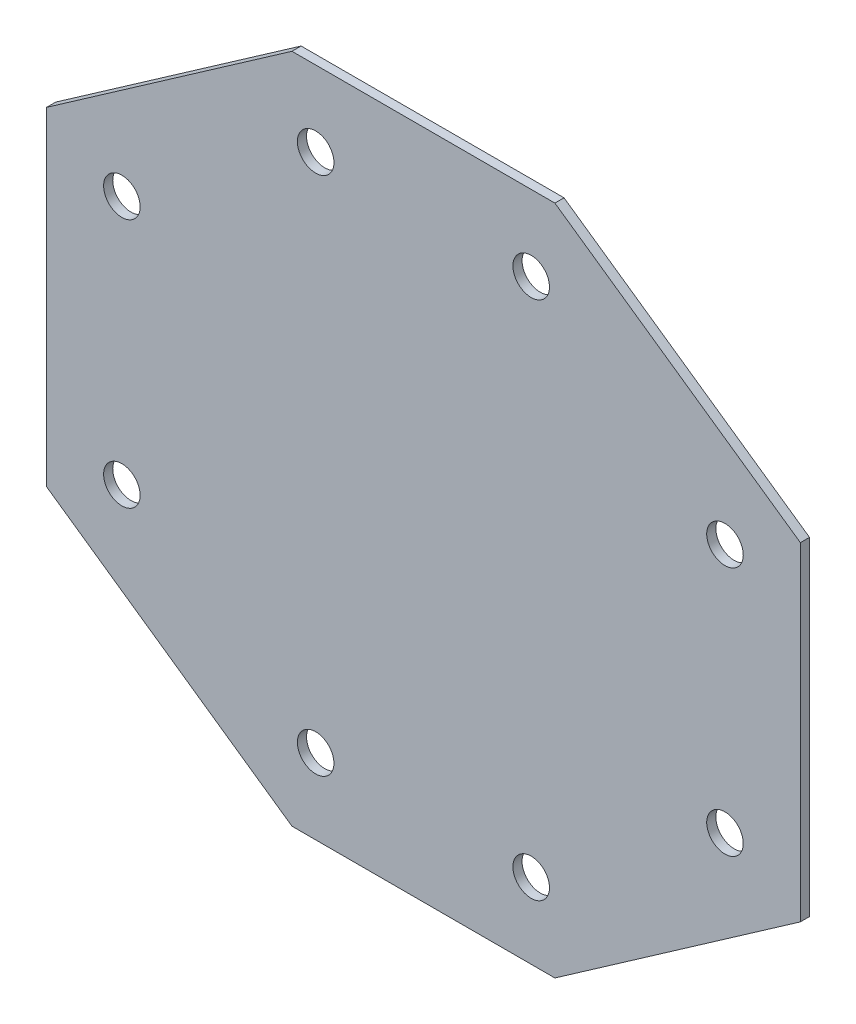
ISO-10303-21;
HEADER;
FILE_DESCRIPTION(('STEP AP214'),'2;1');
FILE_NAME('part.step','',(''),(''),'','','');
FILE_SCHEMA(('AUTOMOTIVE_DESIGN { 1 0 10303 214 1 1 1 1 }'));
ENDSEC;
DATA;
#1=APPLICATION_CONTEXT('core data for automotive mechanical design processes');
#2=APPLICATION_PROTOCOL_DEFINITION('international standard','automotive_design',2000,#1);
#3=PRODUCT_CONTEXT('',#1,'mechanical');
#4=PRODUCT('Part','Part','',(#3));
#5=PRODUCT_RELATED_PRODUCT_CATEGORY('part','',(#4));
#6=PRODUCT_DEFINITION_FORMATION('','',#4);
#7=PRODUCT_DEFINITION_CONTEXT('part definition',#1,'design');
#8=PRODUCT_DEFINITION('design','',#6,#7);
#9=PRODUCT_DEFINITION_SHAPE('','',#8);
#10=(LENGTH_UNIT() NAMED_UNIT(*) SI_UNIT(.MILLI.,.METRE.));
#11=(NAMED_UNIT(*) PLANE_ANGLE_UNIT() SI_UNIT($,.RADIAN.));
#12=(NAMED_UNIT(*) SI_UNIT($,.STERADIAN.) SOLID_ANGLE_UNIT());
#13=UNCERTAINTY_MEASURE_WITH_UNIT(LENGTH_MEASURE(1.E-05),#10,'distance_accuracy_value','');
#14=(GEOMETRIC_REPRESENTATION_CONTEXT(3) GLOBAL_UNCERTAINTY_ASSIGNED_CONTEXT((#13)) GLOBAL_UNIT_ASSIGNED_CONTEXT((#10,
#11,#12)) REPRESENTATION_CONTEXT('',''));
#15=CARTESIAN_POINT('',(0.,0.,0.));
#16=DIRECTION('',(0.,0.,1.));
#17=DIRECTION('',(1.,0.,0.));
#18=AXIS2_PLACEMENT_3D('',#15,#16,#17);
#19=CARTESIAN_POINT('',(0.,0.,0.));
#20=DIRECTION('',(0.,0.,-1.));
#21=DIRECTION('',(-1.,0.,0.));
#22=AXIS2_PLACEMENT_3D('',#19,#20,#21);
#23=PLANE('',#22);
#24=CARTESIAN_POINT('',(175.158610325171,-361.549268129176,0.));
#25=CARTESIAN_POINT('',(175.158645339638,-361.133192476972,0.));
#26=CARTESIAN_POINT('',(175.148484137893,-360.717111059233,0.));
#27=CARTESIAN_POINT('',(175.107777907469,-359.886932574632,0.));
#28=CARTESIAN_POINT('',(175.077281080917,-359.472833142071,0.));
#29=CARTESIAN_POINT('',(174.995910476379,-358.646617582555,0.));
#30=CARTESIAN_POINT('',(174.945035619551,-358.234501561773,0.));
#31=CARTESIAN_POINT('',(174.82297368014,-357.412250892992,0.));
#32=CARTESIAN_POINT('',(174.751736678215,-357.002123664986,0.));
#33=CARTESIAN_POINT('',(174.589395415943,-356.185920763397,0.));
#34=CARTESIAN_POINT('',(174.498295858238,-355.779844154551,0.));
#35=CARTESIAN_POINT('',(174.296449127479,-354.973597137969,0.));
#36=CARTESIAN_POINT('',(174.185747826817,-354.573415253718,0.));
#37=CARTESIAN_POINT('',(173.944748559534,-353.778950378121,0.));
#38=CARTESIAN_POINT('',(173.81444851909,-353.384668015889,0.));
#39=CARTESIAN_POINT('',(173.53430367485,-352.601988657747,0.));
#40=CARTESIAN_POINT('',(173.384410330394,-352.213609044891,0.));
#41=CARTESIAN_POINT('',(173.065940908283,-351.444730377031,0.));
#42=CARTESIAN_POINT('',(172.897370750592,-351.064228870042,0.));
#43=CARTESIAN_POINT('',(172.542111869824,-350.312851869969,0.));
#44=CARTESIAN_POINT('',(172.355465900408,-349.941956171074,0.));
#45=CARTESIAN_POINT('',(171.964104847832,-349.209773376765,0.));
#46=CARTESIAN_POINT('',(171.759387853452,-348.84848730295,0.));
#47=CARTESIAN_POINT('',(171.331932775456,-348.135500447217,0.));
#48=CARTESIAN_POINT('',(171.109150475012,-347.783826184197,0.));
#49=CARTESIAN_POINT('',(170.646799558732,-347.091851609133,0.));
#50=CARTESIAN_POINT('',(170.407236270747,-346.751547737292,0.));
#51=CARTESIAN_POINT('',(169.912217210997,-346.083915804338,0.));
#52=CARTESIAN_POINT('',(169.656799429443,-345.756559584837,0.));
#53=CARTESIAN_POINT('',(169.130116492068,-345.114796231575,0.));
#54=CARTESIAN_POINT('',(168.858849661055,-344.800390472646,0.));
#55=CARTESIAN_POINT('',(168.300511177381,-344.184495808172,0.));
#56=CARTESIAN_POINT('',(168.013401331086,-343.883041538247,0.));
#57=CARTESIAN_POINT('',(167.424936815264,-343.294563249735,0.));
#58=CARTESIAN_POINT('',(167.123586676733,-343.007534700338,0.));
#59=CARTESIAN_POINT('',(166.507830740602,-342.449304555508,0.));
#60=CARTESIAN_POINT('',(166.193456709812,-342.178067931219,0.));
#61=CARTESIAN_POINT('',(165.551692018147,-341.651386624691,0.));
#62=CARTESIAN_POINT('',(165.224299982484,-341.39594361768,0.));
#63=CARTESIAN_POINT('',(164.556534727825,-340.900809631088,0.));
#64=CARTESIAN_POINT('',(164.216130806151,-340.661160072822,0.));
#65=CARTESIAN_POINT('',(163.52416705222,-340.198792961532,0.));
#66=CARTESIAN_POINT('',(163.17261077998,-339.976070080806,0.));
#67=CARTESIAN_POINT('',(162.459781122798,-339.548694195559,0.));
#68=CARTESIAN_POINT('',(162.098532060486,-339.344000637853,0.));
#69=CARTESIAN_POINT('',(161.366348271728,-338.952641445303,0.));
#70=CARTESIAN_POINT('',(160.995412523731,-338.765977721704,0.));
#71=CARTESIAN_POINT('',(160.243882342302,-338.410632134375,0.));
#72=CARTESIAN_POINT('',(159.863265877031,-338.241996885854,0.));
#73=CARTESIAN_POINT('',(159.094394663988,-337.923509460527,0.));
#74=CARTESIAN_POINT('',(158.706142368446,-337.773651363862,0.));
#75=CARTESIAN_POINT('',(157.923632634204,-337.493553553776,0.));
#76=CARTESIAN_POINT('',(157.52939113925,-337.363269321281,0.));
#77=CARTESIAN_POINT('',(156.734925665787,-337.122271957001,0.));
#78=CARTESIAN_POINT('',(156.334701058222,-337.011560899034,0.));
#79=CARTESIAN_POINT('',(155.528286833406,-336.809659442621,0.));
#80=CARTESIAN_POINT('',(155.122084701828,-336.718519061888,0.));
#81=CARTESIAN_POINT('',(154.305853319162,-336.556150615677,0.));
#82=CARTESIAN_POINT('',(153.895825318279,-336.484916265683,0.));
#83=CARTESIAN_POINT('',(153.073706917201,-336.362860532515,0.));
#84=CARTESIAN_POINT('',(152.661623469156,-336.311992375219,0.));
#85=CARTESIAN_POINT('',(151.835407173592,-336.230618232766,0.));
#86=CARTESIAN_POINT('',(151.421274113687,-336.200114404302,0.));
#87=CARTESIAN_POINT('',(150.590965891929,-336.159416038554,0.));
#88=CARTESIAN_POINT('',(150.17478821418,-336.14927299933,0.));
#89=CARTESIAN_POINT('',(149.34256397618,-336.149263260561,0.));
#90=CARTESIAN_POINT('',(148.926517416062,-336.159390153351,0.));
#91=CARTESIAN_POINT('',(148.096383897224,-336.200067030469,0.));
#92=CARTESIAN_POINT('',(147.682294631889,-336.230569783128,0.));
#93=CARTESIAN_POINT('',(146.856078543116,-336.311946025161,0.));
#94=CARTESIAN_POINT('',(146.443951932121,-336.362821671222,0.));
#95=CARTESIAN_POINT('',(145.621657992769,-336.48489041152,0.));
#96=CARTESIAN_POINT('',(145.211498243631,-336.556134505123,0.));
#97=CARTESIAN_POINT('',(144.395263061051,-336.71848384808,0.));
#98=CARTESIAN_POINT('',(143.989186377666,-336.809582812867,0.));
#99=CARTESIAN_POINT('',(143.182939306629,-337.011429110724,0.));
#100=CARTESIAN_POINT('',(142.782757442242,-337.122130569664,0.));
#101=CARTESIAN_POINT('',(141.988292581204,-337.363129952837,0.));
#102=CARTESIAN_POINT('',(141.594010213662,-337.493429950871,0.));
#103=CARTESIAN_POINT('',(140.81133085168,-337.773574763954,0.));
#104=CARTESIAN_POINT('',(140.42295124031,-337.923468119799,0.));
#105=CARTESIAN_POINT('',(139.654072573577,-338.241937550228,0.));
#106=CARTESIAN_POINT('',(139.273571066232,-338.410507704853,0.));
#107=CARTESIAN_POINT('',(138.522194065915,-338.765766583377,0.));
#108=CARTESIAN_POINT('',(138.151298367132,-338.952412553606,0.));
#109=CARTESIAN_POINT('',(137.419115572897,-339.343773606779,0.));
#110=CARTESIAN_POINT('',(137.057829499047,-339.548490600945,0.));
#111=CARTESIAN_POINT('',(136.344842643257,-339.975945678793,0.));
#112=CARTESIAN_POINT('',(135.993168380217,-340.198727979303,0.));
#113=CARTESIAN_POINT('',(135.301193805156,-340.661078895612,0.));
#114=CARTESIAN_POINT('',(134.960889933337,-340.900642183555,0.));
#115=CARTESIAN_POINT('',(134.293258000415,-341.39566124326,0.));
#116=CARTESIAN_POINT('',(133.965901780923,-341.65107902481,0.));
#117=CARTESIAN_POINT('',(133.324138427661,-342.177761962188,0.));
#118=CARTESIAN_POINT('',(133.009732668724,-342.449028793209,0.));
#119=CARTESIAN_POINT('',(132.393838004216,-343.007367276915,0.));
#120=CARTESIAN_POINT('',(132.092383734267,-343.294477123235,0.));
#121=CARTESIAN_POINT('',(131.503905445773,-343.882941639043,0.));
#122=CARTESIAN_POINT('',(131.216876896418,-344.184291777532,0.));
#123=CARTESIAN_POINT('',(130.658646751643,-344.800047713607,0.));
#124=CARTESIAN_POINT('',(130.387410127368,-345.114421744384,0.));
#125=CARTESIAN_POINT('',(129.86072882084,-345.756186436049,0.));
#126=CARTESIAN_POINT('',(129.605285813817,-346.083578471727,0.));
#127=CARTESIAN_POINT('',(129.110151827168,-346.751343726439,0.));
#128=CARTESIAN_POINT('',(128.870502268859,-347.091747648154,0.));
#129=CARTESIAN_POINT('',(128.408135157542,-347.783711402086,0.));
#130=CARTESIAN_POINT('',(128.185412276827,-348.135267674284,0.));
#131=CARTESIAN_POINT('',(127.758036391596,-348.848097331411,0.));
#132=CARTESIAN_POINT('',(127.553342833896,-349.20934639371,0.));
#133=CARTESIAN_POINT('',(127.161983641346,-349.941530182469,0.));
#134=CARTESIAN_POINT('',(126.975319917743,-350.31246593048,0.));
#135=CARTESIAN_POINT('',(126.619974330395,-351.063996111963,0.));
#136=CARTESIAN_POINT('',(126.451339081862,-351.444612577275,0.));
#137=CARTESIAN_POINT('',(126.132851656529,-352.213483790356,0.));
#138=CARTESIAN_POINT('',(125.982993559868,-352.601736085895,0.));
#139=CARTESIAN_POINT('',(125.702895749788,-353.384245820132,0.));
#140=CARTESIAN_POINT('',(125.572611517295,-353.778487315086,0.));
#141=CARTESIAN_POINT('',(125.331614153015,-354.572952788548,0.));
#142=CARTESIAN_POINT('',(125.220903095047,-354.973177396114,0.));
#143=CARTESIAN_POINT('',(125.019001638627,-355.779591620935,0.));
#144=CARTESIAN_POINT('',(124.927861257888,-356.185793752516,0.));
#145=CARTESIAN_POINT('',(124.765492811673,-357.002025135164,0.));
#146=CARTESIAN_POINT('',(124.694258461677,-357.412053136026,0.));
#147=CARTESIAN_POINT('',(124.572202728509,-358.234171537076,0.));
#148=CARTESIAN_POINT('',(124.521334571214,-358.646254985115,0.));
#149=CARTESIAN_POINT('',(124.439960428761,-359.472471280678,0.));
#150=CARTESIAN_POINT('',(124.409456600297,-359.88660434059,0.));
#151=CARTESIAN_POINT('',(124.368758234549,-360.716912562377,0.));
#152=CARTESIAN_POINT('',(124.358615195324,-361.133090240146,0.));
#153=CARTESIAN_POINT('',(124.358605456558,-361.965314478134,0.));
#154=CARTESIAN_POINT('',(124.368732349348,-362.381361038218,0.));
#155=CARTESIAN_POINT('',(124.409409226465,-363.211494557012,0.));
#156=CARTESIAN_POINT('',(124.439911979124,-363.625583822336,0.));
#157=CARTESIAN_POINT('',(124.521288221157,-364.451799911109,0.));
#158=CARTESIAN_POINT('',(124.572163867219,-364.863926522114,0.));
#159=CARTESIAN_POINT('',(124.694232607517,-365.686220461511,0.));
#160=CARTESIAN_POINT('',(124.765476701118,-366.096380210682,0.));
#161=CARTESIAN_POINT('',(124.927826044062,-366.912615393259,0.));
#162=CARTESIAN_POINT('',(125.018925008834,-367.318692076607,0.));
#163=CARTESIAN_POINT('',(125.22077130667,-368.124939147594,0.));
#164=CARTESIAN_POINT('',(125.331472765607,-368.525121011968,0.));
#165=CARTESIAN_POINT('',(125.572472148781,-369.319585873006,0.));
#166=CARTESIAN_POINT('',(125.702772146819,-369.713868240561,0.));
#167=CARTESIAN_POINT('',(125.982916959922,-370.496547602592,0.));
#168=CARTESIAN_POINT('',(126.13281031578,-370.884927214,0.));
#169=CARTESIAN_POINT('',(126.451279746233,-371.653805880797,0.));
#170=CARTESIAN_POINT('',(126.619849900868,-372.034307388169,0.));
#171=CARTESIAN_POINT('',(126.975108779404,-372.785684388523,0.));
#172=CARTESIAN_POINT('',(127.161754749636,-373.156580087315,0.));
#173=CARTESIAN_POINT('',(127.553115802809,-373.888762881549,0.));
#174=CARTESIAN_POINT('',(127.757832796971,-374.250048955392,0.));
#175=CARTESIAN_POINT('',(128.185287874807,-374.963035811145,0.));
#176=CARTESIAN_POINT('',(128.408070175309,-375.314710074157,0.));
#177=CARTESIAN_POINT('',(128.870421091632,-376.006684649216,0.));
#178=CARTESIAN_POINT('',(129.109984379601,-376.346988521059,0.));
#179=CARTESIAN_POINT('',(129.60500343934,-377.014620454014,0.));
#180=CARTESIAN_POINT('',(129.860421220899,-377.341976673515,0.));
#181=CARTESIAN_POINT('',(130.387104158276,-377.983740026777,0.));
#182=CARTESIAN_POINT('',(130.658370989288,-378.298145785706,0.));
#183=CARTESIAN_POINT('',(131.216709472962,-378.91404045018,0.));
#184=CARTESIAN_POINT('',(131.503819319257,-379.215494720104,0.));
#185=CARTESIAN_POINT('',(132.092283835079,-379.803973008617,0.));
#186=CARTESIAN_POINT('',(132.393633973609,-380.091001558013,0.));
#187=CARTESIAN_POINT('',(133.009389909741,-380.649231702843,0.));
#188=CARTESIAN_POINT('',(133.323763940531,-380.920468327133,0.));
#189=CARTESIAN_POINT('',(133.965528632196,-381.447149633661,0.));
#190=CARTESIAN_POINT('',(134.292920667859,-381.702592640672,0.));
#191=CARTESIAN_POINT('',(134.960685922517,-382.197726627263,0.));
#192=CARTESIAN_POINT('',(135.301089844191,-382.43737618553,0.));
#193=CARTESIAN_POINT('',(135.993053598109,-382.89974329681,0.));
#194=CARTESIAN_POINT('',(136.344609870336,-383.122466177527,0.));
#195=CARTESIAN_POINT('',(137.0574395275,-383.549842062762,0.));
#196=CARTESIAN_POINT('',(137.418688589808,-383.754535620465,0.));
#197=CARTESIAN_POINT('',(138.150872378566,-384.145894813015,0.));
#198=CARTESIAN_POINT('',(138.521808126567,-384.332558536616,0.));
#199=CARTESIAN_POINT('',(139.273338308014,-384.687904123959,0.));
#200=CARTESIAN_POINT('',(139.653954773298,-384.856539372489,0.));
#201=CARTESIAN_POINT('',(140.422825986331,-385.175026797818,0.));
#202=CARTESIAN_POINT('',(140.81107828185,-385.324884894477,0.));
#203=CARTESIAN_POINT('',(141.593588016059,-385.604982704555,0.));
#204=CARTESIAN_POINT('',(141.987829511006,-385.735266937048,0.));
#205=CARTESIAN_POINT('',(142.782294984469,-385.976264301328,0.));
#206=CARTESIAN_POINT('',(143.182519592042,-386.086975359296,0.));
#207=CARTESIAN_POINT('',(143.988933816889,-386.288876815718,0.));
#208=CARTESIAN_POINT('',(144.395135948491,-386.380017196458,0.));
#209=CARTESIAN_POINT('',(145.211367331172,-386.542385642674,0.));
#210=CARTESIAN_POINT('',(145.621395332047,-386.613619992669,0.));
#211=CARTESIAN_POINT('',(146.443513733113,-386.735675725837,0.));
#212=CARTESIAN_POINT('',(146.855597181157,-386.786543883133,0.));
#213=CARTESIAN_POINT('',(147.68181347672,-386.867918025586,0.));
#214=CARTESIAN_POINT('',(148.095946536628,-386.89842185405,0.));
#215=CARTESIAN_POINT('',(148.926254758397,-386.939120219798,0.));
#216=CARTESIAN_POINT('',(149.342432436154,-386.949263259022,0.));
#217=CARTESIAN_POINT('',(150.174656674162,-386.94927299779,0.));
#218=CARTESIAN_POINT('',(150.59070323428,-386.939146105,0.));
#219=CARTESIAN_POINT('',(151.420836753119,-386.898469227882,0.));
#220=CARTESIAN_POINT('',(151.834926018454,-386.867966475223,0.));
#221=CARTESIAN_POINT('',(152.661142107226,-386.786590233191,0.));
#222=CARTESIAN_POINT('',(153.073268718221,-386.73571458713,0.));
#223=CARTESIAN_POINT('',(153.895562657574,-386.613645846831,0.));
#224=CARTESIAN_POINT('',(154.305722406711,-386.542401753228,0.));
#225=CARTESIAN_POINT('',(155.121957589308,-386.380052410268,0.));
#226=CARTESIAN_POINT('',(155.528034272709,-386.288953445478,0.));
#227=CARTESIAN_POINT('',(156.334281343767,-386.087107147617,0.));
#228=CARTESIAN_POINT('',(156.734463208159,-385.976405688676,0.));
#229=CARTESIAN_POINT('',(157.528928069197,-385.735406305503,0.));
#230=CARTESIAN_POINT('',(157.923210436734,-385.605106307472,0.));
#231=CARTESIAN_POINT('',(158.705889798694,-385.324961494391,0.));
#232=CARTESIAN_POINT('',(159.094269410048,-385.175068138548,0.));
#233=CARTESIAN_POINT('',(159.863148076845,-384.856598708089,0.));
#234=CARTESIAN_POINT('',(160.243649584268,-384.688028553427,0.));
#235=CARTESIAN_POINT('',(160.99502658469,-384.332769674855,0.));
#236=CARTESIAN_POINT('',(161.365922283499,-384.146123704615,0.));
#237=CARTESIAN_POINT('',(162.098105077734,-383.754762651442,0.));
#238=CARTESIAN_POINT('',(162.45939115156,-383.550045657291,0.));
#239=CARTESIAN_POINT('',(163.172378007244,-383.122590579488,0.));
#240=CARTESIAN_POINT('',(163.524052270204,-382.899808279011,0.));
#241=CARTESIAN_POINT('',(164.216026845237,-382.437457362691,0.));
#242=CARTESIAN_POINT('',(164.556330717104,-382.197894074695,0.));
#243=CARTESIAN_POINT('',(165.223962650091,-381.702875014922,0.));
#244=CARTESIAN_POINT('',(165.551318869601,-381.447457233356,0.));
#245=CARTESIAN_POINT('',(166.193082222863,-380.920774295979,0.));
#246=CARTESIAN_POINT('',(166.507487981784,-380.649507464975,0.));
#247=CARTESIAN_POINT('',(167.123382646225,-380.091168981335,0.));
#248=CARTESIAN_POINT('',(167.424836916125,-379.804059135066,0.));
#249=CARTESIAN_POINT('',(168.013315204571,-379.215594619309,0.));
#250=CARTESIAN_POINT('',(168.300343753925,-378.91424448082,0.));
#251=CARTESIAN_POINT('',(168.858573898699,-378.298488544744,0.));
#252=CARTESIAN_POINT('',(169.129810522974,-377.984114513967,0.));
#253=CARTESIAN_POINT('',(169.656491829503,-377.342349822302,0.));
#254=CARTESIAN_POINT('',(169.911934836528,-377.014957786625,0.));
#255=CARTESIAN_POINT('',(170.407068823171,-376.347192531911,0.));
#256=CARTESIAN_POINT('',(170.646718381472,-376.006788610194,0.));
#257=CARTESIAN_POINT('',(171.109085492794,-375.314824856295,0.));
#258=CARTESIAN_POINT('',(171.331808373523,-374.963268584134,0.));
#259=CARTESIAN_POINT('',(171.759184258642,-374.250438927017,0.));
#260=CARTESIAN_POINT('',(171.963877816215,-373.889189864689,0.));
#261=CARTESIAN_POINT('',(172.355237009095,-373.157006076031,0.));
#262=CARTESIAN_POINT('',(172.541900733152,-372.786070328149,0.));
#263=CARTESIAN_POINT('',(172.897246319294,-372.034540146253,0.));
#264=CARTESIAN_POINT('',(173.065881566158,-371.653923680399,0.));
#265=CARTESIAN_POINT('',(173.384368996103,-370.885052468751,0.));
#266=CARTESIAN_POINT('',(173.534227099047,-370.49680017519,0.));
#267=CARTESIAN_POINT('',(173.814324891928,-369.714290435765,0.));
#268=CARTESIAN_POINT('',(173.944609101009,-369.320048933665,0.));
#269=CARTESIAN_POINT('',(174.185606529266,-368.52558347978,0.));
#270=CARTESIAN_POINT('',(174.296317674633,-368.125358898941,0.));
#271=CARTESIAN_POINT('',(174.498218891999,-367.318944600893,0.));
#272=CARTESIAN_POINT('',(174.589358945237,-366.912742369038,0.));
#273=CARTESIAN_POINT('',(174.751734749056,-366.09647876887,0.));
#274=CARTESIAN_POINT('',(174.822975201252,-365.686418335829,0.));
#275=CARTESIAN_POINT('',(174.945040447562,-364.8642563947,0.));
#276=CARTESIAN_POINT('',(174.995913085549,-364.452161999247,0.));
#277=CARTESIAN_POINT('',(175.077282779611,-363.62594614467,0.));
#278=CARTESIAN_POINT('',(175.107778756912,-363.211824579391,0.));
#279=CARTESIAN_POINT('',(175.148485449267,-362.381557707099,0.));
#280=CARTESIAN_POINT('',(175.158645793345,-361.965409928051,0.));
#281=CARTESIAN_POINT('',(175.158610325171,-361.549268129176,0.));
#282=B_SPLINE_CURVE_WITH_KNOTS('',3,(#24,#25,#26,#27,#28,#29,#30,#31,#32,#33,#34,#35,#36,#37,
#38,#39,#40,#41,#42,#43,#44,#45,#46,#47,#48,#49,#50,#51,#52,#53,#54,#55,#56,#57,#58,#59,#60,#61,
#62,#63,#64,#65,#66,#67,#68,#69,#70,#71,#72,#73,#74,#75,#76,#77,#78,#79,#80,#81,#82,#83,#84,#85,
#86,#87,#88,#89,#90,#91,#92,#93,#94,#95,#96,#97,#98,#99,#100,#101,#102,#103,#104,#105,#106,#107,
#108,#109,#110,#111,#112,#113,#114,#115,#116,#117,#118,#119,#120,#121,#122,#123,#124,#125,#126,
#127,#128,#129,#130,#131,#132,#133,#134,#135,#136,#137,#138,#139,#140,#141,#142,#143,#144,#145,
#146,#147,#148,#149,#150,#151,#152,#153,#154,#155,#156,#157,#158,#159,#160,#161,#162,#163,#164,
#165,#166,#167,#168,#169,#170,#171,#172,#173,#174,#175,#176,#177,#178,#179,#180,#181,#182,#183,
#184,#185,#186,#187,#188,#189,#190,#191,#192,#193,#194,#195,#196,#197,#198,#199,#200,#201,#202,
#203,#204,#205,#206,#207,#208,#209,#210,#211,#212,#213,#214,#215,#216,#217,#218,#219,#220,#221,
#222,#223,#224,#225,#226,#227,#228,#229,#230,#231,#232,#233,#234,#235,#236,#237,#238,#239,#240,
#241,#242,#243,#244,#245,#246,#247,#248,#249,#250,#251,#252,#253,#254,#255,#256,#257,#258,#259,
#260,#261,#262,#263,#264,#265,#266,#267,#268,#269,#270,#271,#272,#273,#274,#275,#276,#277,#278,
#279,#280,#281),.UNSPECIFIED.,.F.,.F.,(4,2,2,2,2,2,2,2,2,2,2,2,2,2,2,2,2,2,2,2,2,2,2,2,2,2,2,2,
2,2,2,2,2,2,2,2,2,2,2,2,2,2,2,2,2,2,2,2,2,2,2,2,2,2,2,2,2,2,2,2,2,2,2,2,2,2,2,2,2,2,2,2,2,2,2,2,
2,2,2,2,2,2,2,2,2,2,2,2,2,2,2,2,2,2,2,2,2,2,2,2,2,2,2,2,2,2,2,2,2,2,2,2,2,2,2,2,2,2,2,2,2,2,2,2,
2,2,2,2,4),(0.,1.24810990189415,2.49327183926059,3.73849970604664,4.98680691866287,
6.23481890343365,7.47994796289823,8.72520886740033,9.97361543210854,11.221627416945,
12.466756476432,13.7120173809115,14.9604239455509,16.2084359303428,17.4535649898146,
18.6988258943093,19.9472324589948,21.1952444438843,22.4403735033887,23.6856344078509,
24.9340409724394,26.1820529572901,27.4271820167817,28.6724429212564,29.9208494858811,
31.1688614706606,32.4139905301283,33.6592514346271,34.9076579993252,36.1556699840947,
37.4007990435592,38.6460599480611,39.8944665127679,41.1424784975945,42.3876075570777,
43.6328684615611,44.881275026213,46.1292870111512,47.3744160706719,48.6196769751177,
49.8680835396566,51.1160955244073,52.3612245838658,53.6064854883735,54.8548920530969,
56.1029040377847,57.3480330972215,58.5932940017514,59.8417005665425,61.0897125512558,
62.3348416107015,63.5801025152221,64.8285090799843,66.07652106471,67.3216501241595,
68.5669110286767,69.8153175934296,71.0633295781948,72.3084586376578,73.5537195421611,
74.8021261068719,76.05013809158,77.2952671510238,78.5405280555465,79.7889346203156,
81.0369466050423,82.2820756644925,83.5273365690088,84.7757431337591,86.0237551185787,
87.2688841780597,88.5141450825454,89.762551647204,91.0105636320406,92.2556926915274,
93.5009535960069,94.7493601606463,95.9973721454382,97.24250120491,98.4877621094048,
99.7361686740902,100.98418065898,102.229309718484,103.474570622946,104.722977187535,
105.970989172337,107.216118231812,108.461379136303,109.709785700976,110.957797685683,
112.202926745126,113.448187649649,114.69659421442,115.944606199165,117.189735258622,
118.434996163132,119.683402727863,120.93141471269,122.176543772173,123.421804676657,
124.670211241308,125.918223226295,127.163352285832,128.408613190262,129.657019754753,
130.905031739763,132.150160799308,133.395421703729,134.643828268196,135.891840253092,
137.136969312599,138.382230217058,139.630636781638,140.878648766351,142.123777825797,
143.369038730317,144.61744529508,145.865457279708,147.110586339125,148.355847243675,
149.604253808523,150.85226579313,152.097394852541,153.342655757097,154.591062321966,
155.839173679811,157.084335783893,158.329563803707,159.577872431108),.UNSPECIFIED.);
#283=CARTESIAN_POINT('',(175.158610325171,-361.549268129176,0.));
#284=VERTEX_POINT('',#283);
#285=EDGE_CURVE('E236',#284,#284,#282,.T.);
#286=ORIENTED_EDGE('',*,*,#285,.T.);
#287=EDGE_LOOP('',(#286));
#288=FACE_BOUND('',#287,.T.);
#289=CARTESIAN_POINT('',(444.480268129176,173.588730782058,0.));
#290=CARTESIAN_POINT('',(444.480303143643,174.004806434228,0.));
#291=CARTESIAN_POINT('',(444.470141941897,174.420887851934,0.));
#292=CARTESIAN_POINT('',(444.429435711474,175.25106633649,0.));
#293=CARTESIAN_POINT('',(444.398938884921,175.66516576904,0.));
#294=CARTESIAN_POINT('',(444.317568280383,176.491381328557,0.));
#295=CARTESIAN_POINT('',(444.266693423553,176.90349734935,0.));
#296=CARTESIAN_POINT('',(444.144631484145,177.725748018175,0.));
#297=CARTESIAN_POINT('',(444.073394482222,178.135875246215,0.));
#298=CARTESIAN_POINT('',(443.911053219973,178.952078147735,0.));
#299=CARTESIAN_POINT('',(443.819953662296,179.358154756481,0.));
#300=CARTESIAN_POINT('',(443.618106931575,180.164401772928,0.));
#301=CARTESIAN_POINT('',(443.507405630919,180.564583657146,0.));
#302=CARTESIAN_POINT('',(443.266406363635,181.359048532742,0.));
#303=CARTESIAN_POINT('',(443.136106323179,181.753330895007,0.));
#304=CARTESIAN_POINT('',(442.855961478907,182.536010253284,0.));
#305=CARTESIAN_POINT('',(442.706068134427,182.924389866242,0.));
#306=CARTESIAN_POINT('',(442.387598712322,183.693268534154,0.));
#307=CARTESIAN_POINT('',(442.21902855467,184.073770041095,0.));
#308=CARTESIAN_POINT('',(441.863769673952,184.825147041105,0.));
#309=CARTESIAN_POINT('',(441.677123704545,185.196042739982,0.));
#310=CARTESIAN_POINT('',(441.285762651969,185.928225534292,0.));
#311=CARTESIAN_POINT('',(441.081045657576,186.289511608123,0.));
#312=CARTESIAN_POINT('',(440.653590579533,187.002498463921,0.));
#313=CARTESIAN_POINT('',(440.430808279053,187.354172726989,0.));
#314=CARTESIAN_POINT('',(439.968457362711,188.046147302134,0.));
#315=CARTESIAN_POINT('',(439.728894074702,188.386451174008,0.));
#316=CARTESIAN_POINT('',(439.233875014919,189.054083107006,0.));
#317=CARTESIAN_POINT('',(438.978457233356,189.381439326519,0.));
#318=CARTESIAN_POINT('',(438.451774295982,190.023202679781,0.));
#319=CARTESIAN_POINT('',(438.180507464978,190.3376084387,0.));
#320=CARTESIAN_POINT('',(437.622168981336,190.953503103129,0.));
#321=CARTESIAN_POINT('',(437.335059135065,191.254957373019,0.));
#322=CARTESIAN_POINT('',(436.746594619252,191.843435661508,0.));
#323=CARTESIAN_POINT('',(436.445244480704,192.130464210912,0.));
#324=CARTESIAN_POINT('',(435.829488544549,192.688694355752,0.));
#325=CARTESIAN_POINT('',(435.515114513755,192.959930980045,0.));
#326=CARTESIAN_POINT('',(434.87334982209,193.486612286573,0.));
#327=CARTESIAN_POINT('',(434.545957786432,193.742055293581,0.));
#328=CARTESIAN_POINT('',(433.878192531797,194.237189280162,0.));
#329=CARTESIAN_POINT('',(433.53778861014,194.476838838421,0.));
#330=CARTESIAN_POINT('',(432.845824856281,194.939205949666,0.));
#331=CARTESIAN_POINT('',(432.494268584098,195.161928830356,0.));
#332=CARTESIAN_POINT('',(431.781438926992,195.589304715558,0.));
#333=CARTESIAN_POINT('',(431.420189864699,195.793998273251,0.));
#334=CARTESIAN_POINT('',(430.68800607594,196.1853574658,0.));
#335=CARTESIAN_POINT('',(430.317070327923,196.372021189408,0.));
#336=CARTESIAN_POINT('',(429.56554014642,196.727366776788,0.));
#337=CARTESIAN_POINT('',(429.184923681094,196.896002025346,0.));
#338=CARTESIAN_POINT('',(428.416052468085,197.214489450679,0.));
#339=CARTESIAN_POINT('',(428.027800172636,197.364347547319,0.));
#340=CARTESIAN_POINT('',(427.24529043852,197.644445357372,0.));
#341=CARTESIAN_POINT('',(426.851048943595,197.774729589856,0.));
#342=CARTESIAN_POINT('',(426.056583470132,198.015726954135,0.));
#343=CARTESIAN_POINT('',(425.656358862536,198.126438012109,0.));
#344=CARTESIAN_POINT('',(424.849944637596,198.328339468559,0.));
#345=CARTESIAN_POINT('',(424.443742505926,198.419479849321,0.));
#346=CARTESIAN_POINT('',(423.627511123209,198.581848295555,0.));
#347=CARTESIAN_POINT('',(423.217483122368,198.653082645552,0.));
#348=CARTESIAN_POINT('',(422.395364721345,198.775138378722,0.));
#349=CARTESIAN_POINT('',(421.983281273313,198.826006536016,0.));
#350=CARTESIAN_POINT('',(421.15706497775,198.907380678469,0.));
#351=CARTESIAN_POINT('',(420.742931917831,198.937884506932,0.));
#352=CARTESIAN_POINT('',(419.912623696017,198.978582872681,0.));
#353=CARTESIAN_POINT('',(419.496446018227,198.988725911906,0.));
#354=CARTESIAN_POINT('',(418.66422178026,198.988735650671,0.));
#355=CARTESIAN_POINT('',(418.248175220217,198.978608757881,0.));
#356=CARTESIAN_POINT('',(417.418041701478,198.937931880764,0.));
#357=CARTESIAN_POINT('',(417.003952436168,198.907429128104,0.));
#358=CARTESIAN_POINT('',(416.177736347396,198.82605288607,0.));
#359=CARTESIAN_POINT('',(415.765609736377,198.775177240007,0.));
#360=CARTESIAN_POINT('',(414.943315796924,198.653108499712,0.));
#361=CARTESIAN_POINT('',(414.533156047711,198.581864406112,0.));
#362=CARTESIAN_POINT('',(413.71692086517,198.41951506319,0.));
#363=CARTESIAN_POINT('',(413.310844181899,198.328416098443,0.));
#364=CARTESIAN_POINT('',(412.504597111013,198.12656980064,0.));
#365=CARTESIAN_POINT('',(412.104415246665,198.015868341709,0.));
#366=CARTESIAN_POINT('',(411.309950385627,197.774868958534,0.));
#367=CARTESIAN_POINT('',(410.915668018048,197.644568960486,0.));
#368=CARTESIAN_POINT('',(410.132988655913,197.364424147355,0.));
#369=CARTESIAN_POINT('',(409.744609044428,197.214530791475,0.));
#370=CARTESIAN_POINT('',(408.975730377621,196.89606136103,0.));
#371=CARTESIAN_POINT('',(408.595228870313,196.727491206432,0.));
#372=CARTESIAN_POINT('',(407.843851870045,196.372232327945,0.));
#373=CARTESIAN_POINT('',(407.472956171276,196.185586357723,0.));
#374=CARTESIAN_POINT('',(406.740773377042,195.794225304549,0.));
#375=CARTESIAN_POINT('',(406.379487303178,195.589508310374,0.));
#376=CARTESIAN_POINT('',(405.666500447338,195.162053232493,0.));
#377=CARTESIAN_POINT('',(405.31482618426,194.939270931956,0.));
#378=CARTESIAN_POINT('',(404.622851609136,194.476920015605,0.));
#379=CARTESIAN_POINT('',(404.282547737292,194.237356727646,0.));
#380=CARTESIAN_POINT('',(403.614915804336,193.742337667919,0.));
#381=CARTESIAN_POINT('',(403.287559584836,193.486919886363,0.));
#382=CARTESIAN_POINT('',(402.645796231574,192.960236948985,0.));
#383=CARTESIAN_POINT('',(402.331390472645,192.68897011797,0.));
#384=CARTESIAN_POINT('',(401.715495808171,192.130631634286,0.));
#385=CARTESIAN_POINT('',(401.414041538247,191.843521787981,0.));
#386=CARTESIAN_POINT('',(400.825563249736,191.255057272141,0.));
#387=CARTESIAN_POINT('',(400.53853470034,190.953707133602,0.));
#388=CARTESIAN_POINT('',(399.98030455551,190.337951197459,0.));
#389=CARTESIAN_POINT('',(399.709067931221,190.023577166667,0.));
#390=CARTESIAN_POINT('',(399.182386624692,189.381812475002,0.));
#391=CARTESIAN_POINT('',(398.926943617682,189.054420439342,0.));
#392=CARTESIAN_POINT('',(398.43180963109,188.386655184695,0.));
#393=CARTESIAN_POINT('',(398.192160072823,188.04625126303,0.));
#394=CARTESIAN_POINT('',(397.729792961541,187.354287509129,0.));
#395=CARTESIAN_POINT('',(397.507070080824,187.002731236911,0.));
#396=CARTESIAN_POINT('',(397.079694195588,186.289901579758,0.));
#397=CARTESIAN_POINT('',(396.875000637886,185.928652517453,0.));
#398=CARTESIAN_POINT('',(396.483641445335,185.196468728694,0.));
#399=CARTESIAN_POINT('',(396.296977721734,184.82553298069,0.));
#400=CARTESIAN_POINT('',(395.941632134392,184.074002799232,0.));
#401=CARTESIAN_POINT('',(395.772996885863,183.69338633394,0.));
#402=CARTESIAN_POINT('',(395.454509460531,182.924515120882,0.));
#403=CARTESIAN_POINT('',(395.304651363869,182.536262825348,0.));
#404=CARTESIAN_POINT('',(395.024553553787,181.753753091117,0.));
#405=CARTESIAN_POINT('',(394.894269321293,181.359511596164,0.));
#406=CARTESIAN_POINT('',(394.653271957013,180.565046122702,0.));
#407=CARTESIAN_POINT('',(394.542560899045,180.164821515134,0.));
#408=CARTESIAN_POINT('',(394.340659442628,179.358407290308,0.));
#409=CARTESIAN_POINT('',(394.249519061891,178.952205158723,0.));
#410=CARTESIAN_POINT('',(394.087150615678,178.135973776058,0.));
#411=CARTESIAN_POINT('',(394.015916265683,177.725945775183,0.));
#412=CARTESIAN_POINT('',(393.893860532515,176.903827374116,0.));
#413=CARTESIAN_POINT('',(393.842992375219,176.491743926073,0.));
#414=CARTESIAN_POINT('',(393.761618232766,175.66552763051,0.));
#415=CARTESIAN_POINT('',(393.731114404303,175.251394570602,0.));
#416=CARTESIAN_POINT('',(393.690416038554,174.421086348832,0.));
#417=CARTESIAN_POINT('',(393.680272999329,174.004908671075,0.));
#418=CARTESIAN_POINT('',(393.680263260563,173.17268443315,0.));
#419=CARTESIAN_POINT('',(393.690390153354,172.756637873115,0.));
#420=CARTESIAN_POINT('',(393.731067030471,171.926504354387,0.));
#421=CARTESIAN_POINT('',(393.761569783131,171.51241508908,0.));
#422=CARTESIAN_POINT('',(393.842946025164,170.686199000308,0.));
#423=CARTESIAN_POINT('',(393.893821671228,170.274072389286,0.));
#424=CARTESIAN_POINT('',(394.015890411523,169.451778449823,0.));
#425=CARTESIAN_POINT('',(394.087134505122,169.041618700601,0.));
#426=CARTESIAN_POINT('',(394.249483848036,168.225383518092,0.));
#427=CARTESIAN_POINT('',(394.340582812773,167.81930683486,0.));
#428=CARTESIAN_POINT('',(394.542429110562,167.013059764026,0.));
#429=CARTESIAN_POINT('',(394.653130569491,166.612877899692,0.));
#430=CARTESIAN_POINT('',(394.894129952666,165.818413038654,0.));
#431=CARTESIAN_POINT('',(395.024429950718,165.424130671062,0.));
#432=CARTESIAN_POINT('',(395.304574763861,164.641451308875,0.));
#433=CARTESIAN_POINT('',(395.454468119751,164.25307169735,0.));
#434=CARTESIAN_POINT('',(395.772937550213,163.484193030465,0.));
#435=CARTESIAN_POINT('',(395.941507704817,163.103691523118,0.));
#436=CARTESIAN_POINT('',(396.296766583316,162.352314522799,0.));
#437=CARTESIAN_POINT('',(396.483412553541,161.981418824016,0.));
#438=CARTESIAN_POINT('',(396.874773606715,161.249236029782,0.));
#439=CARTESIAN_POINT('',(397.079490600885,160.88794995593,0.));
#440=CARTESIAN_POINT('',(397.506945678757,160.174963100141,0.));
#441=CARTESIAN_POINT('',(397.729727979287,159.823288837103,0.));
#442=CARTESIAN_POINT('',(398.192078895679,159.131314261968,0.));
#443=CARTESIAN_POINT('',(398.43164218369,158.791010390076,0.));
#444=CARTESIAN_POINT('',(398.926661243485,158.123378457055,0.));
#445=CARTESIAN_POINT('',(399.182079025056,157.796022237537,0.));
#446=CARTESIAN_POINT('',(399.708761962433,157.154258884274,0.));
#447=CARTESIAN_POINT('',(399.98002879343,156.839853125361,0.));
#448=CARTESIAN_POINT('',(400.53836727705,156.223958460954,0.));
#449=CARTESIAN_POINT('',(400.825477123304,155.92250419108,0.));
#450=CARTESIAN_POINT('',(401.4139416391,155.334025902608,0.));
#451=CARTESIAN_POINT('',(401.715291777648,155.046997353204,0.));
#452=CARTESIAN_POINT('',(402.331047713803,154.488767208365,0.));
#453=CARTESIAN_POINT('',(402.645421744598,154.217530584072,0.));
#454=CARTESIAN_POINT('',(403.287186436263,153.690849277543,0.));
#455=CARTESIAN_POINT('',(403.61457847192,153.435406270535,0.));
#456=CARTESIAN_POINT('',(404.282343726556,152.940272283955,0.));
#457=CARTESIAN_POINT('',(404.622747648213,152.700622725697,0.));
#458=CARTESIAN_POINT('',(405.314711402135,152.238255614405,0.));
#459=CARTESIAN_POINT('',(405.666267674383,152.015532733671,0.));
#460=CARTESIAN_POINT('',(406.379097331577,151.588156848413,0.));
#461=CARTESIAN_POINT('',(406.740346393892,151.383463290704,0.));
#462=CARTESIAN_POINT('',(407.47253018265,150.992104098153,0.));
#463=CARTESIAN_POINT('',(407.843465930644,150.805440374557,0.));
#464=CARTESIAN_POINT('',(408.594996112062,150.450094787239,0.));
#465=CARTESIAN_POINT('',(408.975612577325,150.281459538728,0.));
#466=CARTESIAN_POINT('',(409.744483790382,149.962972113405,0.));
#467=CARTESIAN_POINT('',(410.132736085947,149.813114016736,0.));
#468=CARTESIAN_POINT('',(410.915245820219,149.533016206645,0.));
#469=CARTESIAN_POINT('',(411.30948731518,149.402731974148,0.));
#470=CARTESIAN_POINT('',(412.103952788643,149.161734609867,0.));
#471=CARTESIAN_POINT('',(412.5041773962,149.051023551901,0.));
#472=CARTESIAN_POINT('',(413.310591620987,148.849122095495,0.));
#473=CARTESIAN_POINT('',(413.716793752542,148.757981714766,0.));
#474=CARTESIAN_POINT('',(414.533025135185,148.595613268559,0.));
#475=CARTESIAN_POINT('',(414.943053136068,148.524378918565,0.));
#476=CARTESIAN_POINT('',(415.765171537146,148.402323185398,0.));
#477=CARTESIAN_POINT('',(416.177254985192,148.351455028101,0.));
#478=CARTESIAN_POINT('',(417.003471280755,148.270080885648,0.));
#479=CARTESIAN_POINT('',(417.41760434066,148.239577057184,0.));
#480=CARTESIAN_POINT('',(418.247912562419,148.198878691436,0.));
#481=CARTESIAN_POINT('',(418.664090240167,148.188735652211,0.));
#482=CARTESIAN_POINT('',(419.496314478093,148.188725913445,0.));
#483=CARTESIAN_POINT('',(419.912361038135,148.198852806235,0.));
#484=CARTESIAN_POINT('',(420.742494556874,148.239529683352,0.));
#485=CARTESIAN_POINT('',(421.156583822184,148.270032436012,0.));
#486=CARTESIAN_POINT('',(421.982799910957,148.351408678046,0.));
#487=CARTESIAN_POINT('',(422.394926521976,148.402284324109,0.));
#488=CARTESIAN_POINT('',(423.217220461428,148.524353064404,0.));
#489=CARTESIAN_POINT('',(423.627380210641,148.595597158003,0.));
#490=CARTESIAN_POINT('',(424.44361539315,148.757946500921,0.));
#491=CARTESIAN_POINT('',(424.84969207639,148.849045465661,0.));
#492=CARTESIAN_POINT('',(425.655939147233,149.050891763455,0.));
#493=CARTESIAN_POINT('',(426.056121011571,149.161593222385,0.));
#494=CARTESIAN_POINT('',(426.850585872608,149.40259260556,0.));
#495=CARTESIAN_POINT('',(427.244868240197,149.532892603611,0.));
#496=CARTESIAN_POINT('',(428.027547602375,149.813037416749,0.));
#497=CARTESIAN_POINT('',(428.415927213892,149.962930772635,0.));
#498=CARTESIAN_POINT('',(429.184805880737,150.281400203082,0.));
#499=CARTESIAN_POINT('',(429.565307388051,150.449970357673,0.));
#500=CARTESIAN_POINT('',(430.316684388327,150.805229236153,0.));
#501=CARTESIAN_POINT('',(430.687580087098,150.991875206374,0.));
#502=CARTESIAN_POINT('',(431.419762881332,151.383236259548,0.));
#503=CARTESIAN_POINT('',(431.781048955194,151.587953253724,0.));
#504=CARTESIAN_POINT('',(432.494035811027,152.015408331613,0.));
#505=CARTESIAN_POINT('',(432.845710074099,152.238190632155,0.));
#506=CARTESIAN_POINT('',(433.537684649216,152.70054154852,0.));
#507=CARTESIAN_POINT('',(433.877988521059,152.940104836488,0.));
#508=CARTESIAN_POINT('',(434.545620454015,153.435123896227,0.));
#509=CARTESIAN_POINT('',(434.872976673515,153.690541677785,0.));
#510=CARTESIAN_POINT('',(435.514740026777,154.217224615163,0.));
#511=CARTESIAN_POINT('',(435.829145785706,154.488491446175,0.));
#512=CARTESIAN_POINT('',(436.445040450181,155.046829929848,0.));
#513=CARTESIAN_POINT('',(436.746494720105,155.333939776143,0.));
#514=CARTESIAN_POINT('',(437.3349730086,155.922404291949,0.));
#515=CARTESIAN_POINT('',(437.62200155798,156.223754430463,0.));
#516=CARTESIAN_POINT('',(438.180231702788,156.839510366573,0.));
#517=CARTESIAN_POINT('',(438.451468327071,157.153884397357,0.));
#518=CARTESIAN_POINT('',(438.9781496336,157.795649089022,0.));
#519=CARTESIAN_POINT('',(439.233592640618,158.12304112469,0.));
#520=CARTESIAN_POINT('',(439.728726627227,158.790806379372,0.));
#521=CARTESIAN_POINT('',(439.968376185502,159.131210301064,0.));
#522=CARTESIAN_POINT('',(440.430743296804,159.823174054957,0.));
#523=CARTESIAN_POINT('',(440.653466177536,160.174730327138,0.));
#524=CARTESIAN_POINT('',(441.08084206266,160.887559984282,0.));
#525=CARTESIAN_POINT('',(441.285535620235,161.248809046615,0.));
#526=CARTESIAN_POINT('',(441.676894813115,161.980992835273,0.));
#527=CARTESIAN_POINT('',(441.863558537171,162.351928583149,0.));
#528=CARTESIAN_POINT('',(442.218904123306,163.103458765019,0.));
#529=CARTESIAN_POINT('',(442.387539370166,163.484075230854,0.));
#530=CARTESIAN_POINT('',(442.706026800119,164.252946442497,0.));
#531=CARTESIAN_POINT('',(442.855884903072,164.641198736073,0.));
#532=CARTESIAN_POINT('',(443.135982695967,165.423708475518,0.));
#533=CARTESIAN_POINT('',(443.26626690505,165.817949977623,0.));
#534=CARTESIAN_POINT('',(443.507264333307,166.612415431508,0.));
#535=CARTESIAN_POINT('',(443.617975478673,167.012640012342,0.));
#536=CARTESIAN_POINT('',(443.819876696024,167.81905431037,0.));
#537=CARTESIAN_POINT('',(443.911016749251,168.225256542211,0.));
#538=CARTESIAN_POINT('',(444.073392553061,169.041520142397,0.));
#539=CARTESIAN_POINT('',(444.144633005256,169.451580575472,0.));
#540=CARTESIAN_POINT('',(444.266698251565,170.273742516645,0.));
#541=CARTESIAN_POINT('',(444.317570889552,170.685836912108,0.));
#542=CARTESIAN_POINT('',(444.398940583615,171.512052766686,0.));
#543=CARTESIAN_POINT('',(444.429436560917,171.926174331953,0.));
#544=CARTESIAN_POINT('',(444.470143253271,172.756441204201,0.));
#545=CARTESIAN_POINT('',(444.48030359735,173.172588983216,0.));
#546=CARTESIAN_POINT('',(444.480268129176,173.588730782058,0.));
#547=B_SPLINE_CURVE_WITH_KNOTS('',3,(#289,#290,#291,#292,#293,#294,#295,#296,#297,#298,#299,
#300,#301,#302,#303,#304,#305,#306,#307,#308,#309,#310,#311,#312,#313,#314,#315,#316,#317,#318,
#319,#320,#321,#322,#323,#324,#325,#326,#327,#328,#329,#330,#331,#332,#333,#334,#335,#336,#337,
#338,#339,#340,#341,#342,#343,#344,#345,#346,#347,#348,#349,#350,#351,#352,#353,#354,#355,#356,
#357,#358,#359,#360,#361,#362,#363,#364,#365,#366,#367,#368,#369,#370,#371,#372,#373,#374,#375,
#376,#377,#378,#379,#380,#381,#382,#383,#384,#385,#386,#387,#388,#389,#390,#391,#392,#393,#394,
#395,#396,#397,#398,#399,#400,#401,#402,#403,#404,#405,#406,#407,#408,#409,#410,#411,#412,#413,
#414,#415,#416,#417,#418,#419,#420,#421,#422,#423,#424,#425,#426,#427,#428,#429,#430,#431,#432,
#433,#434,#435,#436,#437,#438,#439,#440,#441,#442,#443,#444,#445,#446,#447,#448,#449,#450,#451,
#452,#453,#454,#455,#456,#457,#458,#459,#460,#461,#462,#463,#464,#465,#466,#467,#468,#469,#470,
#471,#472,#473,#474,#475,#476,#477,#478,#479,#480,#481,#482,#483,#484,#485,#486,#487,#488,#489,
#490,#491,#492,#493,#494,#495,#496,#497,#498,#499,#500,#501,#502,#503,#504,#505,#506,#507,#508,
#509,#510,#511,#512,#513,#514,#515,#516,#517,#518,#519,#520,#521,#522,#523,#524,#525,#526,#527,
#528,#529,#530,#531,#532,#533,#534,#535,#536,#537,#538,#539,#540,#541,#542,#543,#544,#545,#546),
.UNSPECIFIED.,.F.,.F.,(4,2,2,2,2,2,2,2,2,2,2,2,2,2,2,2,2,2,2,2,2,2,2,2,2,2,2,2,2,2,2,2,2,2,2,2,
2,2,2,2,2,2,2,2,2,2,2,2,2,2,2,2,2,2,2,2,2,2,2,2,2,2,2,2,2,2,2,2,2,2,2,2,2,2,2,2,2,2,2,2,2,2,2,2,
2,2,2,2,2,2,2,2,2,2,2,2,2,2,2,2,2,2,2,2,2,2,2,2,2,2,2,2,2,2,2,2,2,2,2,2,2,2,2,2,2,2,2,2,4),(0.,
1.24810990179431,2.49327183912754,3.73849970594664,4.98680691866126,6.23481890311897,
7.47994796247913,8.72520886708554,9.97361543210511,11.2216274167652,12.4667564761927,
13.7120173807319,14.9604239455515,16.2084359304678,17.453564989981,18.6988258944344,
19.9472324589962,21.1952444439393,22.4403735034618,23.6856344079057,24.9340409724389,
26.182052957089,27.4271820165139,28.6724429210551,29.9208494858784,31.1688614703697,
32.413990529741,33.6592514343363,34.9076579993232,36.1556699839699,37.4007990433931,
38.6460599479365,39.8944665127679,41.1424784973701,42.3876075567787,43.6328684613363,
44.8812750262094,46.1292870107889,47.3744160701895,48.6196769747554,49.8680835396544,
51.1160955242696,52.3612245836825,53.6064854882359,54.854892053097,56.1029040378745,
57.3480330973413,58.5932940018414,59.841700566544,61.0897125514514,62.3348416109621,
63.5801025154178,64.828509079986,66.0765210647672,67.3216501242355,68.5669110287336,
69.8153175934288,71.0633295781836,72.308458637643,73.5537195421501,74.8021261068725,
76.0501380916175,77.2952671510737,78.540528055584,79.7889346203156,81.036946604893,
82.2820756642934,83.5273365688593,84.7757431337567,86.0237551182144,87.2688841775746,
88.514145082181,89.7625516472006,91.0105636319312,92.2556926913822,93.5009535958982,
94.7493601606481,95.997372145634,97.2425012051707,98.4877621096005,99.7361686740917,
100.984180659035,102.229309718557,103.474570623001,104.722977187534,105.970989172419,
107.216118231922,108.461379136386,109.709785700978,110.957797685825,112.202926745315,
113.448187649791,114.696594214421,115.94460619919,117.189735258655,118.434996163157,
119.683402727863,120.931414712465,122.176543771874,123.421804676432,124.670211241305,
125.918223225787,127.163352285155,128.408613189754,129.657019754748,130.905031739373,
132.150160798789,133.39542170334,134.643828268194,135.891840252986,137.136969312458,
138.382230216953,139.630636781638,140.878648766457,142.123777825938,143.369038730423,
144.617445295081,145.865457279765,147.110586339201,148.355847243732,149.604253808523,
150.852265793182,152.097394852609,153.342655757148,154.591062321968,155.839173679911,
157.084335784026,158.329563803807,159.577872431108),.UNSPECIFIED.);
#548=CARTESIAN_POINT('',(444.480268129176,173.588730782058,0.));
#549=VERTEX_POINT('',#548);
#550=EDGE_CURVE('E457',#549,#549,#547,.T.);
#551=ORIENTED_EDGE('',*,*,#550,.T.);
#552=EDGE_LOOP('',(#551));
#553=FACE_BOUND('',#552,.T.);
#554=CARTESIAN_POINT('',(-124.358610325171,361.549268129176,0.));
#555=CARTESIAN_POINT('',(-124.358575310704,361.96534378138,0.));
#556=CARTESIAN_POINT('',(-124.36873651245,362.381425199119,0.));
#557=CARTESIAN_POINT('',(-124.409442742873,363.21160368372,0.));
#558=CARTESIAN_POINT('',(-124.439939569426,363.62570311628,0.));
#559=CARTESIAN_POINT('',(-124.521310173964,364.451918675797,0.));
#560=CARTESIAN_POINT('',(-124.572185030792,364.864034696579,0.));
#561=CARTESIAN_POINT('',(-124.694246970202,365.68628536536,0.));
#562=CARTESIAN_POINT('',(-124.765483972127,366.096412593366,0.));
#563=CARTESIAN_POINT('',(-124.927825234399,366.912615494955,0.));
#564=CARTESIAN_POINT('',(-125.018924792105,367.318692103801,0.));
#565=CARTESIAN_POINT('',(-125.220771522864,368.124939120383,0.));
#566=CARTESIAN_POINT('',(-125.331472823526,368.525121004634,0.));
#567=CARTESIAN_POINT('',(-125.572472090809,369.319585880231,0.));
#568=CARTESIAN_POINT('',(-125.702772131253,369.713868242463,0.));
#569=CARTESIAN_POINT('',(-125.982916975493,370.496547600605,0.));
#570=CARTESIAN_POINT('',(-126.132810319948,370.884927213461,0.));
#571=CARTESIAN_POINT('',(-126.45127974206,371.653805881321,0.));
#572=CARTESIAN_POINT('',(-126.619849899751,372.03430738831,0.));
#573=CARTESIAN_POINT('',(-126.975108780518,372.785684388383,0.));
#574=CARTESIAN_POINT('',(-127.161754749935,373.156580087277,0.));
#575=CARTESIAN_POINT('',(-127.55311580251,373.888762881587,0.));
#576=CARTESIAN_POINT('',(-127.757832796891,374.250048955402,0.));
#577=CARTESIAN_POINT('',(-128.185287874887,374.963035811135,0.));
#578=CARTESIAN_POINT('',(-128.40807017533,375.314710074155,0.));
#579=CARTESIAN_POINT('',(-128.870421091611,376.006684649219,0.));
#580=CARTESIAN_POINT('',(-129.109984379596,376.34698852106,0.));
#581=CARTESIAN_POINT('',(-129.605003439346,377.014620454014,0.));
#582=CARTESIAN_POINT('',(-129.8604212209,377.341976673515,0.));
#583=CARTESIAN_POINT('',(-130.387104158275,377.983740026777,0.));
#584=CARTESIAN_POINT('',(-130.658370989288,378.298145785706,0.));
#585=CARTESIAN_POINT('',(-131.216709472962,378.914040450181,0.));
#586=CARTESIAN_POINT('',(-131.503819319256,379.215494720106,0.));
#587=CARTESIAN_POINT('',(-132.09228383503,379.803973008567,0.));
#588=CARTESIAN_POINT('',(-132.393633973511,380.091001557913,0.));
#589=CARTESIAN_POINT('',(-133.009389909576,380.649231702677,0.));
#590=CARTESIAN_POINT('',(-133.323763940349,380.920468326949,0.));
#591=CARTESIAN_POINT('',(-133.965528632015,381.447149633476,0.));
#592=CARTESIAN_POINT('',(-134.292920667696,381.702592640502,0.));
#593=CARTESIAN_POINT('',(-134.960685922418,382.197726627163,0.));
#594=CARTESIAN_POINT('',(-135.30108984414,382.437376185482,0.));
#595=CARTESIAN_POINT('',(-135.993053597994,382.899743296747,0.));
#596=CARTESIAN_POINT('',(-136.344609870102,383.122466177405,0.));
#597=CARTESIAN_POINT('',(-137.057439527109,383.549842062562,0.));
#598=CARTESIAN_POINT('',(-137.418688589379,383.754535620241,0.));
#599=CARTESIAN_POINT('',(-138.150872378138,384.14589481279,0.));
#600=CARTESIAN_POINT('',(-138.52180812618,384.332558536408,0.));
#601=CARTESIAN_POINT('',(-139.273338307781,384.687904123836,0.));
#602=CARTESIAN_POINT('',(-139.65395477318,384.856539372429,0.));
#603=CARTESIAN_POINT('',(-140.422825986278,385.175026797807,0.));
#604=CARTESIAN_POINT('',(-140.811078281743,385.324884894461,0.));
#605=CARTESIAN_POINT('',(-141.59358801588,385.60498270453,0.));
#606=CARTESIAN_POINT('',(-141.98782951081,385.735266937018,0.));
#607=CARTESIAN_POINT('',(-142.782294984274,385.976264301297,0.));
#608=CARTESIAN_POINT('',(-143.182519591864,386.086975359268,0.));
#609=CARTESIAN_POINT('',(-143.988933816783,386.288876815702,0.));
#610=CARTESIAN_POINT('',(-144.395135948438,386.380017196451,0.));
#611=CARTESIAN_POINT('',(-145.211367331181,386.542385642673,0.));
#612=CARTESIAN_POINT('',(-145.621395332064,386.613619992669,0.));
#613=CARTESIAN_POINT('',(-146.443513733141,386.735675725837,0.));
#614=CARTESIAN_POINT('',(-146.855597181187,386.786543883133,0.));
#615=CARTESIAN_POINT('',(-147.68181347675,386.867918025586,0.));
#616=CARTESIAN_POINT('',(-148.095946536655,386.89842185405,0.));
#617=CARTESIAN_POINT('',(-148.926254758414,386.939120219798,0.));
#618=CARTESIAN_POINT('',(-149.342432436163,386.949263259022,0.));
#619=CARTESIAN_POINT('',(-150.174656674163,386.949272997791,0.));
#620=CARTESIAN_POINT('',(-150.59070323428,386.939146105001,0.));
#621=CARTESIAN_POINT('',(-151.420836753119,386.898469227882,0.));
#622=CARTESIAN_POINT('',(-151.834926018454,386.867966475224,0.));
#623=CARTESIAN_POINT('',(-152.661142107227,386.786590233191,0.));
#624=CARTESIAN_POINT('',(-153.073268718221,386.73571458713,0.));
#625=CARTESIAN_POINT('',(-153.895562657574,386.613645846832,0.));
#626=CARTESIAN_POINT('',(-154.305722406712,386.54240175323,0.));
#627=CARTESIAN_POINT('',(-155.121957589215,386.380052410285,0.));
#628=CARTESIAN_POINT('',(-155.528034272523,386.288953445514,0.));
#629=CARTESIAN_POINT('',(-156.334281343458,386.087107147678,0.));
#630=CARTESIAN_POINT('',(-156.734463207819,385.976405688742,0.));
#631=CARTESIAN_POINT('',(-157.528928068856,385.735406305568,0.));
#632=CARTESIAN_POINT('',(-157.923210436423,385.605106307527,0.));
#633=CARTESIAN_POINT('',(-158.705889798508,385.324961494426,0.));
#634=CARTESIAN_POINT('',(-159.094269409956,385.175068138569,0.));
#635=CARTESIAN_POINT('',(-159.8631480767,384.856598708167,0.));
#636=CARTESIAN_POINT('',(-160.243649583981,384.688028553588,0.));
#637=CARTESIAN_POINT('',(-160.995026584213,384.332769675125,0.));
#638=CARTESIAN_POINT('',(-161.365922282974,384.146123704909,0.));
#639=CARTESIAN_POINT('',(-162.098105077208,383.754762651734,0.));
#640=CARTESIAN_POINT('',(-162.459391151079,383.550045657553,0.));
#641=CARTESIAN_POINT('',(-163.172378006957,383.122590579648,0.));
#642=CARTESIAN_POINT('',(-163.524052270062,382.899808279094,0.));
#643=CARTESIAN_POINT('',(-164.216026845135,382.437457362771,0.));
#644=CARTESIAN_POINT('',(-164.556330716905,382.197894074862,0.));
#645=CARTESIAN_POINT('',(-165.223962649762,381.702875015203,0.));
#646=CARTESIAN_POINT('',(-165.551318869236,381.447457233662,0.));
#647=CARTESIAN_POINT('',(-166.193082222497,380.920774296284,0.));
#648=CARTESIAN_POINT('',(-166.50748798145,380.64950746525,0.));
#649=CARTESIAN_POINT('',(-167.123382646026,380.091168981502,0.));
#650=CARTESIAN_POINT('',(-167.424836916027,379.804059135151,0.));
#651=CARTESIAN_POINT('',(-168.013315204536,379.215594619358,0.));
#652=CARTESIAN_POINT('',(-168.300343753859,378.914244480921,0.));
#653=CARTESIAN_POINT('',(-168.858573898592,378.298488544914,0.));
#654=CARTESIAN_POINT('',(-169.129810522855,377.984114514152,0.));
#655=CARTESIAN_POINT('',(-169.656491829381,377.342349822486,0.));
#656=CARTESIAN_POINT('',(-169.911934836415,377.014957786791,0.));
#657=CARTESIAN_POINT('',(-170.407068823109,376.347192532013,0.));
#658=CARTESIAN_POINT('',(-170.646718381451,376.006788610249,0.));
#659=CARTESIAN_POINT('',(-171.1090854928,375.314824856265,0.));
#660=CARTESIAN_POINT('',(-171.331808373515,374.963268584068,0.));
#661=CARTESIAN_POINT('',(-171.759184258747,374.250438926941,0.));
#662=CARTESIAN_POINT('',(-171.963877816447,373.889189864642,0.));
#663=CARTESIAN_POINT('',(-172.355237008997,373.157006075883,0.));
#664=CARTESIAN_POINT('',(-172.541900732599,372.786070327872,0.));
#665=CARTESIAN_POINT('',(-172.897246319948,372.034540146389,0.));
#666=CARTESIAN_POINT('',(-173.065881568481,371.653923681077,0.));
#667=CARTESIAN_POINT('',(-173.384368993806,370.885052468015,0.));
#668=CARTESIAN_POINT('',(-173.534227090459,370.496800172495,0.));
#669=CARTESIAN_POINT('',(-173.814324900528,369.714290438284,0.));
#670=CARTESIAN_POINT('',(-173.944609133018,369.320048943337,0.));
#671=CARTESIAN_POINT('',(-174.185606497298,368.525583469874,0.));
#672=CARTESIAN_POINT('',(-174.296317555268,368.125358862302,0.));
#673=CARTESIAN_POINT('',(-174.498219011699,367.318944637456,0.));
#674=CARTESIAN_POINT('',(-174.589359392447,366.912742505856,0.));
#675=CARTESIAN_POINT('',(-174.75172783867,366.096511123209,0.));
#676=CARTESIAN_POINT('',(-174.822962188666,365.686483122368,0.));
#677=CARTESIAN_POINT('',(-174.945017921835,364.864364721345,0.));
#678=CARTESIAN_POINT('',(-174.99588607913,364.452281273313,0.));
#679=CARTESIAN_POINT('',(-175.077260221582,363.62606497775,0.));
#680=CARTESIAN_POINT('',(-175.107764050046,363.211931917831,0.));
#681=CARTESIAN_POINT('',(-175.148462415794,362.381623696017,0.));
#682=CARTESIAN_POINT('',(-175.158605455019,361.965446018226,0.));
#683=CARTESIAN_POINT('',(-175.158615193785,361.133221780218,0.));
#684=CARTESIAN_POINT('',(-175.148488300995,360.717175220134,0.));
#685=CARTESIAN_POINT('',(-175.107811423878,359.88704170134,0.));
#686=CARTESIAN_POINT('',(-175.077308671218,359.472952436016,0.));
#687=CARTESIAN_POINT('',(-174.995932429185,358.646736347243,0.));
#688=CARTESIAN_POINT('',(-174.945056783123,358.234609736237,0.));
#689=CARTESIAN_POINT('',(-174.822988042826,357.412315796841,0.));
#690=CARTESIAN_POINT('',(-174.751743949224,357.00215604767,0.));
#691=CARTESIAN_POINT('',(-174.589394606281,356.185920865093,0.));
#692=CARTESIAN_POINT('',(-174.498295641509,355.779844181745,0.));
#693=CARTESIAN_POINT('',(-174.296449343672,354.973597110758,0.));
#694=CARTESIAN_POINT('',(-174.185747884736,354.573415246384,0.));
#695=CARTESIAN_POINT('',(-173.944748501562,353.778950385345,0.));
#696=CARTESIAN_POINT('',(-173.814448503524,353.384668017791,0.));
#697=CARTESIAN_POINT('',(-173.534303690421,352.60198865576,0.));
#698=CARTESIAN_POINT('',(-173.384410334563,352.213609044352,0.));
#699=CARTESIAN_POINT('',(-173.065940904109,351.444730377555,0.));
#700=CARTESIAN_POINT('',(-172.897370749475,351.064228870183,0.));
#701=CARTESIAN_POINT('',(-172.542111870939,350.312851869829,0.));
#702=CARTESIAN_POINT('',(-172.355465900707,349.941956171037,0.));
#703=CARTESIAN_POINT('',(-171.964104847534,349.209773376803,0.));
#704=CARTESIAN_POINT('',(-171.759387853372,348.84848730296,0.));
#705=CARTESIAN_POINT('',(-171.331932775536,348.135500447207,0.));
#706=CARTESIAN_POINT('',(-171.109150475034,347.783826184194,0.));
#707=CARTESIAN_POINT('',(-170.646799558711,347.091851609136,0.));
#708=CARTESIAN_POINT('',(-170.407236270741,346.751547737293,0.));
#709=CARTESIAN_POINT('',(-169.912217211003,346.083915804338,0.));
#710=CARTESIAN_POINT('',(-169.656799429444,345.756559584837,0.));
#711=CARTESIAN_POINT('',(-169.130116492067,345.114796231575,0.));
#712=CARTESIAN_POINT('',(-168.858849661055,344.800390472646,0.));
#713=CARTESIAN_POINT('',(-168.300511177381,344.184495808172,0.));
#714=CARTESIAN_POINT('',(-168.013401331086,343.883041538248,0.));
#715=CARTESIAN_POINT('',(-167.424936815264,343.294563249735,0.));
#716=CARTESIAN_POINT('',(-167.123586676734,343.007534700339,0.));
#717=CARTESIAN_POINT('',(-166.507830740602,342.449304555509,0.));
#718=CARTESIAN_POINT('',(-166.193456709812,342.178067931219,0.));
#719=CARTESIAN_POINT('',(-165.551692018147,341.651386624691,0.));
#720=CARTESIAN_POINT('',(-165.224299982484,341.39594361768,0.));
#721=CARTESIAN_POINT('',(-164.556534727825,340.900809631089,0.));
#722=CARTESIAN_POINT('',(-164.216130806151,340.661160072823,0.));
#723=CARTESIAN_POINT('',(-163.524167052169,340.198792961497,0.));
#724=CARTESIAN_POINT('',(-163.172610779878,339.976070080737,0.));
#725=CARTESIAN_POINT('',(-162.459781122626,339.548694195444,0.));
#726=CARTESIAN_POINT('',(-162.098532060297,339.344000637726,0.));
#727=CARTESIAN_POINT('',(-161.36634827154,338.952641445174,0.));
#728=CARTESIAN_POINT('',(-160.99541252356,338.765977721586,0.));
#729=CARTESIAN_POINT('',(-160.243882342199,338.410632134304,0.));
#730=CARTESIAN_POINT('',(-159.863265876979,338.24199688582,0.));
#731=CARTESIAN_POINT('',(-159.094394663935,337.923509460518,0.));
#732=CARTESIAN_POINT('',(-158.706142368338,337.773651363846,0.));
#733=CARTESIAN_POINT('',(-157.923632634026,337.493553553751,0.));
#734=CARTESIAN_POINT('',(-157.529391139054,337.363269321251,0.));
#735=CARTESIAN_POINT('',(-156.734925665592,337.12227195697,0.));
#736=CARTESIAN_POINT('',(-156.334701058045,337.011560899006,0.));
#737=CARTESIAN_POINT('',(-155.528286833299,336.809659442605,0.));
#738=CARTESIAN_POINT('',(-155.122084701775,336.71851906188,0.));
#739=CARTESIAN_POINT('',(-154.305853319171,336.556150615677,0.));
#740=CARTESIAN_POINT('',(-153.895825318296,336.484916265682,0.));
#741=CARTESIAN_POINT('',(-153.073706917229,336.362860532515,0.));
#742=CARTESIAN_POINT('',(-152.661623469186,336.311992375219,0.));
#743=CARTESIAN_POINT('',(-151.835407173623,336.230618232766,0.));
#744=CARTESIAN_POINT('',(-151.421274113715,336.200114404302,0.));
#745=CARTESIAN_POINT('',(-150.590965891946,336.159416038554,0.));
#746=CARTESIAN_POINT('',(-150.174788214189,336.14927299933,0.));
#747=CARTESIAN_POINT('',(-149.34256397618,336.149263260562,0.));
#748=CARTESIAN_POINT('',(-148.926517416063,336.159390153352,0.));
#749=CARTESIAN_POINT('',(-148.096383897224,336.20006703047,0.));
#750=CARTESIAN_POINT('',(-147.682294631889,336.230569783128,0.));
#751=CARTESIAN_POINT('',(-146.856078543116,336.311946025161,0.));
#752=CARTESIAN_POINT('',(-146.443951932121,336.362821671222,0.));
#753=CARTESIAN_POINT('',(-145.621657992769,336.484890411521,0.));
#754=CARTESIAN_POINT('',(-145.211498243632,336.556134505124,0.));
#755=CARTESIAN_POINT('',(-144.395263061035,336.718483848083,0.));
#756=CARTESIAN_POINT('',(-143.989186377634,336.809582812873,0.));
#757=CARTESIAN_POINT('',(-143.182939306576,337.011429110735,0.));
#758=CARTESIAN_POINT('',(-142.782757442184,337.122130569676,0.));
#759=CARTESIAN_POINT('',(-141.988292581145,337.363129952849,0.));
#760=CARTESIAN_POINT('',(-141.594010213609,337.49342995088,0.));
#761=CARTESIAN_POINT('',(-140.811330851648,337.773574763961,0.));
#762=CARTESIAN_POINT('',(-140.422951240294,337.923468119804,0.));
#763=CARTESIAN_POINT('',(-139.654072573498,338.241937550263,0.));
#764=CARTESIAN_POINT('',(-139.273571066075,338.410507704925,0.));
#765=CARTESIAN_POINT('',(-138.522194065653,338.765766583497,0.));
#766=CARTESIAN_POINT('',(-138.151298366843,338.952412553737,0.));
#767=CARTESIAN_POINT('',(-137.419115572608,339.343773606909,0.));
#768=CARTESIAN_POINT('',(-137.057829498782,339.548490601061,0.));
#769=CARTESIAN_POINT('',(-136.344842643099,339.975945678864,0.));
#770=CARTESIAN_POINT('',(-135.993168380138,340.198727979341,0.));
#771=CARTESIAN_POINT('',(-135.301193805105,340.661078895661,0.));
#772=CARTESIAN_POINT('',(-134.960889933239,340.900642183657,0.));
#773=CARTESIAN_POINT('',(-134.293258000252,341.39566124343,0.));
#774=CARTESIAN_POINT('',(-133.965901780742,341.651079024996,0.));
#775=CARTESIAN_POINT('',(-133.32413842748,342.177761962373,0.));
#776=CARTESIAN_POINT('',(-133.009732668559,342.449028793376,0.));
#777=CARTESIAN_POINT('',(-132.393838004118,343.007367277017,0.));
#778=CARTESIAN_POINT('',(-132.092383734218,343.294477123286,0.));
#779=CARTESIAN_POINT('',(-131.503905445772,343.882941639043,0.));
#780=CARTESIAN_POINT('',(-131.216876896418,344.184291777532,0.));
#781=CARTESIAN_POINT('',(-130.658646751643,344.800047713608,0.));
#782=CARTESIAN_POINT('',(-130.387410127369,345.114421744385,0.));
#783=CARTESIAN_POINT('',(-129.86072882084,345.75618643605,0.));
#784=CARTESIAN_POINT('',(-129.605285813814,346.083578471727,0.));
#785=CARTESIAN_POINT('',(-129.110151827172,346.751343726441,0.));
#786=CARTESIAN_POINT('',(-128.87050226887,347.091747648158,0.));
#787=CARTESIAN_POINT('',(-128.408135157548,347.783711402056,0.));
#788=CARTESIAN_POINT('',(-128.18541227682,348.135267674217,0.));
#789=CARTESIAN_POINT('',(-127.7580363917,348.848097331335,0.));
#790=CARTESIAN_POINT('',(-127.553342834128,349.209346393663,0.));
#791=CARTESIAN_POINT('',(-127.161983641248,349.94153018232,0.));
#792=CARTESIAN_POINT('',(-126.97531991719,350.312465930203,0.));
#793=CARTESIAN_POINT('',(-126.619974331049,351.063996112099,0.));
#794=CARTESIAN_POINT('',(-126.451339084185,351.444612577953,0.));
#795=CARTESIAN_POINT('',(-126.132851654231,352.21348378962,0.));
#796=CARTESIAN_POINT('',(-125.98299355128,352.6017360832,0.));
#797=CARTESIAN_POINT('',(-125.702895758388,353.384245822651,0.));
#798=CARTESIAN_POINT('',(-125.572611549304,353.778487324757,0.));
#799=CARTESIAN_POINT('',(-125.331614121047,354.572952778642,0.));
#800=CARTESIAN_POINT('',(-125.220902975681,354.973177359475,0.));
#801=CARTESIAN_POINT('',(-125.019001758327,355.779591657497,0.));
#802=CARTESIAN_POINT('',(-124.927861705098,356.185793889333,0.));
#803=CARTESIAN_POINT('',(-124.765485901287,357.002057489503,0.));
#804=CARTESIAN_POINT('',(-124.694245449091,357.412117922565,0.));
#805=CARTESIAN_POINT('',(-124.572180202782,358.234279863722,0.));
#806=CARTESIAN_POINT('',(-124.521307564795,358.646374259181,0.));
#807=CARTESIAN_POINT('',(-124.439937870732,359.472590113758,0.));
#808=CARTESIAN_POINT('',(-124.409441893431,359.88671167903,0.));
#809=CARTESIAN_POINT('',(-124.368735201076,360.716978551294,0.));
#810=CARTESIAN_POINT('',(-124.358574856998,361.133126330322,0.));
#811=CARTESIAN_POINT('',(-124.358610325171,361.549268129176,0.));
#812=B_SPLINE_CURVE_WITH_KNOTS('',3,(#554,#555,#556,#557,#558,#559,#560,#561,#562,#563,#564,
#565,#566,#567,#568,#569,#570,#571,#572,#573,#574,#575,#576,#577,#578,#579,#580,#581,#582,#583,
#584,#585,#586,#587,#588,#589,#590,#591,#592,#593,#594,#595,#596,#597,#598,#599,#600,#601,#602,
#603,#604,#605,#606,#607,#608,#609,#610,#611,#612,#613,#614,#615,#616,#617,#618,#619,#620,#621,
#622,#623,#624,#625,#626,#627,#628,#629,#630,#631,#632,#633,#634,#635,#636,#637,#638,#639,#640,
#641,#642,#643,#644,#645,#646,#647,#648,#649,#650,#651,#652,#653,#654,#655,#656,#657,#658,#659,
#660,#661,#662,#663,#664,#665,#666,#667,#668,#669,#670,#671,#672,#673,#674,#675,#676,#677,#678,
#679,#680,#681,#682,#683,#684,#685,#686,#687,#688,#689,#690,#691,#692,#693,#694,#695,#696,#697,
#698,#699,#700,#701,#702,#703,#704,#705,#706,#707,#708,#709,#710,#711,#712,#713,#714,#715,#716,
#717,#718,#719,#720,#721,#722,#723,#724,#725,#726,#727,#728,#729,#730,#731,#732,#733,#734,#735,
#736,#737,#738,#739,#740,#741,#742,#743,#744,#745,#746,#747,#748,#749,#750,#751,#752,#753,#754,
#755,#756,#757,#758,#759,#760,#761,#762,#763,#764,#765,#766,#767,#768,#769,#770,#771,#772,#773,
#774,#775,#776,#777,#778,#779,#780,#781,#782,#783,#784,#785,#786,#787,#788,#789,#790,#791,#792,
#793,#794,#795,#796,#797,#798,#799,#800,#801,#802,#803,#804,#805,#806,#807,#808,#809,#810,#811),
.UNSPECIFIED.,.F.,.F.,(4,2,2,2,2,2,2,2,2,2,2,2,2,2,2,2,2,2,2,2,2,2,2,2,2,2,2,2,2,2,2,2,2,2,2,2,
2,2,2,2,2,2,2,2,2,2,2,2,2,2,2,2,2,2,2,2,2,2,2,2,2,2,2,2,2,2,2,2,2,2,2,2,2,2,2,2,2,2,2,2,2,2,2,2,
2,2,2,2,2,2,2,2,2,2,2,2,2,2,2,2,2,2,2,2,2,2,2,2,2,2,2,2,2,2,2,2,2,2,2,2,2,2,2,2,2,2,2,2,4),(0.,
1.24810990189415,2.49327183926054,3.73849970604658,4.98680691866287,6.23481890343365,
7.47994796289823,8.72520886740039,9.97361543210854,11.2216274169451,12.466756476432,
13.7120173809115,14.9604239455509,16.2084359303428,17.4535649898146,18.6988258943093,
19.9472324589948,21.195244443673,22.4403735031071,23.6856344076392,24.934040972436,
26.1820529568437,27.4271820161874,28.67244292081,29.9208494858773,31.1688614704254,
32.4139905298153,33.6592514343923,34.9076579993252,36.1556699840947,37.4007990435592,
38.6460599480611,39.8944665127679,41.1424784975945,42.3876075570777,43.6328684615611,
44.881275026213,46.1292870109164,47.3744160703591,48.6196769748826,49.8680835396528,
51.1160955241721,52.3612245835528,53.6064854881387,54.8548920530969,56.102904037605,
57.348033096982,58.5932940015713,59.8417005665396,61.0897125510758,62.3348416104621,
63.5801025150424,64.8285090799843,66.07652106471,67.3216501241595,68.5669110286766,
69.8153175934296,71.0633295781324,72.3084586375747,73.5537195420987,74.8021261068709,
76.0501380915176,77.2952671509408,78.5405280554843,79.7889346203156,81.0369466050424,
82.2820756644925,83.5273365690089,84.7757431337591,86.0237551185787,87.2688841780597,
88.5141450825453,89.762551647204,91.0105636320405,92.2556926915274,93.500953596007,
94.7493601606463,95.9973721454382,97.24250120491,98.4877621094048,99.7361686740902,
100.98418065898,102.229309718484,103.474570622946,104.722977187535,105.970989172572,
107.216118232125,108.461379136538,109.709785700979,110.957797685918,112.202926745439,
113.448187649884,114.69659421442,115.944606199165,117.189735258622,118.434996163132,
119.683402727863,120.93141471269,122.176543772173,123.421804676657,124.670211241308,
125.918223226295,127.163352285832,128.408613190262,129.657019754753,130.905031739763,
132.150160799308,133.395421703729,134.643828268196,135.891840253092,137.136969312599,
138.382230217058,139.630636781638,140.878648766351,142.123777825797,143.369038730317,
144.61744529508,145.865457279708,147.110586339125,148.355847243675,149.604253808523,
150.852265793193,152.097394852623,153.342655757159,154.591062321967,155.839173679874,
157.084335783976,158.329563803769,159.577872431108),.UNSPECIFIED.);
#813=CARTESIAN_POINT('',(-124.358610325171,361.549268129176,0.));
#814=VERTEX_POINT('',#813);
#815=EDGE_CURVE('E474',#814,#814,#812,.T.);
#816=ORIENTED_EDGE('',*,*,#815,.T.);
#817=EDGE_LOOP('',(#816));
#818=FACE_BOUND('',#817,.T.);
#819=CARTESIAN_POINT('',(-393.680268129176,-173.588730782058,0.));
#820=CARTESIAN_POINT('',(-393.68023311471,-173.172655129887,0.));
#821=CARTESIAN_POINT('',(-393.690394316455,-172.756573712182,0.));
#822=CARTESIAN_POINT('',(-393.731100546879,-171.926395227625,0.));
#823=CARTESIAN_POINT('',(-393.761597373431,-171.512295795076,0.));
#824=CARTESIAN_POINT('',(-393.84296797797,-170.686080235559,0.));
#825=CARTESIAN_POINT('',(-393.893842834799,-170.273964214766,0.));
#826=CARTESIAN_POINT('',(-394.015904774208,-169.451713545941,0.));
#827=CARTESIAN_POINT('',(-394.08714177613,-169.041586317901,0.));
#828=CARTESIAN_POINT('',(-394.249483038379,-168.225383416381,0.));
#829=CARTESIAN_POINT('',(-394.340582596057,-167.819306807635,0.));
#830=CARTESIAN_POINT('',(-394.542429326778,-167.013059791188,0.));
#831=CARTESIAN_POINT('',(-394.653130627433,-166.61287790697,0.));
#832=CARTESIAN_POINT('',(-394.894129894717,-165.818413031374,0.));
#833=CARTESIAN_POINT('',(-395.024429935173,-165.424130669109,0.));
#834=CARTESIAN_POINT('',(-395.304574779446,-164.641451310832,0.));
#835=CARTESIAN_POINT('',(-395.454468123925,-164.253071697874,0.));
#836=CARTESIAN_POINT('',(-395.772937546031,-163.484193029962,0.));
#837=CARTESIAN_POINT('',(-395.941507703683,-163.103691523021,0.));
#838=CARTESIAN_POINT('',(-396.296766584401,-162.352314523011,0.));
#839=CARTESIAN_POINT('',(-396.483412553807,-161.981418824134,0.));
#840=CARTESIAN_POINT('',(-396.874773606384,-161.249236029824,0.));
#841=CARTESIAN_POINT('',(-397.079490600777,-160.887949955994,0.));
#842=CARTESIAN_POINT('',(-397.50694567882,-160.174963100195,0.));
#843=CARTESIAN_POINT('',(-397.729727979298,-159.823288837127,0.));
#844=CARTESIAN_POINT('',(-398.192078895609,-159.131314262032,0.));
#845=CARTESIAN_POINT('',(-398.431642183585,-158.791010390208,0.));
#846=CARTESIAN_POINT('',(-398.926661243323,-158.123378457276,0.));
#847=CARTESIAN_POINT('',(-399.182079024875,-157.796022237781,0.));
#848=CARTESIAN_POINT('',(-399.70876196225,-157.154258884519,0.));
#849=CARTESIAN_POINT('',(-399.980028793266,-156.839853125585,0.));
#850=CARTESIAN_POINT('',(-400.538367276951,-156.223958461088,0.));
#851=CARTESIAN_POINT('',(-400.825477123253,-155.922504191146,0.));
#852=CARTESIAN_POINT('',(-401.413941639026,-155.334025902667,0.));
#853=CARTESIAN_POINT('',(-401.715291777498,-155.04699735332,0.));
#854=CARTESIAN_POINT('',(-402.331047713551,-154.488767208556,0.));
#855=CARTESIAN_POINT('',(-402.645421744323,-154.217530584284,0.));
#856=CARTESIAN_POINT('',(-403.287186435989,-153.690849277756,0.));
#857=CARTESIAN_POINT('',(-403.614578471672,-153.435406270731,0.));
#858=CARTESIAN_POINT('',(-404.282343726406,-152.94027228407,0.));
#859=CARTESIAN_POINT('',(-404.622747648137,-152.700622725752,0.));
#860=CARTESIAN_POINT('',(-405.314711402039,-152.238255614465,0.));
#861=CARTESIAN_POINT('',(-405.666267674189,-152.015532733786,0.));
#862=CARTESIAN_POINT('',(-406.37909733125,-151.588156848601,0.));
#863=CARTESIAN_POINT('',(-406.740346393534,-151.383463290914,0.));
#864=CARTESIAN_POINT('',(-407.472530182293,-150.992104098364,0.));
#865=CARTESIAN_POINT('',(-407.84346593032,-150.805440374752,0.));
#866=CARTESIAN_POINT('',(-408.594996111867,-150.450094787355,0.));
#867=CARTESIAN_POINT('',(-408.975612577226,-150.281459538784,0.));
#868=CARTESIAN_POINT('',(-409.744483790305,-149.962972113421,0.));
#869=CARTESIAN_POINT('',(-410.132736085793,-149.813114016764,0.));
#870=CARTESIAN_POINT('',(-410.915245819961,-149.53301620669,0.));
#871=CARTESIAN_POINT('',(-411.309487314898,-149.4027319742,0.));
#872=CARTESIAN_POINT('',(-412.103952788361,-149.161734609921,0.));
#873=CARTESIAN_POINT('',(-412.504177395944,-149.051023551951,0.));
#874=CARTESIAN_POINT('',(-413.310591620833,-148.849122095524,0.));
#875=CARTESIAN_POINT('',(-413.716793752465,-148.757981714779,0.));
#876=CARTESIAN_POINT('',(-414.533025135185,-148.59561326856,0.));
#877=CARTESIAN_POINT('',(-414.943053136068,-148.524378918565,0.));
#878=CARTESIAN_POINT('',(-415.765171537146,-148.402323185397,0.));
#879=CARTESIAN_POINT('',(-416.177254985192,-148.351455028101,0.));
#880=CARTESIAN_POINT('',(-417.003471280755,-148.270080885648,0.));
#881=CARTESIAN_POINT('',(-417.41760434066,-148.239577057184,0.));
#882=CARTESIAN_POINT('',(-418.247912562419,-148.198878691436,0.));
#883=CARTESIAN_POINT('',(-418.664090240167,-148.188735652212,0.));
#884=CARTESIAN_POINT('',(-419.496314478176,-148.188725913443,0.));
#885=CARTESIAN_POINT('',(-419.912361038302,-148.198852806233,0.));
#886=CARTESIAN_POINT('',(-420.742494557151,-148.239529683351,0.));
#887=CARTESIAN_POINT('',(-421.156583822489,-148.27003243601,0.));
#888=CARTESIAN_POINT('',(-421.982799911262,-148.351408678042,0.));
#889=CARTESIAN_POINT('',(-422.394926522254,-148.402284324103,0.));
#890=CARTESIAN_POINT('',(-423.217220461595,-148.524353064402,0.));
#891=CARTESIAN_POINT('',(-423.627380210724,-148.595597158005,0.));
#892=CARTESIAN_POINT('',(-424.443615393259,-148.757946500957,0.));
#893=CARTESIAN_POINT('',(-424.849692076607,-148.849045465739,0.));
#894=CARTESIAN_POINT('',(-425.655939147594,-149.050891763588,0.));
#895=CARTESIAN_POINT('',(-426.056121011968,-149.161593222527,0.));
#896=CARTESIAN_POINT('',(-426.850585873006,-149.4025926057,0.));
#897=CARTESIAN_POINT('',(-427.24486824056,-149.532892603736,0.));
#898=CARTESIAN_POINT('',(-428.027547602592,-149.813037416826,0.));
#899=CARTESIAN_POINT('',(-428.415927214,-149.962930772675,0.));
#900=CARTESIAN_POINT('',(-429.184805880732,-150.281400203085,0.));
#901=CARTESIAN_POINT('',(-429.565307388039,-150.449970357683,0.));
#902=CARTESIAN_POINT('',(-430.316684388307,-150.805229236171,0.));
#903=CARTESIAN_POINT('',(-430.687580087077,-150.991875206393,0.));
#904=CARTESIAN_POINT('',(-431.419762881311,-151.383236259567,0.));
#905=CARTESIAN_POINT('',(-431.781048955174,-151.587953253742,0.));
#906=CARTESIAN_POINT('',(-432.494035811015,-152.015408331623,0.));
#907=CARTESIAN_POINT('',(-432.845710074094,-152.238190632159,0.));
#908=CARTESIAN_POINT('',(-433.537684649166,-152.700541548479,0.));
#909=CARTESIAN_POINT('',(-433.87798852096,-152.940104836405,0.));
#910=CARTESIAN_POINT('',(-434.54562045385,-153.435123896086,0.));
#911=CARTESIAN_POINT('',(-434.872976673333,-153.690541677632,0.));
#912=CARTESIAN_POINT('',(-435.514740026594,-154.21722461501,0.));
#913=CARTESIAN_POINT('',(-435.829145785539,-154.488491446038,0.));
#914=CARTESIAN_POINT('',(-436.445040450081,-155.046829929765,0.));
#915=CARTESIAN_POINT('',(-436.746494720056,-155.333939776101,0.));
#916=CARTESIAN_POINT('',(-437.334973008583,-155.922404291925,0.));
#917=CARTESIAN_POINT('',(-437.622001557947,-156.223754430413,0.));
#918=CARTESIAN_POINT('',(-438.180231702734,-156.839510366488,0.));
#919=CARTESIAN_POINT('',(-438.451468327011,-157.153884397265,0.));
#920=CARTESIAN_POINT('',(-438.978149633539,-157.79564908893,0.));
#921=CARTESIAN_POINT('',(-439.23359264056,-158.123041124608,0.));
#922=CARTESIAN_POINT('',(-439.728726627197,-158.790806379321,0.));
#923=CARTESIAN_POINT('',(-439.968376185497,-159.131210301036,0.));
#924=CARTESIAN_POINT('',(-440.43074329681,-159.823174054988,0.));
#925=CARTESIAN_POINT('',(-440.653466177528,-160.174730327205,0.));
#926=CARTESIAN_POINT('',(-441.080842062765,-160.887559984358,0.));
#927=CARTESIAN_POINT('',(-441.285535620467,-161.248809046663,0.));
#928=CARTESIAN_POINT('',(-441.676894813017,-161.980992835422,0.));
#929=CARTESIAN_POINT('',(-441.863558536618,-162.351928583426,0.));
#930=CARTESIAN_POINT('',(-442.21890412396,-163.103458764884,0.));
#931=CARTESIAN_POINT('',(-442.387539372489,-163.484075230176,0.));
#932=CARTESIAN_POINT('',(-442.706026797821,-164.252946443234,0.));
#933=CARTESIAN_POINT('',(-442.855884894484,-164.641198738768,0.));
#934=CARTESIAN_POINT('',(-443.135982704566,-165.423708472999,0.));
#935=CARTESIAN_POINT('',(-443.266266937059,-165.817949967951,0.));
#936=CARTESIAN_POINT('',(-443.507264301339,-166.612415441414,0.));
#937=CARTESIAN_POINT('',(-443.617975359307,-167.012640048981,0.));
#938=CARTESIAN_POINT('',(-443.819876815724,-167.819054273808,0.));
#939=CARTESIAN_POINT('',(-443.911017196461,-168.225256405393,0.));
#940=CARTESIAN_POINT('',(-444.073385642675,-169.041487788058,0.));
#941=CARTESIAN_POINT('',(-444.14461999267,-169.451515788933,0.));
#942=CARTESIAN_POINT('',(-444.266675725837,-170.27363419,0.));
#943=CARTESIAN_POINT('',(-444.317543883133,-170.685717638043,0.));
#944=CARTESIAN_POINT('',(-444.398918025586,-171.511933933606,0.));
#945=CARTESIAN_POINT('',(-444.42942185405,-171.926066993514,0.));
#946=CARTESIAN_POINT('',(-444.470120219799,-172.756375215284,0.));
#947=CARTESIAN_POINT('',(-444.480263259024,-173.172552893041,0.));
#948=CARTESIAN_POINT('',(-444.480272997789,-174.004777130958,0.));
#949=CARTESIAN_POINT('',(-444.470146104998,-174.420823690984,0.));
#950=CARTESIAN_POINT('',(-444.429469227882,-175.250957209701,0.));
#951=CARTESIAN_POINT('',(-444.398966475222,-175.665046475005,0.));
#952=CARTESIAN_POINT('',(-444.317590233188,-176.491262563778,0.));
#953=CARTESIAN_POINT('',(-444.266714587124,-176.903389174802,0.));
#954=CARTESIAN_POINT('',(-444.14464584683,-177.725683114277,0.));
#955=CARTESIAN_POINT('',(-444.073401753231,-178.135842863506,0.));
#956=CARTESIAN_POINT('',(-443.91105241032,-178.952078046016,0.));
#957=CARTESIAN_POINT('',(-443.819953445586,-179.358154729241,0.));
#958=CARTESIAN_POINT('',(-443.618107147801,-180.164401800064,0.));
#959=CARTESIAN_POINT('',(-443.507405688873,-180.564583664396,0.));
#960=CARTESIAN_POINT('',(-443.266406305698,-181.359048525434,0.));
#961=CARTESIAN_POINT('',(-443.136106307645,-181.753330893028,0.));
#962=CARTESIAN_POINT('',(-442.855961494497,-182.536010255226,0.));
#963=CARTESIAN_POINT('',(-442.706068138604,-182.924389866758,0.));
#964=CARTESIAN_POINT('',(-442.387598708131,-183.693268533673,0.));
#965=CARTESIAN_POINT('',(-442.219028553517,-184.073770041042,0.));
#966=CARTESIAN_POINT('',(-441.863769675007,-184.82514704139,0.));
#967=CARTESIAN_POINT('',(-441.677123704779,-185.19604274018,0.));
#968=CARTESIAN_POINT('',(-441.285762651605,-185.928225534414,0.));
#969=CARTESIAN_POINT('',(-441.081045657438,-186.289511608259,0.));
#970=CARTESIAN_POINT('',(-440.653590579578,-187.002498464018,0.));
#971=CARTESIAN_POINT('',(-440.430808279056,-187.354172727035,0.));
#972=CARTESIAN_POINT('',(-439.968457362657,-188.046147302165,0.));
#973=CARTESIAN_POINT('',(-439.728894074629,-188.386451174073,0.));
#974=CARTESIAN_POINT('',(-439.233875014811,-189.054083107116,0.));
#975=CARTESIAN_POINT('',(-438.978457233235,-189.38143932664,0.));
#976=CARTESIAN_POINT('',(-438.451774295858,-190.023202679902,0.));
#977=CARTESIAN_POINT('',(-438.180507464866,-190.337608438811,0.));
#978=CARTESIAN_POINT('',(-437.622168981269,-190.953503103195,0.));
#979=CARTESIAN_POINT('',(-437.335059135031,-191.254957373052,0.));
#980=CARTESIAN_POINT('',(-436.746594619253,-191.843435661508,0.));
#981=CARTESIAN_POINT('',(-436.445244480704,-192.130464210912,0.));
#982=CARTESIAN_POINT('',(-435.829488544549,-192.688694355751,0.));
#983=CARTESIAN_POINT('',(-435.515114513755,-192.959930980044,0.));
#984=CARTESIAN_POINT('',(-434.87334982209,-193.486612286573,0.));
#985=CARTESIAN_POINT('',(-434.545957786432,-193.742055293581,0.));
#986=CARTESIAN_POINT('',(-433.878192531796,-194.237189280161,0.));
#987=CARTESIAN_POINT('',(-433.537788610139,-194.476838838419,0.));
#988=CARTESIAN_POINT('',(-432.845824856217,-194.93920594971,0.));
#989=CARTESIAN_POINT('',(-432.494268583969,-195.161928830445,0.));
#990=CARTESIAN_POINT('',(-431.781438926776,-195.589304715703,0.));
#991=CARTESIAN_POINT('',(-431.420189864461,-195.793998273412,0.));
#992=CARTESIAN_POINT('',(-430.688006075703,-196.185357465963,0.));
#993=CARTESIAN_POINT('',(-430.317070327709,-196.372021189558,0.));
#994=CARTESIAN_POINT('',(-429.56554014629,-196.727366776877,0.));
#995=CARTESIAN_POINT('',(-429.184923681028,-196.896002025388,0.));
#996=CARTESIAN_POINT('',(-428.41605246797,-197.214489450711,0.));
#997=CARTESIAN_POINT('',(-428.027800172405,-197.36434754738,0.));
#998=CARTESIAN_POINT('',(-427.245290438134,-197.644445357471,0.));
#999=CARTESIAN_POINT('',(-426.851048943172,-197.774729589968,0.));
#1000=CARTESIAN_POINT('',(-426.056583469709,-198.015726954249,0.));
#1001=CARTESIAN_POINT('',(-425.656358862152,-198.126438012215,0.));
#1002=CARTESIAN_POINT('',(-424.849944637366,-198.328339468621,0.));
#1003=CARTESIAN_POINT('',(-424.44374250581,-198.41947984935,0.));
#1004=CARTESIAN_POINT('',(-423.627511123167,-198.581848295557,0.));
#1005=CARTESIAN_POINT('',(-423.217483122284,-198.653082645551,0.));
#1006=CARTESIAN_POINT('',(-422.395364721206,-198.775138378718,0.));
#1007=CARTESIAN_POINT('',(-421.983281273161,-198.826006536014,0.));
#1008=CARTESIAN_POINT('',(-421.157064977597,-198.907380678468,0.));
#1009=CARTESIAN_POINT('',(-420.742931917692,-198.937884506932,0.));
#1010=CARTESIAN_POINT('',(-419.912623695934,-198.97858287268,0.));
#1011=CARTESIAN_POINT('',(-419.496446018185,-198.988725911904,0.));
#1012=CARTESIAN_POINT('',(-418.664221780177,-198.988735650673,0.));
#1013=CARTESIAN_POINT('',(-418.248175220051,-198.978608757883,0.));
#1014=CARTESIAN_POINT('',(-417.418041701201,-198.937931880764,0.));
#1015=CARTESIAN_POINT('',(-417.003952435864,-198.907429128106,0.));
#1016=CARTESIAN_POINT('',(-416.177736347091,-198.826052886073,0.));
#1017=CARTESIAN_POINT('',(-415.765609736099,-198.775177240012,0.));
#1018=CARTESIAN_POINT('',(-414.943315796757,-198.653108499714,0.));
#1019=CARTESIAN_POINT('',(-414.533156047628,-198.581864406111,0.));
#1020=CARTESIAN_POINT('',(-413.716920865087,-198.419515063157,0.));
#1021=CARTESIAN_POINT('',(-413.310844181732,-198.328416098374,0.));
#1022=CARTESIAN_POINT('',(-412.504597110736,-198.126569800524,0.));
#1023=CARTESIAN_POINT('',(-412.10441524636,-198.015868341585,0.));
#1024=CARTESIAN_POINT('',(-411.309950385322,-197.774868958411,0.));
#1025=CARTESIAN_POINT('',(-410.91566801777,-197.644568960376,0.));
#1026=CARTESIAN_POINT('',(-410.132988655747,-197.364424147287,0.));
#1027=CARTESIAN_POINT('',(-409.744609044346,-197.214530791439,0.));
#1028=CARTESIAN_POINT('',(-408.975730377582,-196.896061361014,0.));
#1029=CARTESIAN_POINT('',(-408.595228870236,-196.727491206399,0.));
#1030=CARTESIAN_POINT('',(-407.843851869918,-196.372232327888,0.));
#1031=CARTESIAN_POINT('',(-407.472956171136,-196.185586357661,0.));
#1032=CARTESIAN_POINT('',(-406.740773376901,-195.794225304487,0.));
#1033=CARTESIAN_POINT('',(-406.37948730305,-195.589508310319,0.));
#1034=CARTESIAN_POINT('',(-405.66650044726,-195.162053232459,0.));
#1035=CARTESIAN_POINT('',(-405.314826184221,-194.939270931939,0.));
#1036=CARTESIAN_POINT('',(-404.622851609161,-194.476920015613,0.));
#1037=CARTESIAN_POINT('',(-404.282547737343,-194.237356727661,0.));
#1038=CARTESIAN_POINT('',(-403.614915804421,-193.742337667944,0.));
#1039=CARTESIAN_POINT('',(-403.287559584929,-193.486919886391,0.));
#1040=CARTESIAN_POINT('',(-402.645796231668,-192.960236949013,0.));
#1041=CARTESIAN_POINT('',(-402.331390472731,-192.688970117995,0.));
#1042=CARTESIAN_POINT('',(-401.715495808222,-192.1306316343,0.));
#1043=CARTESIAN_POINT('',(-401.414041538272,-191.84352178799,0.));
#1044=CARTESIAN_POINT('',(-400.825563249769,-191.255057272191,0.));
#1045=CARTESIAN_POINT('',(-400.538534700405,-190.953707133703,0.));
#1046=CARTESIAN_POINT('',(-399.980304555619,-190.337951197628,0.));
#1047=CARTESIAN_POINT('',(-399.709067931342,-190.023577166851,0.));
#1048=CARTESIAN_POINT('',(-399.182386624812,-189.381812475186,0.));
#1049=CARTESIAN_POINT('',(-398.926943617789,-189.054420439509,0.));
#1050=CARTESIAN_POINT('',(-398.431809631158,-188.386655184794,0.));
#1051=CARTESIAN_POINT('',(-398.192160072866,-188.046251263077,0.));
#1052=CARTESIAN_POINT('',(-397.729792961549,-187.354287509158,0.));
#1053=CARTESIAN_POINT('',(-397.507070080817,-187.002731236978,0.));
#1054=CARTESIAN_POINT('',(-397.079694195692,-186.289901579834,0.));
#1055=CARTESIAN_POINT('',(-396.875000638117,-185.928652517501,0.));
#1056=CARTESIAN_POINT('',(-396.483641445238,-185.196468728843,0.));
#1057=CARTESIAN_POINT('',(-396.296977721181,-184.825532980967,0.));
#1058=CARTESIAN_POINT('',(-395.941632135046,-184.074002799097,0.));
#1059=CARTESIAN_POINT('',(-395.772996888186,-183.693386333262,0.));
#1060=CARTESIAN_POINT('',(-395.454509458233,-182.924515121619,0.));
#1061=CARTESIAN_POINT('',(-395.30465135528,-182.536262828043,0.));
#1062=CARTESIAN_POINT('',(-395.024553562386,-181.753753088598,0.));
#1063=CARTESIAN_POINT('',(-394.894269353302,-181.359511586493,0.));
#1064=CARTESIAN_POINT('',(-394.653271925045,-180.565046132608,0.));
#1065=CARTESIAN_POINT('',(-394.54256077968,-180.164821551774,0.));
#1066=CARTESIAN_POINT('',(-394.340659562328,-179.358407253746,0.));
#1067=CARTESIAN_POINT('',(-394.249519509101,-178.952205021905,0.));
#1068=CARTESIAN_POINT('',(-394.087143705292,-178.135941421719,0.));
#1069=CARTESIAN_POINT('',(-394.015903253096,-177.725880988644,0.));
#1070=CARTESIAN_POINT('',(-393.893838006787,-176.903719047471,0.));
#1071=CARTESIAN_POINT('',(-393.8429653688,-176.491624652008,0.));
#1072=CARTESIAN_POINT('',(-393.761595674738,-175.66540879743,0.));
#1073=CARTESIAN_POINT('',(-393.731099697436,-175.251287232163,0.));
#1074=CARTESIAN_POINT('',(-393.690393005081,-174.421020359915,0.));
#1075=CARTESIAN_POINT('',(-393.680232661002,-174.0048725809,0.));
#1076=CARTESIAN_POINT('',(-393.680268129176,-173.588730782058,0.));
#1077=B_SPLINE_CURVE_WITH_KNOTS('',3,(#819,#820,#821,#822,#823,#824,#825,#826,#827,#828,#829,
#830,#831,#832,#833,#834,#835,#836,#837,#838,#839,#840,#841,#842,#843,#844,#845,#846,#847,#848,
#849,#850,#851,#852,#853,#854,#855,#856,#857,#858,#859,#860,#861,#862,#863,#864,#865,#866,#867,
#868,#869,#870,#871,#872,#873,#874,#875,#876,#877,#878,#879,#880,#881,#882,#883,#884,#885,#886,
#887,#888,#889,#890,#891,#892,#893,#894,#895,#896,#897,#898,#899,#900,#901,#902,#903,#904,#905,
#906,#907,#908,#909,#910,#911,#912,#913,#914,#915,#916,#917,#918,#919,#920,#921,#922,#923,#924,
#925,#926,#927,#928,#929,#930,#931,#932,#933,#934,#935,#936,#937,#938,#939,#940,#941,#942,#943,
#944,#945,#946,#947,#948,#949,#950,#951,#952,#953,#954,#955,#956,#957,#958,#959,#960,#961,#962,
#963,#964,#965,#966,#967,#968,#969,#970,#971,#972,#973,#974,#975,#976,#977,#978,#979,#980,#981,
#982,#983,#984,#985,#986,#987,#988,#989,#990,#991,#992,#993,#994,#995,#996,#997,#998,#999,#1000,
#1001,#1002,#1003,#1004,#1005,#1006,#1007,#1008,#1009,#1010,#1011,#1012,#1013,#1014,#1015,#1016,
#1017,#1018,#1019,#1020,#1021,#1022,#1023,#1024,#1025,#1026,#1027,#1028,#1029,#1030,#1031,#1032,
#1033,#1034,#1035,#1036,#1037,#1038,#1039,#1040,#1041,#1042,#1043,#1044,#1045,#1046,#1047,#1048,
#1049,#1050,#1051,#1052,#1053,#1054,#1055,#1056,#1057,#1058,#1059,#1060,#1061,#1062,#1063,#1064,
#1065,#1066,#1067,#1068,#1069,#1070,#1071,#1072,#1073,#1074,#1075,#1076),.UNSPECIFIED.,.F.,.F.,
(4,2,2,2,2,2,2,2,2,2,2,2,2,2,2,2,2,2,2,2,2,2,2,2,2,2,2,2,2,2,2,2,2,2,2,2,2,2,2,2,2,2,2,2,2,2,2,
2,2,2,2,2,2,2,2,2,2,2,2,2,2,2,2,2,2,2,2,2,2,2,2,2,2,2,2,2,2,2,2,2,2,2,2,2,2,2,2,2,2,2,2,2,2,2,2,
2,2,2,2,2,2,2,2,2,2,2,2,2,2,2,2,2,2,2,2,2,2,2,2,2,2,2,2,2,2,2,2,2,4),(0.,1.24810990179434,
2.49327183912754,3.73849970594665,4.98680691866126,6.23481890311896,7.47994796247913,
8.7252088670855,9.97361543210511,11.2216274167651,12.4667564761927,13.712017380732,
14.9604239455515,16.2084359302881,17.4535649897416,18.6988258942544,19.9472324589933,
21.1952444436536,22.4403735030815,23.6856344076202,24.9340409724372,26.1820529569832,
27.4271820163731,28.6724429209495,29.9208494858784,31.1688614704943,32.413990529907,
33.6592514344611,34.9076579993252,36.1556699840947,37.4007990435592,38.6460599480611,
39.8944665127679,41.1424784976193,42.3876075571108,43.632868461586,44.8812750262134,
46.1292870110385,47.3744160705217,48.6196769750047,49.8680835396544,51.1160955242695,
52.3612245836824,53.6064854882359,54.8548920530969,56.1029040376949,57.3480330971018,
58.5932940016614,59.841700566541,61.0897125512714,62.3348416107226,63.5801025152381,
64.828509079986,66.0765210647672,67.3216501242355,68.5669110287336,69.8153175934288,
71.0633295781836,72.308458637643,73.5537195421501,74.8021261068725,76.0501380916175,
77.2952671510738,78.540528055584,79.7889346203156,81.0369466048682,82.2820756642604,
83.5273365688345,84.7757431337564,86.0237551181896,87.2688841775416,88.5141450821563,
89.7625516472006,91.0105636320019,92.2556926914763,93.5009535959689,94.7493601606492,
95.9973721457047,97.2425012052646,98.4877621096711,99.7361686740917,100.984180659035,
102.229309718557,103.474570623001,104.722977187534,105.970989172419,107.216118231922,
108.461379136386,109.709785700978,110.957797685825,112.202926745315,113.448187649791,
114.696594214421,115.94460619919,117.189735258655,118.434996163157,119.683402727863,
120.931414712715,122.176543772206,123.421804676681,124.670211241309,125.918223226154,
127.163352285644,128.40861319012,129.65701975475,130.905031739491,132.150160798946,
133.395421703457,134.643828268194,135.891840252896,137.136969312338,138.382230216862,
139.630636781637,140.878648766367,142.123777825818,143.369038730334,144.617445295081,
145.865457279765,147.110586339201,148.355847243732,149.604253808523,150.852265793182,
152.097394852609,153.342655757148,154.591062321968,155.839173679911,157.084335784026,
158.329563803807,159.577872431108),.UNSPECIFIED.);
#1078=CARTESIAN_POINT('',(-393.680268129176,-173.588730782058,0.));
#1079=VERTEX_POINT('',#1078);
#1080=EDGE_CURVE('E150',#1079,#1079,#1077,.T.);
#1081=ORIENTED_EDGE('',*,*,#1080,.T.);
#1082=EDGE_LOOP('',(#1081));
#1083=FACE_BOUND('',#1082,.T.);
#1084=DIRECTION('',(0.,-1.,0.));
#1085=VECTOR('',#1084,1.);
#1086=CARTESIAN_POINT('',(-523.855268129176,-228.234235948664,0.));
#1087=LINE('',#1086,#1085);
#1088=CARTESIAN_POINT('',(-523.855268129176,228.234235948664,0.));
#1089=VERTEX_POINT('',#1088);
#1090=CARTESIAN_POINT('',(-523.855268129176,-228.234235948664,0.));
#1091=VERTEX_POINT('',#1090);
#1092=EDGE_CURVE('E144',#1089,#1091,#1087,.T.);
#1093=ORIENTED_EDGE('',*,*,#1092,.F.);
#1094=DIRECTION('',(-0.8200387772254,-0.572307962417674,0.));
#1095=VECTOR('',#1094,1.);
#1096=CARTESIAN_POINT('',(-523.855268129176,228.234235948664,0.));
#1097=LINE('',#1096,#1095);
#1098=CARTESIAN_POINT('',(-182.704923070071,466.324268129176,0.));
#1099=VERTEX_POINT('',#1098);
#1100=EDGE_CURVE('E100',#1099,#1089,#1097,.T.);
#1101=ORIENTED_EDGE('',*,*,#1100,.F.);
#1102=DIRECTION('',(-1.,0.,0.));
#1103=VECTOR('',#1102,1.);
#1104=CARTESIAN_POINT('',(-182.704923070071,466.324268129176,0.));
#1105=LINE('',#1104,#1103);
#1106=CARTESIAN_POINT('',(182.70492307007,466.324268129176,0.));
#1107=VERTEX_POINT('',#1106);
#1108=EDGE_CURVE('E95',#1107,#1099,#1105,.T.);
#1109=ORIENTED_EDGE('',*,*,#1108,.F.);
#1110=DIRECTION('',(-0.820038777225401,0.572307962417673,0.));
#1111=VECTOR('',#1110,1.);
#1112=CARTESIAN_POINT('',(182.70492307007,466.324268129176,0.));
#1113=LINE('',#1112,#1111);
#1114=CARTESIAN_POINT('',(523.855268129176,228.234235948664,0.));
#1115=VERTEX_POINT('',#1114);
#1116=EDGE_CURVE('E132',#1115,#1107,#1113,.T.);
#1117=ORIENTED_EDGE('',*,*,#1116,.F.);
#1118=DIRECTION('',(0.,1.,0.));
#1119=VECTOR('',#1118,1.);
#1120=CARTESIAN_POINT('',(523.855268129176,228.234235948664,0.));
#1121=LINE('',#1120,#1119);
#1122=CARTESIAN_POINT('',(523.855268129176,-228.234235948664,0.));
#1123=VERTEX_POINT('',#1122);
#1124=EDGE_CURVE('E152',#1123,#1115,#1121,.T.);
#1125=ORIENTED_EDGE('',*,*,#1124,.F.);
#1126=DIRECTION('',(0.820038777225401,0.572307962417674,0.));
#1127=VECTOR('',#1126,1.);
#1128=CARTESIAN_POINT('',(523.855268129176,-228.234235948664,0.));
#1129=LINE('',#1128,#1127);
#1130=CARTESIAN_POINT('',(182.70492307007,-466.324268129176,0.));
#1131=VERTEX_POINT('',#1130);
#1132=EDGE_CURVE('E155',#1131,#1123,#1129,.T.);
#1133=ORIENTED_EDGE('',*,*,#1132,.F.);
#1134=DIRECTION('',(1.,0.,0.));
#1135=VECTOR('',#1134,1.);
#1136=CARTESIAN_POINT('',(182.70492307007,-466.324268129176,0.));
#1137=LINE('',#1136,#1135);
#1138=CARTESIAN_POINT('',(-182.70492307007,-466.324268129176,0.));
#1139=VERTEX_POINT('',#1138);
#1140=EDGE_CURVE('E147',#1139,#1131,#1137,.T.);
#1141=ORIENTED_EDGE('',*,*,#1140,.F.);
#1142=DIRECTION('',(0.820038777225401,-0.572307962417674,0.));
#1143=VECTOR('',#1142,1.);
#1144=CARTESIAN_POINT('',(-182.70492307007,-466.324268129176,0.));
#1145=LINE('',#1144,#1143);
#1146=EDGE_CURVE('E146',#1091,#1139,#1145,.T.);
#1147=ORIENTED_EDGE('',*,*,#1146,.F.);
#1148=EDGE_LOOP('',(#1093,#1101,#1109,#1117,#1125,#1133,#1141,#1147));
#1149=FACE_BOUND('',#1148,.T.);
#1150=CARTESIAN_POINT('',(-393.680268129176,173.588730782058,0.));
#1151=CARTESIAN_POINT('',(-393.68023311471,174.004806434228,0.));
#1152=CARTESIAN_POINT('',(-393.690394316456,174.420887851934,0.));
#1153=CARTESIAN_POINT('',(-393.731100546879,175.25106633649,0.));
#1154=CARTESIAN_POINT('',(-393.761597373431,175.66516576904,0.));
#1155=CARTESIAN_POINT('',(-393.84296797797,176.491381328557,0.));
#1156=CARTESIAN_POINT('',(-393.893842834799,176.903497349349,0.));
#1157=CARTESIAN_POINT('',(-394.015904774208,177.725748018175,0.));
#1158=CARTESIAN_POINT('',(-394.08714177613,178.135875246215,0.));
#1159=CARTESIAN_POINT('',(-394.249483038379,178.952078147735,0.));
#1160=CARTESIAN_POINT('',(-394.340582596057,179.35815475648,0.));
#1161=CARTESIAN_POINT('',(-394.542429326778,180.164401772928,0.));
#1162=CARTESIAN_POINT('',(-394.653130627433,180.564583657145,0.));
#1163=CARTESIAN_POINT('',(-394.894129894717,181.359048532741,0.));
#1164=CARTESIAN_POINT('',(-395.024429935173,181.753330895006,0.));
#1165=CARTESIAN_POINT('',(-395.304574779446,182.536010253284,0.));
#1166=CARTESIAN_POINT('',(-395.454468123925,182.924389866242,0.));
#1167=CARTESIAN_POINT('',(-395.772937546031,183.693268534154,0.));
#1168=CARTESIAN_POINT('',(-395.941507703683,184.073770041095,0.));
#1169=CARTESIAN_POINT('',(-396.296766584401,184.825147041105,0.));
#1170=CARTESIAN_POINT('',(-396.483412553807,185.196042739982,0.));
#1171=CARTESIAN_POINT('',(-396.874773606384,185.928225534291,0.));
#1172=CARTESIAN_POINT('',(-397.079490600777,186.289511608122,0.));
#1173=CARTESIAN_POINT('',(-397.50694567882,187.00249846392,0.));
#1174=CARTESIAN_POINT('',(-397.729727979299,187.354172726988,0.));
#1175=CARTESIAN_POINT('',(-398.192078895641,188.046147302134,0.));
#1176=CARTESIAN_POINT('',(-398.43164218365,188.386451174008,0.));
#1177=CARTESIAN_POINT('',(-398.926661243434,189.054083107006,0.));
#1178=CARTESIAN_POINT('',(-399.182079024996,189.381439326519,0.));
#1179=CARTESIAN_POINT('',(-399.70876196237,190.023202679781,0.));
#1180=CARTESIAN_POINT('',(-399.980028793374,190.3376084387,0.));
#1181=CARTESIAN_POINT('',(-400.538367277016,190.953503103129,0.));
#1182=CARTESIAN_POINT('',(-400.825477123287,191.254957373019,0.));
#1183=CARTESIAN_POINT('',(-401.4139416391,191.843435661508,0.));
#1184=CARTESIAN_POINT('',(-401.715291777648,192.130464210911,0.));
#1185=CARTESIAN_POINT('',(-402.331047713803,192.688694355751,0.));
#1186=CARTESIAN_POINT('',(-402.645421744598,192.959930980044,0.));
#1187=CARTESIAN_POINT('',(-403.287186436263,193.486612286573,0.));
#1188=CARTESIAN_POINT('',(-403.61457847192,193.742055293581,0.));
#1189=CARTESIAN_POINT('',(-404.282343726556,194.237189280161,0.));
#1190=CARTESIAN_POINT('',(-404.622747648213,194.476838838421,0.));
#1191=CARTESIAN_POINT('',(-405.314711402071,194.939205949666,0.));
#1192=CARTESIAN_POINT('',(-405.666267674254,195.161928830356,0.));
#1193=CARTESIAN_POINT('',(-406.37909733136,195.589304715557,0.));
#1194=CARTESIAN_POINT('',(-406.740346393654,195.79399827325,0.));
#1195=CARTESIAN_POINT('',(-407.472530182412,196.1853574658,0.));
#1196=CARTESIAN_POINT('',(-407.843465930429,196.372021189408,0.));
#1197=CARTESIAN_POINT('',(-408.594996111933,196.727366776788,0.));
#1198=CARTESIAN_POINT('',(-408.975612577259,196.896002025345,0.));
#1199=CARTESIAN_POINT('',(-409.744483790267,197.214489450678,0.));
#1200=CARTESIAN_POINT('',(-410.132736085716,197.364347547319,0.));
#1201=CARTESIAN_POINT('',(-410.915245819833,197.644445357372,0.));
#1202=CARTESIAN_POINT('',(-411.309487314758,197.774729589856,0.));
#1203=CARTESIAN_POINT('',(-412.103952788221,198.015726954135,0.));
#1204=CARTESIAN_POINT('',(-412.504177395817,198.126438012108,0.));
#1205=CARTESIAN_POINT('',(-413.310591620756,198.328339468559,0.));
#1206=CARTESIAN_POINT('',(-413.716793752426,198.419479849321,0.));
#1207=CARTESIAN_POINT('',(-414.533025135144,198.581848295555,0.));
#1208=CARTESIAN_POINT('',(-414.943053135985,198.653082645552,0.));
#1209=CARTESIAN_POINT('',(-415.765171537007,198.775138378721,0.));
#1210=CARTESIAN_POINT('',(-416.177254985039,198.826006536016,0.));
#1211=CARTESIAN_POINT('',(-417.003471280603,198.907380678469,0.));
#1212=CARTESIAN_POINT('',(-417.417604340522,198.937884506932,0.));
#1213=CARTESIAN_POINT('',(-418.247912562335,198.978582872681,0.));
#1214=CARTESIAN_POINT('',(-418.664090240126,198.988725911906,0.));
#1215=CARTESIAN_POINT('',(-419.496314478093,198.98873565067,0.));
#1216=CARTESIAN_POINT('',(-419.912361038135,198.97860875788,0.));
#1217=CARTESIAN_POINT('',(-420.742494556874,198.937931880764,0.));
#1218=CARTESIAN_POINT('',(-421.156583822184,198.907429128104,0.));
#1219=CARTESIAN_POINT('',(-421.982799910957,198.82605288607,0.));
#1220=CARTESIAN_POINT('',(-422.394926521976,198.775177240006,0.));
#1221=CARTESIAN_POINT('',(-423.217220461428,198.653108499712,0.));
#1222=CARTESIAN_POINT('',(-423.627380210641,198.581864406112,0.));
#1223=CARTESIAN_POINT('',(-424.44361539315,198.419515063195,0.));
#1224=CARTESIAN_POINT('',(-424.84969207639,198.328416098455,0.));
#1225=CARTESIAN_POINT('',(-425.655939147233,198.126569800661,0.));
#1226=CARTESIAN_POINT('',(-426.056121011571,198.015868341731,0.));
#1227=CARTESIAN_POINT('',(-426.850585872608,197.774868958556,0.));
#1228=CARTESIAN_POINT('',(-427.244868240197,197.644568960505,0.));
#1229=CARTESIAN_POINT('',(-428.027547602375,197.364424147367,0.));
#1230=CARTESIAN_POINT('',(-428.415927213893,197.214530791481,0.));
#1231=CARTESIAN_POINT('',(-429.184805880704,196.896061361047,0.));
#1232=CARTESIAN_POINT('',(-429.565307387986,196.727491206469,0.));
#1233=CARTESIAN_POINT('',(-430.316684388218,196.372232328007,0.));
#1234=CARTESIAN_POINT('',(-430.687580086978,196.18558635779,0.));
#1235=CARTESIAN_POINT('',(-431.419762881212,195.794225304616,0.));
#1236=CARTESIAN_POINT('',(-431.781048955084,195.589508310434,0.));
#1237=CARTESIAN_POINT('',(-432.494035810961,195.162053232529,0.));
#1238=CARTESIAN_POINT('',(-432.845710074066,194.939270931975,0.));
#1239=CARTESIAN_POINT('',(-433.537684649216,194.476920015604,0.));
#1240=CARTESIAN_POINT('',(-433.87798852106,194.237356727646,0.));
#1241=CARTESIAN_POINT('',(-434.545620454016,193.742337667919,0.));
#1242=CARTESIAN_POINT('',(-434.872976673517,193.486919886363,0.));
#1243=CARTESIAN_POINT('',(-435.514740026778,192.960236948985,0.));
#1244=CARTESIAN_POINT('',(-435.829145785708,192.68897011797,0.));
#1245=CARTESIAN_POINT('',(-436.445040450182,192.130631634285,0.));
#1246=CARTESIAN_POINT('',(-436.746494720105,191.843521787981,0.));
#1247=CARTESIAN_POINT('',(-437.334973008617,191.255057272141,0.));
#1248=CARTESIAN_POINT('',(-437.622001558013,190.953707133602,0.));
#1249=CARTESIAN_POINT('',(-438.180231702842,190.337951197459,0.));
#1250=CARTESIAN_POINT('',(-438.451468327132,190.023577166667,0.));
#1251=CARTESIAN_POINT('',(-438.97814963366,189.381812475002,0.));
#1252=CARTESIAN_POINT('',(-439.233592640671,189.054420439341,0.));
#1253=CARTESIAN_POINT('',(-439.728726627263,188.386655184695,0.));
#1254=CARTESIAN_POINT('',(-439.96837618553,188.046251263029,0.));
#1255=CARTESIAN_POINT('',(-440.430743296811,187.354287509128,0.));
#1256=CARTESIAN_POINT('',(-440.653466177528,187.002731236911,0.));
#1257=CARTESIAN_POINT('',(-441.080842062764,186.289901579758,0.));
#1258=CARTESIAN_POINT('',(-441.285535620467,185.928652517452,0.));
#1259=CARTESIAN_POINT('',(-441.676894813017,185.196468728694,0.));
#1260=CARTESIAN_POINT('',(-441.863558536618,184.82553298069,0.));
#1261=CARTESIAN_POINT('',(-442.21890412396,184.074002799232,0.));
#1262=CARTESIAN_POINT('',(-442.387539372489,183.69338633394,0.));
#1263=CARTESIAN_POINT('',(-442.706026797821,182.924515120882,0.));
#1264=CARTESIAN_POINT('',(-442.855884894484,182.536262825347,0.));
#1265=CARTESIAN_POINT('',(-443.135982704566,181.753753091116,0.));
#1266=CARTESIAN_POINT('',(-443.26626693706,181.359511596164,0.));
#1267=CARTESIAN_POINT('',(-443.507264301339,180.565046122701,0.));
#1268=CARTESIAN_POINT('',(-443.617975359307,180.164821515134,0.));
#1269=CARTESIAN_POINT('',(-443.819876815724,179.358407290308,0.));
#1270=CARTESIAN_POINT('',(-443.911017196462,178.952205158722,0.));
#1271=CARTESIAN_POINT('',(-444.073385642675,178.135973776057,0.));
#1272=CARTESIAN_POINT('',(-444.14461999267,177.725945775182,0.));
#1273=CARTESIAN_POINT('',(-444.266675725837,176.903827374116,0.));
#1274=CARTESIAN_POINT('',(-444.317543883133,176.491743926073,0.));
#1275=CARTESIAN_POINT('',(-444.398918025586,175.665527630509,0.));
#1276=CARTESIAN_POINT('',(-444.42942185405,175.251394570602,0.));
#1277=CARTESIAN_POINT('',(-444.470120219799,174.421086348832,0.));
#1278=CARTESIAN_POINT('',(-444.480263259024,174.004908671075,0.));
#1279=CARTESIAN_POINT('',(-444.480272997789,173.17268443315,0.));
#1280=CARTESIAN_POINT('',(-444.470146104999,172.756637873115,0.));
#1281=CARTESIAN_POINT('',(-444.429469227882,171.926504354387,0.));
#1282=CARTESIAN_POINT('',(-444.398966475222,171.51241508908,0.));
#1283=CARTESIAN_POINT('',(-444.317590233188,170.686199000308,0.));
#1284=CARTESIAN_POINT('',(-444.266714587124,170.274072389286,0.));
#1285=CARTESIAN_POINT('',(-444.14464584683,169.451778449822,0.));
#1286=CARTESIAN_POINT('',(-444.073401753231,169.041618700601,0.));
#1287=CARTESIAN_POINT('',(-443.911052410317,168.225383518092,0.));
#1288=CARTESIAN_POINT('',(-443.81995344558,167.819306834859,0.));
#1289=CARTESIAN_POINT('',(-443.61810714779,167.013059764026,0.));
#1290=CARTESIAN_POINT('',(-443.507405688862,166.612877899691,0.));
#1291=CARTESIAN_POINT('',(-443.266406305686,165.818413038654,0.));
#1292=CARTESIAN_POINT('',(-443.136106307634,165.424130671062,0.));
#1293=CARTESIAN_POINT('',(-442.855961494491,164.641451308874,0.));
#1294=CARTESIAN_POINT('',(-442.706068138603,164.253071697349,0.));
#1295=CARTESIAN_POINT('',(-442.387598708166,163.48419303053,0.));
#1296=CARTESIAN_POINT('',(-442.219028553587,163.103691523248,0.));
#1297=CARTESIAN_POINT('',(-441.863769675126,162.352314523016,0.));
#1298=CARTESIAN_POINT('',(-441.677123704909,161.981418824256,0.));
#1299=CARTESIAN_POINT('',(-441.285762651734,161.249236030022,0.));
#1300=CARTESIAN_POINT('',(-441.081045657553,160.88794995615,0.));
#1301=CARTESIAN_POINT('',(-440.653590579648,160.174963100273,0.));
#1302=CARTESIAN_POINT('',(-440.430808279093,159.823288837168,0.));
#1303=CARTESIAN_POINT('',(-439.968457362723,159.131314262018,0.));
#1304=CARTESIAN_POINT('',(-439.728894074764,158.791010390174,0.));
#1305=CARTESIAN_POINT('',(-439.233875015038,158.123378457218,0.));
#1306=CARTESIAN_POINT('',(-438.978457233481,157.796022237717,0.));
#1307=CARTESIAN_POINT('',(-438.451774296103,157.154258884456,0.));
#1308=CARTESIAN_POINT('',(-438.180507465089,156.839853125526,0.));
#1309=CARTESIAN_POINT('',(-437.622168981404,156.223958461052,0.));
#1310=CARTESIAN_POINT('',(-437.335059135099,155.922504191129,0.));
#1311=CARTESIAN_POINT('',(-436.746594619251,155.334025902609,0.));
#1312=CARTESIAN_POINT('',(-436.445244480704,155.046997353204,0.));
#1313=CARTESIAN_POINT('',(-435.82948854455,154.488767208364,0.));
#1314=CARTESIAN_POINT('',(-435.515114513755,154.217530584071,0.));
#1315=CARTESIAN_POINT('',(-434.87334982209,153.690849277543,0.));
#1316=CARTESIAN_POINT('',(-434.545957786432,153.435406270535,0.));
#1317=CARTESIAN_POINT('',(-433.878192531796,152.940272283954,0.));
#1318=CARTESIAN_POINT('',(-433.537788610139,152.700622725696,0.));
#1319=CARTESIAN_POINT('',(-432.845824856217,152.238255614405,0.));
#1320=CARTESIAN_POINT('',(-432.494268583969,152.015532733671,0.));
#1321=CARTESIAN_POINT('',(-431.781438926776,151.588156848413,0.));
#1322=CARTESIAN_POINT('',(-431.420189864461,151.383463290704,0.));
#1323=CARTESIAN_POINT('',(-430.688006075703,150.992104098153,0.));
#1324=CARTESIAN_POINT('',(-430.317070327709,150.805440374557,0.));
#1325=CARTESIAN_POINT('',(-429.56554014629,150.450094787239,0.));
#1326=CARTESIAN_POINT('',(-429.184923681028,150.281459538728,0.));
#1327=CARTESIAN_POINT('',(-428.416052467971,149.962972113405,0.));
#1328=CARTESIAN_POINT('',(-428.027800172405,149.813114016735,0.));
#1329=CARTESIAN_POINT('',(-427.245290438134,149.533016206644,0.));
#1330=CARTESIAN_POINT('',(-426.851048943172,149.402731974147,0.));
#1331=CARTESIAN_POINT('',(-426.056583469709,149.161734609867,0.));
#1332=CARTESIAN_POINT('',(-425.656358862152,149.051023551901,0.));
#1333=CARTESIAN_POINT('',(-424.849944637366,148.849122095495,0.));
#1334=CARTESIAN_POINT('',(-424.44374250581,148.757981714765,0.));
#1335=CARTESIAN_POINT('',(-423.627511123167,148.595613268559,0.));
#1336=CARTESIAN_POINT('',(-423.217483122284,148.524378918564,0.));
#1337=CARTESIAN_POINT('',(-422.395364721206,148.402323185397,0.));
#1338=CARTESIAN_POINT('',(-421.983281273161,148.351455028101,0.));
#1339=CARTESIAN_POINT('',(-421.157064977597,148.270080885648,0.));
#1340=CARTESIAN_POINT('',(-420.742931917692,148.239577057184,0.));
#1341=CARTESIAN_POINT('',(-419.912623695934,148.198878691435,0.));
#1342=CARTESIAN_POINT('',(-419.496446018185,148.18873565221,0.));
#1343=CARTESIAN_POINT('',(-418.66422178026,148.188725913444,0.));
#1344=CARTESIAN_POINT('',(-418.248175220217,148.198852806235,0.));
#1345=CARTESIAN_POINT('',(-417.418041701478,148.239529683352,0.));
#1346=CARTESIAN_POINT('',(-417.003952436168,148.270032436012,0.));
#1347=CARTESIAN_POINT('',(-416.177736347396,148.351408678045,0.));
#1348=CARTESIAN_POINT('',(-415.765609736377,148.402284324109,0.));
#1349=CARTESIAN_POINT('',(-414.943315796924,148.524353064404,0.));
#1350=CARTESIAN_POINT('',(-414.533156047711,148.595597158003,0.));
#1351=CARTESIAN_POINT('',(-413.716920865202,148.75794650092,0.));
#1352=CARTESIAN_POINT('',(-413.310844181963,148.849045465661,0.));
#1353=CARTESIAN_POINT('',(-412.504597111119,149.050891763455,0.));
#1354=CARTESIAN_POINT('',(-412.104415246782,149.161593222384,0.));
#1355=CARTESIAN_POINT('',(-411.309950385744,149.402592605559,0.));
#1356=CARTESIAN_POINT('',(-410.915668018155,149.53289260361,0.));
#1357=CARTESIAN_POINT('',(-410.132988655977,149.813037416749,0.));
#1358=CARTESIAN_POINT('',(-409.74460904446,149.962930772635,0.));
#1359=CARTESIAN_POINT('',(-408.975730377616,150.281400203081,0.));
#1360=CARTESIAN_POINT('',(-408.595228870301,150.449970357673,0.));
#1361=CARTESIAN_POINT('',(-407.843851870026,150.805229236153,0.));
#1362=CARTESIAN_POINT('',(-407.472956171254,150.991875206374,0.));
#1363=CARTESIAN_POINT('',(-406.74077337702,151.383236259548,0.));
#1364=CARTESIAN_POINT('',(-406.379487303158,151.587953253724,0.));
#1365=CARTESIAN_POINT('',(-405.666500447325,152.015408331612,0.));
#1366=CARTESIAN_POINT('',(-405.314826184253,152.238190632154,0.));
#1367=CARTESIAN_POINT('',(-404.622851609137,152.70054154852,0.));
#1368=CARTESIAN_POINT('',(-404.282547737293,152.940104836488,0.));
#1369=CARTESIAN_POINT('',(-403.614915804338,153.435123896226,0.));
#1370=CARTESIAN_POINT('',(-403.287559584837,153.690541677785,0.));
#1371=CARTESIAN_POINT('',(-402.645796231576,154.217224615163,0.));
#1372=CARTESIAN_POINT('',(-402.331390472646,154.488491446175,0.));
#1373=CARTESIAN_POINT('',(-401.715495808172,155.046829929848,0.));
#1374=CARTESIAN_POINT('',(-401.414041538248,155.333939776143,0.));
#1375=CARTESIAN_POINT('',(-400.825563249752,155.922404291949,0.));
#1376=CARTESIAN_POINT('',(-400.538534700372,156.223754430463,0.));
#1377=CARTESIAN_POINT('',(-399.980304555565,156.839510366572,0.));
#1378=CARTESIAN_POINT('',(-399.709067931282,157.153884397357,0.));
#1379=CARTESIAN_POINT('',(-399.182386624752,157.795649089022,0.));
#1380=CARTESIAN_POINT('',(-398.926943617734,158.12304112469,0.));
#1381=CARTESIAN_POINT('',(-398.431809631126,158.790806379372,0.));
#1382=CARTESIAN_POINT('',(-398.19216007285,159.131210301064,0.));
#1383=CARTESIAN_POINT('',(-397.729792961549,159.823174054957,0.));
#1384=CARTESIAN_POINT('',(-397.507070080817,160.174730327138,0.));
#1385=CARTESIAN_POINT('',(-397.079694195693,160.887559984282,0.));
#1386=CARTESIAN_POINT('',(-396.875000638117,161.248809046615,0.));
#1387=CARTESIAN_POINT('',(-396.483641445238,161.980992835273,0.));
#1388=CARTESIAN_POINT('',(-396.296977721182,162.351928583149,0.));
#1389=CARTESIAN_POINT('',(-395.941632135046,163.103458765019,0.));
#1390=CARTESIAN_POINT('',(-395.772996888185,163.484075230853,0.));
#1391=CARTESIAN_POINT('',(-395.454509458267,164.25294644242,0.));
#1392=CARTESIAN_POINT('',(-395.304651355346,164.64119873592,0.));
#1393=CARTESIAN_POINT('',(-395.024553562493,165.423708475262,0.));
#1394=CARTESIAN_POINT('',(-394.894269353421,165.817949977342,0.));
#1395=CARTESIAN_POINT('',(-394.653271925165,166.612415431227,0.));
#1396=CARTESIAN_POINT('',(-394.542560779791,167.012640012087,0.));
#1397=CARTESIAN_POINT('',(-394.340659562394,167.819054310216,0.));
#1398=CARTESIAN_POINT('',(-394.249519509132,168.225256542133,0.));
#1399=CARTESIAN_POINT('',(-394.087143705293,169.041520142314,0.));
#1400=CARTESIAN_POINT('',(-394.015903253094,169.451580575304,0.));
#1401=CARTESIAN_POINT('',(-393.893838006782,170.273742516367,0.));
#1402=CARTESIAN_POINT('',(-393.842965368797,170.685836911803,0.));
#1403=CARTESIAN_POINT('',(-393.761595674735,171.512052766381,0.));
#1404=CARTESIAN_POINT('',(-393.731099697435,171.926174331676,0.));
#1405=CARTESIAN_POINT('',(-393.69039300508,172.756441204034,0.));
#1406=CARTESIAN_POINT('',(-393.680232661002,173.172588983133,0.));
#1407=CARTESIAN_POINT('',(-393.680268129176,173.588730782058,0.));
#1408=B_SPLINE_CURVE_WITH_KNOTS('',3,(#1150,#1151,#1152,#1153,#1154,#1155,#1156,#1157,#1158,
#1159,#1160,#1161,#1162,#1163,#1164,#1165,#1166,#1167,#1168,#1169,#1170,#1171,#1172,#1173,#1174,
#1175,#1176,#1177,#1178,#1179,#1180,#1181,#1182,#1183,#1184,#1185,#1186,#1187,#1188,#1189,#1190,
#1191,#1192,#1193,#1194,#1195,#1196,#1197,#1198,#1199,#1200,#1201,#1202,#1203,#1204,#1205,#1206,
#1207,#1208,#1209,#1210,#1211,#1212,#1213,#1214,#1215,#1216,#1217,#1218,#1219,#1220,#1221,#1222,
#1223,#1224,#1225,#1226,#1227,#1228,#1229,#1230,#1231,#1232,#1233,#1234,#1235,#1236,#1237,#1238,
#1239,#1240,#1241,#1242,#1243,#1244,#1245,#1246,#1247,#1248,#1249,#1250,#1251,#1252,#1253,#1254,
#1255,#1256,#1257,#1258,#1259,#1260,#1261,#1262,#1263,#1264,#1265,#1266,#1267,#1268,#1269,#1270,
#1271,#1272,#1273,#1274,#1275,#1276,#1277,#1278,#1279,#1280,#1281,#1282,#1283,#1284,#1285,#1286,
#1287,#1288,#1289,#1290,#1291,#1292,#1293,#1294,#1295,#1296,#1297,#1298,#1299,#1300,#1301,#1302,
#1303,#1304,#1305,#1306,#1307,#1308,#1309,#1310,#1311,#1312,#1313,#1314,#1315,#1316,#1317,#1318,
#1319,#1320,#1321,#1322,#1323,#1324,#1325,#1326,#1327,#1328,#1329,#1330,#1331,#1332,#1333,#1334,
#1335,#1336,#1337,#1338,#1339,#1340,#1341,#1342,#1343,#1344,#1345,#1346,#1347,#1348,#1349,#1350,
#1351,#1352,#1353,#1354,#1355,#1356,#1357,#1358,#1359,#1360,#1361,#1362,#1363,#1364,#1365,#1366,
#1367,#1368,#1369,#1370,#1371,#1372,#1373,#1374,#1375,#1376,#1377,#1378,#1379,#1380,#1381,#1382,
#1383,#1384,#1385,#1386,#1387,#1388,#1389,#1390,#1391,#1392,#1393,#1394,#1395,#1396,#1397,#1398,
#1399,#1400,#1401,#1402,#1403,#1404,#1405,#1406,#1407),.UNSPECIFIED.,.F.,.F.,(4,2,2,2,2,2,2,2,2,
2,2,2,2,2,2,2,2,2,2,2,2,2,2,2,2,2,2,2,2,2,2,2,2,2,2,2,2,2,2,2,2,2,2,2,2,2,2,2,2,2,2,2,2,2,2,2,2,
2,2,2,2,2,2,2,2,2,2,2,2,2,2,2,2,2,2,2,2,2,2,2,2,2,2,2,2,2,2,2,2,2,2,2,2,2,2,2,2,2,2,2,2,2,2,2,2,
2,2,2,2,2,2,2,2,2,2,2,2,2,2,2,2,2,2,2,2,2,2,2,4),(0.,1.24810990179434,2.49327183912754,
3.73849970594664,4.98680691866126,6.23481890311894,7.47994796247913,8.7252088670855,
9.97361543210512,11.2216274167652,12.4667564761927,13.7120173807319,14.9604239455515,
16.2084359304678,17.4535649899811,18.6988258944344,19.9472324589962,21.1952444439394,
22.4403735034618,23.6856344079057,24.9340409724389,26.182052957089,27.4271820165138,
28.6724429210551,29.9208494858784,31.1688614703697,32.4139905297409,33.6592514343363,
34.9076579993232,36.1556699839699,37.4007990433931,38.6460599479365,39.8944665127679,
41.14247849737,42.3876075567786,43.6328684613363,44.8812750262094,46.1292870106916,
47.3744160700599,48.6196769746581,49.8680835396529,51.1160955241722,52.3612245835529,
53.6064854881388,54.854892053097,56.1029040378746,57.3480330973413,58.5932940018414,
59.841700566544,61.0897125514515,62.3348416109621,63.5801025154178,64.828509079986,
66.0765210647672,67.3216501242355,68.5669110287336,69.8153175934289,71.0633295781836,
72.308458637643,73.5537195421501,74.8021261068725,76.0501380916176,77.2952671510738,
78.540528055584,79.7889346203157,81.036946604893,82.2820756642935,83.5273365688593,
84.7757431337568,86.0237551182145,87.2688841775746,88.514145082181,89.7625516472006,
91.01056363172,92.2556926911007,93.5009535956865,94.7493601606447,95.9973721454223,
97.242501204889,98.4877621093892,99.7361686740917,100.984180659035,102.229309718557,
103.474570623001,104.722977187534,105.970989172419,107.216118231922,108.461379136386,
109.709785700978,110.957797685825,112.202926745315,113.448187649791,114.696594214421,
115.94460619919,117.189735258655,118.434996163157,119.683402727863,120.931414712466,
122.176543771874,123.421804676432,124.670211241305,125.918223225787,127.163352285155,
128.408613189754,129.657019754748,130.905031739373,132.150160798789,133.39542170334,
134.643828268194,135.891840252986,137.136969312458,138.382230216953,139.630636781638,
140.878648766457,142.123777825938,143.369038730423,144.617445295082,145.865457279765,
147.110586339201,148.355847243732,149.604253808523,150.852265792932,152.097394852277,
153.342655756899,154.591062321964,155.839173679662,157.084335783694,158.329563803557,
159.577872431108),.UNSPECIFIED.);
#1409=CARTESIAN_POINT('',(-393.680268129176,173.588730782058,0.));
#1410=VERTEX_POINT('',#1409);
#1411=EDGE_CURVE('E472',#1410,#1410,#1408,.T.);
#1412=ORIENTED_EDGE('',*,*,#1411,.T.);
#1413=EDGE_LOOP('',(#1412));
#1414=FACE_BOUND('',#1413,.T.);
#1415=CARTESIAN_POINT('',(175.158610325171,361.549268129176,0.));
#1416=CARTESIAN_POINT('',(175.158645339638,361.96534378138,0.));
#1417=CARTESIAN_POINT('',(175.148484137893,362.381425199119,0.));
#1418=CARTESIAN_POINT('',(175.107777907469,363.21160368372,0.));
#1419=CARTESIAN_POINT('',(175.077281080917,363.625703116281,0.));
#1420=CARTESIAN_POINT('',(174.995910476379,364.451918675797,0.));
#1421=CARTESIAN_POINT('',(174.945035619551,364.864034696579,0.));
#1422=CARTESIAN_POINT('',(174.822973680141,365.68628536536,0.));
#1423=CARTESIAN_POINT('',(174.751736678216,366.096412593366,0.));
#1424=CARTESIAN_POINT('',(174.589395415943,366.912615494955,0.));
#1425=CARTESIAN_POINT('',(174.498295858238,367.318692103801,0.));
#1426=CARTESIAN_POINT('',(174.296449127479,368.124939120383,0.));
#1427=CARTESIAN_POINT('',(174.185747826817,368.525121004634,0.));
#1428=CARTESIAN_POINT('',(173.944748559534,369.319585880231,0.));
#1429=CARTESIAN_POINT('',(173.81444851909,369.713868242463,0.));
#1430=CARTESIAN_POINT('',(173.53430367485,370.496547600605,0.));
#1431=CARTESIAN_POINT('',(173.384410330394,370.884927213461,0.));
#1432=CARTESIAN_POINT('',(173.065940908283,371.653805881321,0.));
#1433=CARTESIAN_POINT('',(172.897370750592,372.03430738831,0.));
#1434=CARTESIAN_POINT('',(172.542111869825,372.785684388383,0.));
#1435=CARTESIAN_POINT('',(172.355465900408,373.156580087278,0.));
#1436=CARTESIAN_POINT('',(171.964104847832,373.888762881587,0.));
#1437=CARTESIAN_POINT('',(171.759387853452,374.250048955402,0.));
#1438=CARTESIAN_POINT('',(171.331932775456,374.963035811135,0.));
#1439=CARTESIAN_POINT('',(171.109150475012,375.314710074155,0.));
#1440=CARTESIAN_POINT('',(170.646799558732,376.006684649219,0.));
#1441=CARTESIAN_POINT('',(170.407236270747,376.34698852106,0.));
#1442=CARTESIAN_POINT('',(169.912217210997,377.014620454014,0.));
#1443=CARTESIAN_POINT('',(169.656799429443,377.341976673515,0.));
#1444=CARTESIAN_POINT('',(169.130116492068,377.983740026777,0.));
#1445=CARTESIAN_POINT('',(168.858849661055,378.298145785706,0.));
#1446=CARTESIAN_POINT('',(168.300511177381,378.91404045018,0.));
#1447=CARTESIAN_POINT('',(168.013401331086,379.215494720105,0.));
#1448=CARTESIAN_POINT('',(167.424936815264,379.803973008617,0.));
#1449=CARTESIAN_POINT('',(167.123586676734,380.091001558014,0.));
#1450=CARTESIAN_POINT('',(166.507830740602,380.649231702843,0.));
#1451=CARTESIAN_POINT('',(166.193456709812,380.920468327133,0.));
#1452=CARTESIAN_POINT('',(165.551692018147,381.447149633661,0.));
#1453=CARTESIAN_POINT('',(165.224299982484,381.702592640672,0.));
#1454=CARTESIAN_POINT('',(164.556534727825,382.197726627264,0.));
#1455=CARTESIAN_POINT('',(164.216130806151,382.43737618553,0.));
#1456=CARTESIAN_POINT('',(163.52416705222,382.89974329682,0.));
#1457=CARTESIAN_POINT('',(163.17261077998,383.122466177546,0.));
#1458=CARTESIAN_POINT('',(162.459781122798,383.549842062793,0.));
#1459=CARTESIAN_POINT('',(162.098532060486,383.754535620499,0.));
#1460=CARTESIAN_POINT('',(161.366348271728,384.145894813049,0.));
#1461=CARTESIAN_POINT('',(160.995412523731,384.332558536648,0.));
#1462=CARTESIAN_POINT('',(160.243882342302,384.687904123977,0.));
#1463=CARTESIAN_POINT('',(159.863265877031,384.856539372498,0.));
#1464=CARTESIAN_POINT('',(159.094394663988,385.175026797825,0.));
#1465=CARTESIAN_POINT('',(158.706142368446,385.32488489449,0.));
#1466=CARTESIAN_POINT('',(157.923632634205,385.604982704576,0.));
#1467=CARTESIAN_POINT('',(157.52939113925,385.735266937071,0.));
#1468=CARTESIAN_POINT('',(156.734925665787,385.976264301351,0.));
#1469=CARTESIAN_POINT('',(156.334701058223,386.086975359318,0.));
#1470=CARTESIAN_POINT('',(155.528286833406,386.288876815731,0.));
#1471=CARTESIAN_POINT('',(155.122084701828,386.380017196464,0.));
#1472=CARTESIAN_POINT('',(154.305853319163,386.542385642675,0.));
#1473=CARTESIAN_POINT('',(153.895825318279,386.613619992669,0.));
#1474=CARTESIAN_POINT('',(153.073706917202,386.735675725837,0.));
#1475=CARTESIAN_POINT('',(152.661623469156,386.786543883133,0.));
#1476=CARTESIAN_POINT('',(151.835407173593,386.867918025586,0.));
#1477=CARTESIAN_POINT('',(151.421274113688,386.89842185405,0.));
#1478=CARTESIAN_POINT('',(150.590965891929,386.939120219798,0.));
#1479=CARTESIAN_POINT('',(150.17478821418,386.949263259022,0.));
#1480=CARTESIAN_POINT('',(149.34256397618,386.949272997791,0.));
#1481=CARTESIAN_POINT('',(148.926517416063,386.939146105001,0.));
#1482=CARTESIAN_POINT('',(148.096383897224,386.898469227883,0.));
#1483=CARTESIAN_POINT('',(147.682294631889,386.867966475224,0.));
#1484=CARTESIAN_POINT('',(146.856078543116,386.786590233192,0.));
#1485=CARTESIAN_POINT('',(146.443951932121,386.73571458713,0.));
#1486=CARTESIAN_POINT('',(145.621657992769,386.613645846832,0.));
#1487=CARTESIAN_POINT('',(145.211498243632,386.542401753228,0.));
#1488=CARTESIAN_POINT('',(144.395263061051,386.380052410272,0.));
#1489=CARTESIAN_POINT('',(143.989186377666,386.288953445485,0.));
#1490=CARTESIAN_POINT('',(143.182939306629,386.087107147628,0.));
#1491=CARTESIAN_POINT('',(142.782757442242,385.976405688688,0.));
#1492=CARTESIAN_POINT('',(141.988292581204,385.735406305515,0.));
#1493=CARTESIAN_POINT('',(141.594010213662,385.605106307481,0.));
#1494=CARTESIAN_POINT('',(140.81133085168,385.324961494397,0.));
#1495=CARTESIAN_POINT('',(140.42295124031,385.175068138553,0.));
#1496=CARTESIAN_POINT('',(139.654072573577,384.856598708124,0.));
#1497=CARTESIAN_POINT('',(139.273571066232,384.688028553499,0.));
#1498=CARTESIAN_POINT('',(138.522194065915,384.332769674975,0.));
#1499=CARTESIAN_POINT('',(138.151298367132,384.146123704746,0.));
#1500=CARTESIAN_POINT('',(137.419115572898,383.754762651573,0.));
#1501=CARTESIAN_POINT('',(137.057829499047,383.550045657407,0.));
#1502=CARTESIAN_POINT('',(136.344842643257,383.122590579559,0.));
#1503=CARTESIAN_POINT('',(135.993168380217,382.899808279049,0.));
#1504=CARTESIAN_POINT('',(135.301193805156,382.43745736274,0.));
#1505=CARTESIAN_POINT('',(134.960889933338,382.197894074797,0.));
#1506=CARTESIAN_POINT('',(134.293258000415,381.702875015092,0.));
#1507=CARTESIAN_POINT('',(133.965901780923,381.447457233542,0.));
#1508=CARTESIAN_POINT('',(133.324138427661,380.920774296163,0.));
#1509=CARTESIAN_POINT('',(133.009732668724,380.649507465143,0.));
#1510=CARTESIAN_POINT('',(132.393838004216,380.091168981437,0.));
#1511=CARTESIAN_POINT('',(132.092383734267,379.804059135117,0.));
#1512=CARTESIAN_POINT('',(131.503905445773,379.215594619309,0.));
#1513=CARTESIAN_POINT('',(131.216876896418,378.91424448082,0.));
#1514=CARTESIAN_POINT('',(130.658646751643,378.298488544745,0.));
#1515=CARTESIAN_POINT('',(130.387410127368,377.984114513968,0.));
#1516=CARTESIAN_POINT('',(129.860728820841,377.342349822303,0.));
#1517=CARTESIAN_POINT('',(129.605285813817,377.014957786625,0.));
#1518=CARTESIAN_POINT('',(129.110151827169,376.347192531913,0.));
#1519=CARTESIAN_POINT('',(128.870502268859,376.006788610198,0.));
#1520=CARTESIAN_POINT('',(128.408135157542,375.314824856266,0.));
#1521=CARTESIAN_POINT('',(128.185412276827,374.963268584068,0.));
#1522=CARTESIAN_POINT('',(127.758036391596,374.250438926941,0.));
#1523=CARTESIAN_POINT('',(127.553342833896,373.889189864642,0.));
#1524=CARTESIAN_POINT('',(127.161983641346,373.157006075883,0.));
#1525=CARTESIAN_POINT('',(126.975319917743,372.786070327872,0.));
#1526=CARTESIAN_POINT('',(126.619974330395,372.034540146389,0.));
#1527=CARTESIAN_POINT('',(126.451339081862,371.653923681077,0.));
#1528=CARTESIAN_POINT('',(126.132851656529,370.885052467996,0.));
#1529=CARTESIAN_POINT('',(125.982993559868,370.496800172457,0.));
#1530=CARTESIAN_POINT('',(125.702895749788,369.71429043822,0.));
#1531=CARTESIAN_POINT('',(125.572611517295,369.320048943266,0.));
#1532=CARTESIAN_POINT('',(125.331614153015,368.525583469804,0.));
#1533=CARTESIAN_POINT('',(125.220903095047,368.125358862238,0.));
#1534=CARTESIAN_POINT('',(125.019001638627,367.318944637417,0.));
#1535=CARTESIAN_POINT('',(124.927861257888,366.912742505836,0.));
#1536=CARTESIAN_POINT('',(124.765492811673,366.096511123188,0.));
#1537=CARTESIAN_POINT('',(124.694258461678,365.686483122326,0.));
#1538=CARTESIAN_POINT('',(124.57220272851,364.864364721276,0.));
#1539=CARTESIAN_POINT('',(124.521334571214,364.452281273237,0.));
#1540=CARTESIAN_POINT('',(124.439960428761,363.626064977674,0.));
#1541=CARTESIAN_POINT('',(124.409456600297,363.211931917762,0.));
#1542=CARTESIAN_POINT('',(124.368758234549,362.381623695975,0.));
#1543=CARTESIAN_POINT('',(124.358615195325,361.965446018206,0.));
#1544=CARTESIAN_POINT('',(124.358605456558,361.133221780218,0.));
#1545=CARTESIAN_POINT('',(124.368732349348,360.717175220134,0.));
#1546=CARTESIAN_POINT('',(124.409409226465,359.88704170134,0.));
#1547=CARTESIAN_POINT('',(124.439911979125,359.472952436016,0.));
#1548=CARTESIAN_POINT('',(124.521288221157,358.646736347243,0.));
#1549=CARTESIAN_POINT('',(124.57216386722,358.234609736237,0.));
#1550=CARTESIAN_POINT('',(124.694232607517,357.412315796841,0.));
#1551=CARTESIAN_POINT('',(124.765476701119,357.00215604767,0.));
#1552=CARTESIAN_POINT('',(124.927826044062,356.185920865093,0.));
#1553=CARTESIAN_POINT('',(125.018925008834,355.779844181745,0.));
#1554=CARTESIAN_POINT('',(125.22077130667,354.973597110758,0.));
#1555=CARTESIAN_POINT('',(125.331472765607,354.573415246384,0.));
#1556=CARTESIAN_POINT('',(125.572472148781,353.778950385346,0.));
#1557=CARTESIAN_POINT('',(125.702772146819,353.384668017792,0.));
#1558=CARTESIAN_POINT('',(125.982916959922,352.60198865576,0.));
#1559=CARTESIAN_POINT('',(126.13281031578,352.213609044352,0.));
#1560=CARTESIAN_POINT('',(126.451279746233,351.444730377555,0.));
#1561=CARTESIAN_POINT('',(126.619849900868,351.064228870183,0.));
#1562=CARTESIAN_POINT('',(126.975108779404,350.312851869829,0.));
#1563=CARTESIAN_POINT('',(127.161754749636,349.941956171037,0.));
#1564=CARTESIAN_POINT('',(127.553115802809,349.209773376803,0.));
#1565=CARTESIAN_POINT('',(127.757832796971,348.84848730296,0.));
#1566=CARTESIAN_POINT('',(128.185287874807,348.135500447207,0.));
#1567=CARTESIAN_POINT('',(128.408070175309,347.783826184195,0.));
#1568=CARTESIAN_POINT('',(128.870421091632,347.091851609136,0.));
#1569=CARTESIAN_POINT('',(129.109984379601,346.751547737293,0.));
#1570=CARTESIAN_POINT('',(129.60500343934,346.083915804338,0.));
#1571=CARTESIAN_POINT('',(129.860421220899,345.756559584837,0.));
#1572=CARTESIAN_POINT('',(130.387104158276,345.114796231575,0.));
#1573=CARTESIAN_POINT('',(130.658370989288,344.800390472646,0.));
#1574=CARTESIAN_POINT('',(131.216709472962,344.184495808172,0.));
#1575=CARTESIAN_POINT('',(131.503819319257,343.883041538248,0.));
#1576=CARTESIAN_POINT('',(132.092283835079,343.294563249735,0.));
#1577=CARTESIAN_POINT('',(132.393633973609,343.007534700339,0.));
#1578=CARTESIAN_POINT('',(133.009389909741,342.449304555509,0.));
#1579=CARTESIAN_POINT('',(133.323763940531,342.178067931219,0.));
#1580=CARTESIAN_POINT('',(133.965528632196,341.651386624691,0.));
#1581=CARTESIAN_POINT('',(134.292920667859,341.39594361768,0.));
#1582=CARTESIAN_POINT('',(134.960685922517,340.900809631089,0.));
#1583=CARTESIAN_POINT('',(135.301089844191,340.661160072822,0.));
#1584=CARTESIAN_POINT('',(135.99305359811,340.198792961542,0.));
#1585=CARTESIAN_POINT('',(136.344609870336,339.976070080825,0.));
#1586=CARTESIAN_POINT('',(137.0574395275,339.54869419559,0.));
#1587=CARTESIAN_POINT('',(137.418688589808,339.344000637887,0.));
#1588=CARTESIAN_POINT('',(138.150872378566,338.952641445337,0.));
#1589=CARTESIAN_POINT('',(138.521808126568,338.765977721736,0.));
#1590=CARTESIAN_POINT('',(139.273338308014,338.410632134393,0.));
#1591=CARTESIAN_POINT('',(139.653954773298,338.241996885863,0.));
#1592=CARTESIAN_POINT('',(140.422825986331,337.923509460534,0.));
#1593=CARTESIAN_POINT('',(140.81107828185,337.773651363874,0.));
#1594=CARTESIAN_POINT('',(141.593588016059,337.493553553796,0.));
#1595=CARTESIAN_POINT('',(141.987829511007,337.363269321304,0.));
#1596=CARTESIAN_POINT('',(142.782294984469,337.122271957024,0.));
#1597=CARTESIAN_POINT('',(143.182519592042,337.011560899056,0.));
#1598=CARTESIAN_POINT('',(143.98893381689,336.809659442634,0.));
#1599=CARTESIAN_POINT('',(144.395135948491,336.718519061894,0.));
#1600=CARTESIAN_POINT('',(145.211367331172,336.556150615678,0.));
#1601=CARTESIAN_POINT('',(145.621395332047,336.484916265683,0.));
#1602=CARTESIAN_POINT('',(146.443513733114,336.362860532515,0.));
#1603=CARTESIAN_POINT('',(146.855597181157,336.311992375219,0.));
#1604=CARTESIAN_POINT('',(147.68181347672,336.230618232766,0.));
#1605=CARTESIAN_POINT('',(148.095946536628,336.200114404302,0.));
#1606=CARTESIAN_POINT('',(148.926254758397,336.159416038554,0.));
#1607=CARTESIAN_POINT('',(149.342432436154,336.14927299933,0.));
#1608=CARTESIAN_POINT('',(150.174656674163,336.149263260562,0.));
#1609=CARTESIAN_POINT('',(150.59070323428,336.159390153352,0.));
#1610=CARTESIAN_POINT('',(151.420836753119,336.20006703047,0.));
#1611=CARTESIAN_POINT('',(151.834926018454,336.230569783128,0.));
#1612=CARTESIAN_POINT('',(152.661142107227,336.311946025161,0.));
#1613=CARTESIAN_POINT('',(153.073268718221,336.362821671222,0.));
#1614=CARTESIAN_POINT('',(153.895562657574,336.484890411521,0.));
#1615=CARTESIAN_POINT('',(154.305722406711,336.556134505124,0.));
#1616=CARTESIAN_POINT('',(155.121957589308,336.718483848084,0.));
#1617=CARTESIAN_POINT('',(155.528034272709,336.809582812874,0.));
#1618=CARTESIAN_POINT('',(156.334281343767,337.011429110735,0.));
#1619=CARTESIAN_POINT('',(156.734463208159,337.122130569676,0.));
#1620=CARTESIAN_POINT('',(157.528928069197,337.363129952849,0.));
#1621=CARTESIAN_POINT('',(157.923210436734,337.49342995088,0.));
#1622=CARTESIAN_POINT('',(158.705889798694,337.773574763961,0.));
#1623=CARTESIAN_POINT('',(159.094269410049,337.923468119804,0.));
#1624=CARTESIAN_POINT('',(159.863148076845,338.241937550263,0.));
#1625=CARTESIAN_POINT('',(160.243649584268,338.410507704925,0.));
#1626=CARTESIAN_POINT('',(160.99502658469,338.765766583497,0.));
#1627=CARTESIAN_POINT('',(161.3659222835,338.952412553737,0.));
#1628=CARTESIAN_POINT('',(162.098105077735,339.34377360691,0.));
#1629=CARTESIAN_POINT('',(162.459391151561,339.548490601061,0.));
#1630=CARTESIAN_POINT('',(163.172378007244,339.975945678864,0.));
#1631=CARTESIAN_POINT('',(163.524052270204,340.198727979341,0.));
#1632=CARTESIAN_POINT('',(164.216026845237,340.661078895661,0.));
#1633=CARTESIAN_POINT('',(164.556330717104,340.900642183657,0.));
#1634=CARTESIAN_POINT('',(165.223962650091,341.39566124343,0.));
#1635=CARTESIAN_POINT('',(165.551318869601,341.651079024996,0.));
#1636=CARTESIAN_POINT('',(166.193082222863,342.177761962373,0.));
#1637=CARTESIAN_POINT('',(166.507487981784,342.449028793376,0.));
#1638=CARTESIAN_POINT('',(167.123382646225,343.007367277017,0.));
#1639=CARTESIAN_POINT('',(167.424836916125,343.294477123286,0.));
#1640=CARTESIAN_POINT('',(168.013315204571,343.882941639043,0.));
#1641=CARTESIAN_POINT('',(168.300343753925,344.184291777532,0.));
#1642=CARTESIAN_POINT('',(168.858573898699,344.800047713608,0.));
#1643=CARTESIAN_POINT('',(169.129810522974,345.114421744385,0.));
#1644=CARTESIAN_POINT('',(169.656491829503,345.75618643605,0.));
#1645=CARTESIAN_POINT('',(169.911934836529,346.083578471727,0.));
#1646=CARTESIAN_POINT('',(170.407068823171,346.751343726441,0.));
#1647=CARTESIAN_POINT('',(170.646718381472,347.091747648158,0.));
#1648=CARTESIAN_POINT('',(171.109085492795,347.783711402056,0.));
#1649=CARTESIAN_POINT('',(171.331808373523,348.135267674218,0.));
#1650=CARTESIAN_POINT('',(171.759184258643,348.848097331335,0.));
#1651=CARTESIAN_POINT('',(171.963877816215,349.209346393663,0.));
#1652=CARTESIAN_POINT('',(172.355237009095,349.94153018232,0.));
#1653=CARTESIAN_POINT('',(172.541900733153,350.312465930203,0.));
#1654=CARTESIAN_POINT('',(172.897246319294,351.063996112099,0.));
#1655=CARTESIAN_POINT('',(173.065881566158,351.444612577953,0.));
#1656=CARTESIAN_POINT('',(173.384368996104,352.213483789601,0.));
#1657=CARTESIAN_POINT('',(173.534227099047,352.601736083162,0.));
#1658=CARTESIAN_POINT('',(173.814324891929,353.384245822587,0.));
#1659=CARTESIAN_POINT('',(173.944609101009,353.778487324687,0.));
#1660=CARTESIAN_POINT('',(174.185606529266,354.572952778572,0.));
#1661=CARTESIAN_POINT('',(174.296317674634,354.973177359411,0.));
#1662=CARTESIAN_POINT('',(174.498218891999,355.779591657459,0.));
#1663=CARTESIAN_POINT('',(174.589358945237,356.185793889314,0.));
#1664=CARTESIAN_POINT('',(174.751734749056,357.002057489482,0.));
#1665=CARTESIAN_POINT('',(174.822975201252,357.412117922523,0.));
#1666=CARTESIAN_POINT('',(174.945040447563,358.234279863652,0.));
#1667=CARTESIAN_POINT('',(174.995913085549,358.646374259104,0.));
#1668=CARTESIAN_POINT('',(175.077282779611,359.472590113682,0.));
#1669=CARTESIAN_POINT('',(175.107778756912,359.88671167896,0.));
#1670=CARTESIAN_POINT('',(175.148485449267,360.716978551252,0.));
#1671=CARTESIAN_POINT('',(175.158645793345,361.133126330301,0.));
#1672=CARTESIAN_POINT('',(175.158610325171,361.549268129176,0.));
#1673=B_SPLINE_CURVE_WITH_KNOTS('',3,(#1415,#1416,#1417,#1418,#1419,#1420,#1421,#1422,#1423,
#1424,#1425,#1426,#1427,#1428,#1429,#1430,#1431,#1432,#1433,#1434,#1435,#1436,#1437,#1438,#1439,
#1440,#1441,#1442,#1443,#1444,#1445,#1446,#1447,#1448,#1449,#1450,#1451,#1452,#1453,#1454,#1455,
#1456,#1457,#1458,#1459,#1460,#1461,#1462,#1463,#1464,#1465,#1466,#1467,#1468,#1469,#1470,#1471,
#1472,#1473,#1474,#1475,#1476,#1477,#1478,#1479,#1480,#1481,#1482,#1483,#1484,#1485,#1486,#1487,
#1488,#1489,#1490,#1491,#1492,#1493,#1494,#1495,#1496,#1497,#1498,#1499,#1500,#1501,#1502,#1503,
#1504,#1505,#1506,#1507,#1508,#1509,#1510,#1511,#1512,#1513,#1514,#1515,#1516,#1517,#1518,#1519,
#1520,#1521,#1522,#1523,#1524,#1525,#1526,#1527,#1528,#1529,#1530,#1531,#1532,#1533,#1534,#1535,
#1536,#1537,#1538,#1539,#1540,#1541,#1542,#1543,#1544,#1545,#1546,#1547,#1548,#1549,#1550,#1551,
#1552,#1553,#1554,#1555,#1556,#1557,#1558,#1559,#1560,#1561,#1562,#1563,#1564,#1565,#1566,#1567,
#1568,#1569,#1570,#1571,#1572,#1573,#1574,#1575,#1576,#1577,#1578,#1579,#1580,#1581,#1582,#1583,
#1584,#1585,#1586,#1587,#1588,#1589,#1590,#1591,#1592,#1593,#1594,#1595,#1596,#1597,#1598,#1599,
#1600,#1601,#1602,#1603,#1604,#1605,#1606,#1607,#1608,#1609,#1610,#1611,#1612,#1613,#1614,#1615,
#1616,#1617,#1618,#1619,#1620,#1621,#1622,#1623,#1624,#1625,#1626,#1627,#1628,#1629,#1630,#1631,
#1632,#1633,#1634,#1635,#1636,#1637,#1638,#1639,#1640,#1641,#1642,#1643,#1644,#1645,#1646,#1647,
#1648,#1649,#1650,#1651,#1652,#1653,#1654,#1655,#1656,#1657,#1658,#1659,#1660,#1661,#1662,#1663,
#1664,#1665,#1666,#1667,#1668,#1669,#1670,#1671,#1672),.UNSPECIFIED.,.F.,.F.,(4,2,2,2,2,2,2,2,2,
2,2,2,2,2,2,2,2,2,2,2,2,2,2,2,2,2,2,2,2,2,2,2,2,2,2,2,2,2,2,2,2,2,2,2,2,2,2,2,2,2,2,2,2,2,2,2,2,
2,2,2,2,2,2,2,2,2,2,2,2,2,2,2,2,2,2,2,2,2,2,2,2,2,2,2,2,2,2,2,2,2,2,2,2,2,2,2,2,2,2,2,2,2,2,2,2,
2,2,2,2,2,2,2,2,2,2,2,2,2,2,2,2,2,2,2,2,2,2,2,4),(0.,1.24810990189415,2.49327183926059,
3.73849970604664,4.98680691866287,6.23481890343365,7.47994796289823,8.72520886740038,
9.97361543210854,11.2216274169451,12.466756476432,13.7120173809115,14.9604239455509,
16.2084359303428,17.4535649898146,18.6988258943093,19.9472324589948,21.1952444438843,
22.4403735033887,23.6856344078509,24.9340409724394,26.1820529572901,27.4271820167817,
28.6724429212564,29.9208494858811,31.1688614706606,32.4139905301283,33.6592514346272,
34.9076579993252,36.1556699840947,37.4007990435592,38.6460599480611,39.8944665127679,
41.1424784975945,42.3876075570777,43.6328684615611,44.881275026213,46.1292870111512,
47.3744160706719,48.6196769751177,49.8680835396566,51.1160955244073,52.3612245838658,
53.6064854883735,54.8548920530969,56.1029040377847,57.3480330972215,58.5932940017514,
59.8417005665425,61.0897125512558,62.3348416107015,63.5801025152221,64.8285090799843,
66.07652106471,67.3216501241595,68.5669110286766,69.8153175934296,71.0633295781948,
72.3084586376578,73.5537195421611,74.8021261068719,76.05013809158,77.2952671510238,
78.5405280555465,79.7889346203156,81.0369466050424,82.2820756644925,83.5273365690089,
84.7757431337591,86.0237551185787,87.2688841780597,88.5141450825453,89.762551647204,
91.0105636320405,92.2556926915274,93.5009535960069,94.7493601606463,95.9973721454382,
97.24250120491,98.4877621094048,99.7361686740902,100.98418065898,102.229309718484,
103.474570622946,104.722977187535,105.970989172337,107.216118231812,108.461379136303,
109.709785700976,110.957797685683,112.202926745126,113.448187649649,114.69659421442,
115.944606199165,117.189735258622,118.434996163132,119.683402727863,120.93141471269,
122.176543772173,123.421804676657,124.670211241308,125.918223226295,127.163352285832,
128.408613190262,129.657019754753,130.905031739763,132.150160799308,133.395421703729,
134.643828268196,135.891840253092,137.136969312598,138.382230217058,139.630636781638,
140.878648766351,142.123777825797,143.369038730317,144.61744529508,145.865457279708,
147.110586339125,148.355847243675,149.604253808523,150.85226579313,152.097394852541,
153.342655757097,154.591062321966,155.839173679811,157.084335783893,158.329563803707,
159.577872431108),.UNSPECIFIED.);
#1674=CARTESIAN_POINT('',(175.158610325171,361.549268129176,0.));
#1675=VERTEX_POINT('',#1674);
#1676=EDGE_CURVE('E470',#1675,#1675,#1673,.T.);
#1677=ORIENTED_EDGE('',*,*,#1676,.T.);
#1678=EDGE_LOOP('',(#1677));
#1679=FACE_BOUND('',#1678,.T.);
#1680=CARTESIAN_POINT('',(444.480268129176,-173.588730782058,0.));
#1681=CARTESIAN_POINT('',(444.480303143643,-173.172655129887,0.));
#1682=CARTESIAN_POINT('',(444.470141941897,-172.756573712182,0.));
#1683=CARTESIAN_POINT('',(444.429435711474,-171.926395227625,0.));
#1684=CARTESIAN_POINT('',(444.398938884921,-171.512295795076,0.));
#1685=CARTESIAN_POINT('',(444.317568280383,-170.686080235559,0.));
#1686=CARTESIAN_POINT('',(444.266693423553,-170.273964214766,0.));
#1687=CARTESIAN_POINT('',(444.144631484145,-169.45171354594,0.));
#1688=CARTESIAN_POINT('',(444.073394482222,-169.041586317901,0.));
#1689=CARTESIAN_POINT('',(443.911053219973,-168.22538341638,0.));
#1690=CARTESIAN_POINT('',(443.819953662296,-167.819306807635,0.));
#1691=CARTESIAN_POINT('',(443.618106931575,-167.013059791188,0.));
#1692=CARTESIAN_POINT('',(443.507405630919,-166.61287790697,0.));
#1693=CARTESIAN_POINT('',(443.266406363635,-165.818413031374,0.));
#1694=CARTESIAN_POINT('',(443.136106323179,-165.424130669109,0.));
#1695=CARTESIAN_POINT('',(442.855961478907,-164.641451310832,0.));
#1696=CARTESIAN_POINT('',(442.706068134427,-164.253071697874,0.));
#1697=CARTESIAN_POINT('',(442.387598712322,-163.484193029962,0.));
#1698=CARTESIAN_POINT('',(442.21902855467,-163.103691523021,0.));
#1699=CARTESIAN_POINT('',(441.863769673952,-162.352314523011,0.));
#1700=CARTESIAN_POINT('',(441.677123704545,-161.981418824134,0.));
#1701=CARTESIAN_POINT('',(441.285762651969,-161.249236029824,0.));
#1702=CARTESIAN_POINT('',(441.081045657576,-160.887949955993,0.));
#1703=CARTESIAN_POINT('',(440.653590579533,-160.174963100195,0.));
#1704=CARTESIAN_POINT('',(440.430808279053,-159.823288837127,0.));
#1705=CARTESIAN_POINT('',(439.968457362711,-159.131314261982,0.));
#1706=CARTESIAN_POINT('',(439.728894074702,-158.791010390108,0.));
#1707=CARTESIAN_POINT('',(439.233875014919,-158.12337845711,0.));
#1708=CARTESIAN_POINT('',(438.978457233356,-157.796022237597,0.));
#1709=CARTESIAN_POINT('',(438.451774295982,-157.154258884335,0.));
#1710=CARTESIAN_POINT('',(438.180507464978,-156.839853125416,0.));
#1711=CARTESIAN_POINT('',(437.622168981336,-156.223958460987,0.));
#1712=CARTESIAN_POINT('',(437.335059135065,-155.922504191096,0.));
#1713=CARTESIAN_POINT('',(436.746594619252,-155.334025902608,0.));
#1714=CARTESIAN_POINT('',(436.445244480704,-155.046997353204,0.));
#1715=CARTESIAN_POINT('',(435.829488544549,-154.488767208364,0.));
#1716=CARTESIAN_POINT('',(435.515114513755,-154.217530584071,0.));
#1717=CARTESIAN_POINT('',(434.87334982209,-153.690849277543,0.));
#1718=CARTESIAN_POINT('',(434.545957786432,-153.435406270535,0.));
#1719=CARTESIAN_POINT('',(433.878192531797,-152.940272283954,0.));
#1720=CARTESIAN_POINT('',(433.53778861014,-152.700622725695,0.));
#1721=CARTESIAN_POINT('',(432.845824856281,-152.23825561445,0.));
#1722=CARTESIAN_POINT('',(432.494268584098,-152.01553273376,0.));
#1723=CARTESIAN_POINT('',(431.781438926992,-151.588156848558,0.));
#1724=CARTESIAN_POINT('',(431.420189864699,-151.383463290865,0.));
#1725=CARTESIAN_POINT('',(430.68800607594,-150.992104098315,0.));
#1726=CARTESIAN_POINT('',(430.317070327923,-150.805440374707,0.));
#1727=CARTESIAN_POINT('',(429.56554014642,-150.450094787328,0.));
#1728=CARTESIAN_POINT('',(429.184923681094,-150.28145953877,0.));
#1729=CARTESIAN_POINT('',(428.416052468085,-149.962972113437,0.));
#1730=CARTESIAN_POINT('',(428.027800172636,-149.813114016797,0.));
#1731=CARTESIAN_POINT('',(427.24529043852,-149.533016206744,0.));
#1732=CARTESIAN_POINT('',(426.851048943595,-149.40273197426,0.));
#1733=CARTESIAN_POINT('',(426.056583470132,-149.161734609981,0.));
#1734=CARTESIAN_POINT('',(425.656358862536,-149.051023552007,0.));
#1735=CARTESIAN_POINT('',(424.849944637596,-148.849122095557,0.));
#1736=CARTESIAN_POINT('',(424.443742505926,-148.757981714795,0.));
#1737=CARTESIAN_POINT('',(423.627511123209,-148.595613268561,0.));
#1738=CARTESIAN_POINT('',(423.217483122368,-148.524378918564,0.));
#1739=CARTESIAN_POINT('',(422.395364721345,-148.402323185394,0.));
#1740=CARTESIAN_POINT('',(421.983281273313,-148.3514550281,0.));
#1741=CARTESIAN_POINT('',(421.15706497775,-148.270080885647,0.));
#1742=CARTESIAN_POINT('',(420.742931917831,-148.239577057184,0.));
#1743=CARTESIAN_POINT('',(419.912623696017,-148.198878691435,0.));
#1744=CARTESIAN_POINT('',(419.496446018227,-148.18873565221,0.));
#1745=CARTESIAN_POINT('',(418.66422178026,-148.188725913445,0.));
#1746=CARTESIAN_POINT('',(418.248175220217,-148.198852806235,0.));
#1747=CARTESIAN_POINT('',(417.418041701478,-148.239529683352,0.));
#1748=CARTESIAN_POINT('',(417.003952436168,-148.270032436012,0.));
#1749=CARTESIAN_POINT('',(416.177736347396,-148.351408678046,0.));
#1750=CARTESIAN_POINT('',(415.765609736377,-148.402284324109,0.));
#1751=CARTESIAN_POINT('',(414.943315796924,-148.524353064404,0.));
#1752=CARTESIAN_POINT('',(414.533156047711,-148.595597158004,0.));
#1753=CARTESIAN_POINT('',(413.71692086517,-148.757946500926,0.));
#1754=CARTESIAN_POINT('',(413.310844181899,-148.849045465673,0.));
#1755=CARTESIAN_POINT('',(412.504597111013,-149.050891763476,0.));
#1756=CARTESIAN_POINT('',(412.104415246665,-149.161593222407,0.));
#1757=CARTESIAN_POINT('',(411.309950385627,-149.402592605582,0.));
#1758=CARTESIAN_POINT('',(410.915668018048,-149.53289260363,0.));
#1759=CARTESIAN_POINT('',(410.132988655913,-149.813037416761,0.));
#1760=CARTESIAN_POINT('',(409.744609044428,-149.962930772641,0.));
#1761=CARTESIAN_POINT('',(408.975730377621,-150.281400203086,0.));
#1762=CARTESIAN_POINT('',(408.595228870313,-150.449970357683,0.));
#1763=CARTESIAN_POINT('',(407.843851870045,-150.80522923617,0.));
#1764=CARTESIAN_POINT('',(407.472956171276,-150.991875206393,0.));
#1765=CARTESIAN_POINT('',(406.740773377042,-151.383236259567,0.));
#1766=CARTESIAN_POINT('',(406.379487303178,-151.587953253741,0.));
#1767=CARTESIAN_POINT('',(405.666500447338,-152.015408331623,0.));
#1768=CARTESIAN_POINT('',(405.31482618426,-152.23819063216,0.));
#1769=CARTESIAN_POINT('',(404.622851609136,-152.700541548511,0.));
#1770=CARTESIAN_POINT('',(404.282547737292,-152.94010483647,0.));
#1771=CARTESIAN_POINT('',(403.614915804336,-153.435123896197,0.));
#1772=CARTESIAN_POINT('',(403.287559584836,-153.690541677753,0.));
#1773=CARTESIAN_POINT('',(402.645796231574,-154.217224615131,0.));
#1774=CARTESIAN_POINT('',(402.331390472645,-154.488491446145,0.));
#1775=CARTESIAN_POINT('',(401.715495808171,-155.04682992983,0.));
#1776=CARTESIAN_POINT('',(401.414041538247,-155.333939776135,0.));
#1777=CARTESIAN_POINT('',(400.825563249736,-155.922404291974,0.));
#1778=CARTESIAN_POINT('',(400.53853470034,-156.223754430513,0.));
#1779=CARTESIAN_POINT('',(399.98030455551,-156.839510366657,0.));
#1780=CARTESIAN_POINT('',(399.709067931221,-157.153884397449,0.));
#1781=CARTESIAN_POINT('',(399.182386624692,-157.795649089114,0.));
#1782=CARTESIAN_POINT('',(398.926943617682,-158.123041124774,0.));
#1783=CARTESIAN_POINT('',(398.43180963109,-158.790806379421,0.));
#1784=CARTESIAN_POINT('',(398.192160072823,-159.131210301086,0.));
#1785=CARTESIAN_POINT('',(397.729792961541,-159.823174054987,0.));
#1786=CARTESIAN_POINT('',(397.507070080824,-160.174730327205,0.));
#1787=CARTESIAN_POINT('',(397.079694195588,-160.887559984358,0.));
#1788=CARTESIAN_POINT('',(396.875000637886,-161.248809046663,0.));
#1789=CARTESIAN_POINT('',(396.483641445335,-161.980992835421,0.));
#1790=CARTESIAN_POINT('',(396.296977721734,-162.351928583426,0.));
#1791=CARTESIAN_POINT('',(395.941632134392,-163.103458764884,0.));
#1792=CARTESIAN_POINT('',(395.772996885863,-163.484075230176,0.));
#1793=CARTESIAN_POINT('',(395.454509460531,-164.252946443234,0.));
#1794=CARTESIAN_POINT('',(395.304651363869,-164.641198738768,0.));
#1795=CARTESIAN_POINT('',(395.024553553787,-165.423708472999,0.));
#1796=CARTESIAN_POINT('',(394.894269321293,-165.817949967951,0.));
#1797=CARTESIAN_POINT('',(394.653271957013,-166.612415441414,0.));
#1798=CARTESIAN_POINT('',(394.542560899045,-167.012640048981,0.));
#1799=CARTESIAN_POINT('',(394.340659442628,-167.819054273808,0.));
#1800=CARTESIAN_POINT('',(394.249519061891,-168.225256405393,0.));
#1801=CARTESIAN_POINT('',(394.087150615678,-169.041487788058,0.));
#1802=CARTESIAN_POINT('',(394.015916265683,-169.451515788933,0.));
#1803=CARTESIAN_POINT('',(393.893860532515,-170.27363419,0.));
#1804=CARTESIAN_POINT('',(393.842992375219,-170.685717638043,0.));
#1805=CARTESIAN_POINT('',(393.761618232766,-171.511933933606,0.));
#1806=CARTESIAN_POINT('',(393.731114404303,-171.926066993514,0.));
#1807=CARTESIAN_POINT('',(393.690416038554,-172.756375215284,0.));
#1808=CARTESIAN_POINT('',(393.680272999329,-173.172552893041,0.));
#1809=CARTESIAN_POINT('',(393.680263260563,-174.004777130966,0.));
#1810=CARTESIAN_POINT('',(393.690390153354,-174.420823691,0.));
#1811=CARTESIAN_POINT('',(393.731067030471,-175.250957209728,0.));
#1812=CARTESIAN_POINT('',(393.761569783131,-175.665046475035,0.));
#1813=CARTESIAN_POINT('',(393.842946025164,-176.491262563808,0.));
#1814=CARTESIAN_POINT('',(393.893821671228,-176.90338917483,0.));
#1815=CARTESIAN_POINT('',(394.015890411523,-177.725683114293,0.));
#1816=CARTESIAN_POINT('',(394.087134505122,-178.135842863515,0.));
#1817=CARTESIAN_POINT('',(394.249483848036,-178.952078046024,0.));
#1818=CARTESIAN_POINT('',(394.340582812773,-179.358154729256,0.));
#1819=CARTESIAN_POINT('',(394.542429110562,-180.16440180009,0.));
#1820=CARTESIAN_POINT('',(394.653130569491,-180.564583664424,0.));
#1821=CARTESIAN_POINT('',(394.894129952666,-181.359048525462,0.));
#1822=CARTESIAN_POINT('',(395.024429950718,-181.753330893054,0.));
#1823=CARTESIAN_POINT('',(395.304574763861,-182.536010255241,0.));
#1824=CARTESIAN_POINT('',(395.454468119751,-182.924389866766,0.));
#1825=CARTESIAN_POINT('',(395.772937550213,-183.693268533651,0.));
#1826=CARTESIAN_POINT('',(395.941507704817,-184.073770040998,0.));
#1827=CARTESIAN_POINT('',(396.296766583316,-184.825147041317,0.));
#1828=CARTESIAN_POINT('',(396.483412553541,-185.196042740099,0.));
#1829=CARTESIAN_POINT('',(396.874773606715,-185.928225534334,0.));
#1830=CARTESIAN_POINT('',(397.079490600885,-186.289511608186,0.));
#1831=CARTESIAN_POINT('',(397.506945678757,-187.002498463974,0.));
#1832=CARTESIAN_POINT('',(397.729727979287,-187.354172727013,0.));
#1833=CARTESIAN_POINT('',(398.192078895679,-188.046147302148,0.));
#1834=CARTESIAN_POINT('',(398.43164218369,-188.38645117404,0.));
#1835=CARTESIAN_POINT('',(398.926661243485,-189.054083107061,0.));
#1836=CARTESIAN_POINT('',(399.182079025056,-189.381439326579,0.));
#1837=CARTESIAN_POINT('',(399.708761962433,-190.023202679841,0.));
#1838=CARTESIAN_POINT('',(399.98002879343,-190.337608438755,0.));
#1839=CARTESIAN_POINT('',(400.53836727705,-190.953503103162,0.));
#1840=CARTESIAN_POINT('',(400.825477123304,-191.254957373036,0.));
#1841=CARTESIAN_POINT('',(401.4139416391,-191.843435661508,0.));
#1842=CARTESIAN_POINT('',(401.715291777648,-192.130464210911,0.));
#1843=CARTESIAN_POINT('',(402.331047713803,-192.688694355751,0.));
#1844=CARTESIAN_POINT('',(402.645421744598,-192.959930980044,0.));
#1845=CARTESIAN_POINT('',(403.287186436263,-193.486612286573,0.));
#1846=CARTESIAN_POINT('',(403.61457847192,-193.742055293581,0.));
#1847=CARTESIAN_POINT('',(404.282343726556,-194.237189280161,0.));
#1848=CARTESIAN_POINT('',(404.622747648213,-194.476838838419,0.));
#1849=CARTESIAN_POINT('',(405.314711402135,-194.93920594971,0.));
#1850=CARTESIAN_POINT('',(405.666267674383,-195.161928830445,0.));
#1851=CARTESIAN_POINT('',(406.379097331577,-195.589304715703,0.));
#1852=CARTESIAN_POINT('',(406.740346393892,-195.793998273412,0.));
#1853=CARTESIAN_POINT('',(407.47253018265,-196.185357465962,0.));
#1854=CARTESIAN_POINT('',(407.843465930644,-196.372021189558,0.));
#1855=CARTESIAN_POINT('',(408.594996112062,-196.727366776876,0.));
#1856=CARTESIAN_POINT('',(408.975612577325,-196.896002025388,0.));
#1857=CARTESIAN_POINT('',(409.744483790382,-197.214489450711,0.));
#1858=CARTESIAN_POINT('',(410.132736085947,-197.36434754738,0.));
#1859=CARTESIAN_POINT('',(410.915245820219,-197.644445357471,0.));
#1860=CARTESIAN_POINT('',(411.30948731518,-197.774729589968,0.));
#1861=CARTESIAN_POINT('',(412.103952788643,-198.015726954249,0.));
#1862=CARTESIAN_POINT('',(412.5041773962,-198.126438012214,0.));
#1863=CARTESIAN_POINT('',(413.310591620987,-198.328339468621,0.));
#1864=CARTESIAN_POINT('',(413.716793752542,-198.41947984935,0.));
#1865=CARTESIAN_POINT('',(414.533025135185,-198.581848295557,0.));
#1866=CARTESIAN_POINT('',(414.943053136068,-198.653082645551,0.));
#1867=CARTESIAN_POINT('',(415.765171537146,-198.775138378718,0.));
#1868=CARTESIAN_POINT('',(416.177254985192,-198.826006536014,0.));
#1869=CARTESIAN_POINT('',(417.003471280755,-198.907380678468,0.));
#1870=CARTESIAN_POINT('',(417.41760434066,-198.937884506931,0.));
#1871=CARTESIAN_POINT('',(418.247912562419,-198.97858287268,0.));
#1872=CARTESIAN_POINT('',(418.664090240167,-198.988725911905,0.));
#1873=CARTESIAN_POINT('',(419.496314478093,-198.988735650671,0.));
#1874=CARTESIAN_POINT('',(419.912361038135,-198.978608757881,0.));
#1875=CARTESIAN_POINT('',(420.742494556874,-198.937931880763,0.));
#1876=CARTESIAN_POINT('',(421.156583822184,-198.907429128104,0.));
#1877=CARTESIAN_POINT('',(421.982799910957,-198.82605288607,0.));
#1878=CARTESIAN_POINT('',(422.394926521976,-198.775177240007,0.));
#1879=CARTESIAN_POINT('',(423.217220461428,-198.653108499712,0.));
#1880=CARTESIAN_POINT('',(423.627380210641,-198.581864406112,0.));
#1881=CARTESIAN_POINT('',(424.44361539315,-198.419515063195,0.));
#1882=CARTESIAN_POINT('',(424.84969207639,-198.328416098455,0.));
#1883=CARTESIAN_POINT('',(425.655939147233,-198.126569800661,0.));
#1884=CARTESIAN_POINT('',(426.056121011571,-198.015868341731,0.));
#1885=CARTESIAN_POINT('',(426.850585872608,-197.774868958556,0.));
#1886=CARTESIAN_POINT('',(427.244868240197,-197.644568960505,0.));
#1887=CARTESIAN_POINT('',(428.027547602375,-197.364424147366,0.));
#1888=CARTESIAN_POINT('',(428.415927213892,-197.21453079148,0.));
#1889=CARTESIAN_POINT('',(429.184805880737,-196.896061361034,0.));
#1890=CARTESIAN_POINT('',(429.565307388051,-196.727491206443,0.));
#1891=CARTESIAN_POINT('',(430.316684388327,-196.372232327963,0.));
#1892=CARTESIAN_POINT('',(430.687580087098,-196.185586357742,0.));
#1893=CARTESIAN_POINT('',(431.419762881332,-195.794225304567,0.));
#1894=CARTESIAN_POINT('',(431.781048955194,-195.589508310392,0.));
#1895=CARTESIAN_POINT('',(432.494035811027,-195.162053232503,0.));
#1896=CARTESIAN_POINT('',(432.845710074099,-194.939270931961,0.));
#1897=CARTESIAN_POINT('',(433.537684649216,-194.476920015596,0.));
#1898=CARTESIAN_POINT('',(433.877988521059,-194.237356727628,0.));
#1899=CARTESIAN_POINT('',(434.545620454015,-193.742337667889,0.));
#1900=CARTESIAN_POINT('',(434.872976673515,-193.486919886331,0.));
#1901=CARTESIAN_POINT('',(435.514740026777,-192.960236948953,0.));
#1902=CARTESIAN_POINT('',(435.829145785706,-192.688970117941,0.));
#1903=CARTESIAN_POINT('',(436.445040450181,-192.130631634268,0.));
#1904=CARTESIAN_POINT('',(436.746494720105,-191.843521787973,0.));
#1905=CARTESIAN_POINT('',(437.3349730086,-191.255057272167,0.));
#1906=CARTESIAN_POINT('',(437.62200155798,-190.953707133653,0.));
#1907=CARTESIAN_POINT('',(438.180231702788,-190.337951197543,0.));
#1908=CARTESIAN_POINT('',(438.451468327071,-190.023577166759,0.));
#1909=CARTESIAN_POINT('',(438.9781496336,-189.381812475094,0.));
#1910=CARTESIAN_POINT('',(439.233592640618,-189.054420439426,0.));
#1911=CARTESIAN_POINT('',(439.728726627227,-188.386655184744,0.));
#1912=CARTESIAN_POINT('',(439.968376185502,-188.046251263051,0.));
#1913=CARTESIAN_POINT('',(440.430743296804,-187.354287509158,0.));
#1914=CARTESIAN_POINT('',(440.653466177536,-187.002731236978,0.));
#1915=CARTESIAN_POINT('',(441.08084206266,-186.289901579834,0.));
#1916=CARTESIAN_POINT('',(441.285535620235,-185.9286525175,0.));
#1917=CARTESIAN_POINT('',(441.676894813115,-185.196468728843,0.));
#1918=CARTESIAN_POINT('',(441.863558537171,-184.825532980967,0.));
#1919=CARTESIAN_POINT('',(442.218904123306,-184.074002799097,0.));
#1920=CARTESIAN_POINT('',(442.387539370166,-183.693386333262,0.));
#1921=CARTESIAN_POINT('',(442.706026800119,-182.924515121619,0.));
#1922=CARTESIAN_POINT('',(442.855884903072,-182.536262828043,0.));
#1923=CARTESIAN_POINT('',(443.135982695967,-181.753753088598,0.));
#1924=CARTESIAN_POINT('',(443.26626690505,-181.359511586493,0.));
#1925=CARTESIAN_POINT('',(443.507264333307,-180.565046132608,0.));
#1926=CARTESIAN_POINT('',(443.617975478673,-180.164821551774,0.));
#1927=CARTESIAN_POINT('',(443.819876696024,-179.358407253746,0.));
#1928=CARTESIAN_POINT('',(443.911016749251,-178.952205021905,0.));
#1929=CARTESIAN_POINT('',(444.073392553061,-178.135941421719,0.));
#1930=CARTESIAN_POINT('',(444.144633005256,-177.725880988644,0.));
#1931=CARTESIAN_POINT('',(444.266698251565,-176.90371904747,0.));
#1932=CARTESIAN_POINT('',(444.317570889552,-176.491624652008,0.));
#1933=CARTESIAN_POINT('',(444.398940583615,-175.66540879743,0.));
#1934=CARTESIAN_POINT('',(444.429436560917,-175.251287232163,0.));
#1935=CARTESIAN_POINT('',(444.470143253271,-174.421020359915,0.));
#1936=CARTESIAN_POINT('',(444.48030359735,-174.0048725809,0.));
#1937=CARTESIAN_POINT('',(444.480268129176,-173.588730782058,0.));
#1938=B_SPLINE_CURVE_WITH_KNOTS('',3,(#1680,#1681,#1682,#1683,#1684,#1685,#1686,#1687,#1688,
#1689,#1690,#1691,#1692,#1693,#1694,#1695,#1696,#1697,#1698,#1699,#1700,#1701,#1702,#1703,#1704,
#1705,#1706,#1707,#1708,#1709,#1710,#1711,#1712,#1713,#1714,#1715,#1716,#1717,#1718,#1719,#1720,
#1721,#1722,#1723,#1724,#1725,#1726,#1727,#1728,#1729,#1730,#1731,#1732,#1733,#1734,#1735,#1736,
#1737,#1738,#1739,#1740,#1741,#1742,#1743,#1744,#1745,#1746,#1747,#1748,#1749,#1750,#1751,#1752,
#1753,#1754,#1755,#1756,#1757,#1758,#1759,#1760,#1761,#1762,#1763,#1764,#1765,#1766,#1767,#1768,
#1769,#1770,#1771,#1772,#1773,#1774,#1775,#1776,#1777,#1778,#1779,#1780,#1781,#1782,#1783,#1784,
#1785,#1786,#1787,#1788,#1789,#1790,#1791,#1792,#1793,#1794,#1795,#1796,#1797,#1798,#1799,#1800,
#1801,#1802,#1803,#1804,#1805,#1806,#1807,#1808,#1809,#1810,#1811,#1812,#1813,#1814,#1815,#1816,
#1817,#1818,#1819,#1820,#1821,#1822,#1823,#1824,#1825,#1826,#1827,#1828,#1829,#1830,#1831,#1832,
#1833,#1834,#1835,#1836,#1837,#1838,#1839,#1840,#1841,#1842,#1843,#1844,#1845,#1846,#1847,#1848,
#1849,#1850,#1851,#1852,#1853,#1854,#1855,#1856,#1857,#1858,#1859,#1860,#1861,#1862,#1863,#1864,
#1865,#1866,#1867,#1868,#1869,#1870,#1871,#1872,#1873,#1874,#1875,#1876,#1877,#1878,#1879,#1880,
#1881,#1882,#1883,#1884,#1885,#1886,#1887,#1888,#1889,#1890,#1891,#1892,#1893,#1894,#1895,#1896,
#1897,#1898,#1899,#1900,#1901,#1902,#1903,#1904,#1905,#1906,#1907,#1908,#1909,#1910,#1911,#1912,
#1913,#1914,#1915,#1916,#1917,#1918,#1919,#1920,#1921,#1922,#1923,#1924,#1925,#1926,#1927,#1928,
#1929,#1930,#1931,#1932,#1933,#1934,#1935,#1936,#1937),.UNSPECIFIED.,.F.,.F.,(4,2,2,2,2,2,2,2,2,
2,2,2,2,2,2,2,2,2,2,2,2,2,2,2,2,2,2,2,2,2,2,2,2,2,2,2,2,2,2,2,2,2,2,2,2,2,2,2,2,2,2,2,2,2,2,2,2,
2,2,2,2,2,2,2,2,2,2,2,2,2,2,2,2,2,2,2,2,2,2,2,2,2,2,2,2,2,2,2,2,2,2,2,2,2,2,2,2,2,2,2,2,2,2,2,2,
2,2,2,2,2,2,2,2,2,2,2,2,2,2,2,2,2,2,2,2,2,2,2,4),(0.,1.24810990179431,2.49327183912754,
3.73849970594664,4.98680691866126,6.23481890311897,7.47994796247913,8.72520886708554,
9.97361543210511,11.2216274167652,12.4667564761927,13.7120173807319,14.9604239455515,
16.2084359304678,17.453564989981,18.6988258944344,19.9472324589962,21.1952444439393,
22.4403735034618,23.6856344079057,24.9340409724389,26.182052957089,27.4271820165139,
28.6724429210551,29.9208494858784,31.1688614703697,32.413990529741,33.6592514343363,
34.9076579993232,36.1556699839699,37.4007990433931,38.6460599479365,39.8944665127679,
41.1424784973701,42.3876075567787,43.6328684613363,44.8812750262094,46.1292870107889,
47.3744160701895,48.6196769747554,49.8680835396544,51.1160955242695,52.3612245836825,
53.6064854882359,54.8548920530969,56.1029040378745,57.3480330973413,58.5932940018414,
59.841700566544,61.0897125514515,62.3348416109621,63.5801025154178,64.828509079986,
66.0765210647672,67.3216501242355,68.5669110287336,69.8153175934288,71.0633295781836,
72.308458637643,73.5537195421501,74.8021261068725,76.0501380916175,77.2952671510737,
78.540528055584,79.7889346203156,81.036946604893,82.2820756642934,83.5273365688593,
84.7757431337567,86.0237551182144,87.2688841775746,88.514145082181,89.7625516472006,
91.0105636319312,92.2556926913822,93.5009535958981,94.7493601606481,95.9973721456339,
97.2425012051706,98.4877621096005,99.7361686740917,100.984180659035,102.229309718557,
103.474570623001,104.722977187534,105.970989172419,107.216118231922,108.461379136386,
109.709785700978,110.957797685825,112.202926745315,113.448187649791,114.696594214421,
115.94460619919,117.189735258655,118.434996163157,119.683402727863,120.931414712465,
122.176543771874,123.421804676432,124.670211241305,125.918223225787,127.163352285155,
128.408613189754,129.657019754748,130.905031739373,132.150160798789,133.39542170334,
134.643828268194,135.891840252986,137.136969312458,138.382230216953,139.630636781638,
140.878648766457,142.123777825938,143.369038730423,144.617445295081,145.865457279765,
147.110586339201,148.355847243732,149.604253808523,150.852265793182,152.097394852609,
153.342655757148,154.591062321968,155.839173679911,157.084335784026,158.329563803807,
159.577872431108),.UNSPECIFIED.);
#1939=CARTESIAN_POINT('',(444.480268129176,-173.588730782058,0.));
#1940=VERTEX_POINT('',#1939);
#1941=EDGE_CURVE('E455',#1940,#1940,#1938,.T.);
#1942=ORIENTED_EDGE('',*,*,#1941,.T.);
#1943=EDGE_LOOP('',(#1942));
#1944=FACE_BOUND('',#1943,.T.);
#1945=CARTESIAN_POINT('',(-124.358610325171,-361.549268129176,0.));
#1946=CARTESIAN_POINT('',(-124.358575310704,-361.133192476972,0.));
#1947=CARTESIAN_POINT('',(-124.36873651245,-360.717111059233,0.));
#1948=CARTESIAN_POINT('',(-124.409442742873,-359.886932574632,0.));
#1949=CARTESIAN_POINT('',(-124.439939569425,-359.472833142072,0.));
#1950=CARTESIAN_POINT('',(-124.521310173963,-358.646617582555,0.));
#1951=CARTESIAN_POINT('',(-124.572185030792,-358.234501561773,0.));
#1952=CARTESIAN_POINT('',(-124.694246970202,-357.412250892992,0.));
#1953=CARTESIAN_POINT('',(-124.765483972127,-357.002123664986,0.));
#1954=CARTESIAN_POINT('',(-124.927825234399,-356.185920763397,0.));
#1955=CARTESIAN_POINT('',(-125.018924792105,-355.779844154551,0.));
#1956=CARTESIAN_POINT('',(-125.220771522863,-354.973597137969,0.));
#1957=CARTESIAN_POINT('',(-125.331472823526,-354.573415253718,0.));
#1958=CARTESIAN_POINT('',(-125.572472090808,-353.778950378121,0.));
#1959=CARTESIAN_POINT('',(-125.702772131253,-353.384668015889,0.));
#1960=CARTESIAN_POINT('',(-125.982916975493,-352.601988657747,0.));
#1961=CARTESIAN_POINT('',(-126.132810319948,-352.213609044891,0.));
#1962=CARTESIAN_POINT('',(-126.45127974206,-351.444730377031,0.));
#1963=CARTESIAN_POINT('',(-126.61984989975,-351.064228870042,0.));
#1964=CARTESIAN_POINT('',(-126.975108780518,-350.312851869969,0.));
#1965=CARTESIAN_POINT('',(-127.161754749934,-349.941956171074,0.));
#1966=CARTESIAN_POINT('',(-127.55311580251,-349.209773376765,0.));
#1967=CARTESIAN_POINT('',(-127.75783279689,-348.84848730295,0.));
#1968=CARTESIAN_POINT('',(-128.185287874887,-348.135500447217,0.));
#1969=CARTESIAN_POINT('',(-128.40807017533,-347.783826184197,0.));
#1970=CARTESIAN_POINT('',(-128.870421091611,-347.091851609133,0.));
#1971=CARTESIAN_POINT('',(-129.109984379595,-346.751547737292,0.));
#1972=CARTESIAN_POINT('',(-129.605003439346,-346.083915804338,0.));
#1973=CARTESIAN_POINT('',(-129.8604212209,-345.756559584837,0.));
#1974=CARTESIAN_POINT('',(-130.387104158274,-345.114796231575,0.));
#1975=CARTESIAN_POINT('',(-130.658370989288,-344.800390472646,0.));
#1976=CARTESIAN_POINT('',(-131.216709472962,-344.184495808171,0.));
#1977=CARTESIAN_POINT('',(-131.503819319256,-343.883041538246,0.));
#1978=CARTESIAN_POINT('',(-132.09228383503,-343.294563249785,0.));
#1979=CARTESIAN_POINT('',(-132.393633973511,-343.007534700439,0.));
#1980=CARTESIAN_POINT('',(-133.009389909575,-342.449304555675,0.));
#1981=CARTESIAN_POINT('',(-133.323763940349,-342.178067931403,0.));
#1982=CARTESIAN_POINT('',(-133.965528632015,-341.651386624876,0.));
#1983=CARTESIAN_POINT('',(-134.292920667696,-341.39594361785,0.));
#1984=CARTESIAN_POINT('',(-134.960685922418,-340.900809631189,0.));
#1985=CARTESIAN_POINT('',(-135.30108984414,-340.66116007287,0.));
#1986=CARTESIAN_POINT('',(-135.993053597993,-340.198792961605,0.));
#1987=CARTESIAN_POINT('',(-136.344609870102,-339.976070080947,0.));
#1988=CARTESIAN_POINT('',(-137.057439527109,-339.54869419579,0.));
#1989=CARTESIAN_POINT('',(-137.418688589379,-339.344000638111,0.));
#1990=CARTESIAN_POINT('',(-138.150872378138,-338.952641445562,0.));
#1991=CARTESIAN_POINT('',(-138.52180812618,-338.765977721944,0.));
#1992=CARTESIAN_POINT('',(-139.273338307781,-338.410632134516,0.));
#1993=CARTESIAN_POINT('',(-139.65395477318,-338.241996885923,0.));
#1994=CARTESIAN_POINT('',(-140.422825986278,-337.923509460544,0.));
#1995=CARTESIAN_POINT('',(-140.811078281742,-337.773651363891,0.));
#1996=CARTESIAN_POINT('',(-141.59358801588,-337.493553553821,0.));
#1997=CARTESIAN_POINT('',(-141.98782951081,-337.363269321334,0.));
#1998=CARTESIAN_POINT('',(-142.782294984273,-337.122271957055,0.));
#1999=CARTESIAN_POINT('',(-143.182519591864,-337.011560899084,0.));
#2000=CARTESIAN_POINT('',(-143.988933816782,-336.80965944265,0.));
#2001=CARTESIAN_POINT('',(-144.395135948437,-336.718519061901,0.));
#2002=CARTESIAN_POINT('',(-145.21136733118,-336.556150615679,0.));
#2003=CARTESIAN_POINT('',(-145.621395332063,-336.484916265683,0.));
#2004=CARTESIAN_POINT('',(-146.443513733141,-336.362860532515,0.));
#2005=CARTESIAN_POINT('',(-146.855597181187,-336.311992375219,0.));
#2006=CARTESIAN_POINT('',(-147.68181347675,-336.230618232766,0.));
#2007=CARTESIAN_POINT('',(-148.095946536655,-336.200114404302,0.));
#2008=CARTESIAN_POINT('',(-148.926254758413,-336.159416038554,0.));
#2009=CARTESIAN_POINT('',(-149.342432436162,-336.14927299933,0.));
#2010=CARTESIAN_POINT('',(-150.174656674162,-336.149263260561,0.));
#2011=CARTESIAN_POINT('',(-150.59070323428,-336.159390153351,0.));
#2012=CARTESIAN_POINT('',(-151.420836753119,-336.200067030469,0.));
#2013=CARTESIAN_POINT('',(-151.834926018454,-336.230569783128,0.));
#2014=CARTESIAN_POINT('',(-152.661142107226,-336.311946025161,0.));
#2015=CARTESIAN_POINT('',(-153.073268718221,-336.362821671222,0.));
#2016=CARTESIAN_POINT('',(-153.895562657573,-336.48489041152,0.));
#2017=CARTESIAN_POINT('',(-154.305722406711,-336.556134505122,0.));
#2018=CARTESIAN_POINT('',(-155.121957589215,-336.718483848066,0.));
#2019=CARTESIAN_POINT('',(-155.528034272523,-336.809582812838,0.));
#2020=CARTESIAN_POINT('',(-156.334281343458,-337.011429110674,0.));
#2021=CARTESIAN_POINT('',(-156.734463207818,-337.12213056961,0.));
#2022=CARTESIAN_POINT('',(-157.528928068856,-337.363129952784,0.));
#2023=CARTESIAN_POINT('',(-157.923210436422,-337.493429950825,0.));
#2024=CARTESIAN_POINT('',(-158.705889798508,-337.773574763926,0.));
#2025=CARTESIAN_POINT('',(-159.094269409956,-337.923468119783,0.));
#2026=CARTESIAN_POINT('',(-159.8631480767,-338.241937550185,0.));
#2027=CARTESIAN_POINT('',(-160.243649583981,-338.410507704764,0.));
#2028=CARTESIAN_POINT('',(-160.995026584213,-338.765766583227,0.));
#2029=CARTESIAN_POINT('',(-161.365922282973,-338.952412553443,0.));
#2030=CARTESIAN_POINT('',(-162.098105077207,-339.343773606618,0.));
#2031=CARTESIAN_POINT('',(-162.459391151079,-339.548490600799,0.));
#2032=CARTESIAN_POINT('',(-163.172378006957,-339.975945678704,0.));
#2033=CARTESIAN_POINT('',(-163.524052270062,-340.198727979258,0.));
#2034=CARTESIAN_POINT('',(-164.216026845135,-340.661078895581,0.));
#2035=CARTESIAN_POINT('',(-164.556330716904,-340.90064218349,0.));
#2036=CARTESIAN_POINT('',(-165.223962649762,-341.395661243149,0.));
#2037=CARTESIAN_POINT('',(-165.551318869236,-341.65107902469,0.));
#2038=CARTESIAN_POINT('',(-166.193082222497,-342.177761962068,0.));
#2039=CARTESIAN_POINT('',(-166.507487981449,-342.449028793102,0.));
#2040=CARTESIAN_POINT('',(-167.123382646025,-343.00736727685,0.));
#2041=CARTESIAN_POINT('',(-167.424836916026,-343.294477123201,0.));
#2042=CARTESIAN_POINT('',(-168.013315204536,-343.882941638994,0.));
#2043=CARTESIAN_POINT('',(-168.300343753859,-344.184291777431,0.));
#2044=CARTESIAN_POINT('',(-168.858573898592,-344.800047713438,0.));
#2045=CARTESIAN_POINT('',(-169.129810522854,-345.1144217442,0.));
#2046=CARTESIAN_POINT('',(-169.656491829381,-345.756186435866,0.));
#2047=CARTESIAN_POINT('',(-169.911934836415,-346.083578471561,0.));
#2048=CARTESIAN_POINT('',(-170.407068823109,-346.751343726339,0.));
#2049=CARTESIAN_POINT('',(-170.646718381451,-347.091747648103,0.));
#2050=CARTESIAN_POINT('',(-171.1090854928,-347.783711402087,0.));
#2051=CARTESIAN_POINT('',(-171.331808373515,-348.135267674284,0.));
#2052=CARTESIAN_POINT('',(-171.759184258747,-348.848097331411,0.));
#2053=CARTESIAN_POINT('',(-171.963877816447,-349.20934639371,0.));
#2054=CARTESIAN_POINT('',(-172.355237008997,-349.941530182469,0.));
#2055=CARTESIAN_POINT('',(-172.541900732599,-350.31246593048,0.));
#2056=CARTESIAN_POINT('',(-172.897246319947,-351.063996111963,0.));
#2057=CARTESIAN_POINT('',(-173.065881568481,-351.444612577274,0.));
#2058=CARTESIAN_POINT('',(-173.384368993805,-352.213483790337,0.));
#2059=CARTESIAN_POINT('',(-173.534227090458,-352.601736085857,0.));
#2060=CARTESIAN_POINT('',(-173.814324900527,-353.384245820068,0.));
#2061=CARTESIAN_POINT('',(-173.944609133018,-353.778487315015,0.));
#2062=CARTESIAN_POINT('',(-174.185606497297,-354.572952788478,0.));
#2063=CARTESIAN_POINT('',(-174.296317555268,-354.97317739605,0.));
#2064=CARTESIAN_POINT('',(-174.498219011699,-355.779591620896,0.));
#2065=CARTESIAN_POINT('',(-174.589359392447,-356.185793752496,0.));
#2066=CARTESIAN_POINT('',(-174.75172783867,-357.002025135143,0.));
#2067=CARTESIAN_POINT('',(-174.822962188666,-357.412053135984,0.));
#2068=CARTESIAN_POINT('',(-174.945017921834,-358.234171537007,0.));
#2069=CARTESIAN_POINT('',(-174.995886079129,-358.646254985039,0.));
#2070=CARTESIAN_POINT('',(-175.077260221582,-359.472471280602,0.));
#2071=CARTESIAN_POINT('',(-175.107764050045,-359.886604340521,0.));
#2072=CARTESIAN_POINT('',(-175.148462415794,-360.716912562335,0.));
#2073=CARTESIAN_POINT('',(-175.158605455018,-361.133090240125,0.));
#2074=CARTESIAN_POINT('',(-175.158615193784,-361.965314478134,0.));
#2075=CARTESIAN_POINT('',(-175.148488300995,-362.381361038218,0.));
#2076=CARTESIAN_POINT('',(-175.107811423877,-363.211494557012,0.));
#2077=CARTESIAN_POINT('',(-175.077308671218,-363.625583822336,0.));
#2078=CARTESIAN_POINT('',(-174.995932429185,-364.451799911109,0.));
#2079=CARTESIAN_POINT('',(-174.945056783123,-364.863926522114,0.));
#2080=CARTESIAN_POINT('',(-174.822988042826,-365.686220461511,0.));
#2081=CARTESIAN_POINT('',(-174.751743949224,-366.096380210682,0.));
#2082=CARTESIAN_POINT('',(-174.58939460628,-366.912615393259,0.));
#2083=CARTESIAN_POINT('',(-174.498295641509,-367.318692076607,0.));
#2084=CARTESIAN_POINT('',(-174.296449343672,-368.124939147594,0.));
#2085=CARTESIAN_POINT('',(-174.185747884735,-368.525121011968,0.));
#2086=CARTESIAN_POINT('',(-173.944748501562,-369.319585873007,0.));
#2087=CARTESIAN_POINT('',(-173.814448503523,-369.713868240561,0.));
#2088=CARTESIAN_POINT('',(-173.534303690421,-370.496547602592,0.));
#2089=CARTESIAN_POINT('',(-173.384410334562,-370.884927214,0.));
#2090=CARTESIAN_POINT('',(-173.065940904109,-371.653805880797,0.));
#2091=CARTESIAN_POINT('',(-172.897370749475,-372.034307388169,0.));
#2092=CARTESIAN_POINT('',(-172.542111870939,-372.785684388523,0.));
#2093=CARTESIAN_POINT('',(-172.355465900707,-373.156580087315,0.));
#2094=CARTESIAN_POINT('',(-171.964104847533,-373.888762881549,0.));
#2095=CARTESIAN_POINT('',(-171.759387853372,-374.250048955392,0.));
#2096=CARTESIAN_POINT('',(-171.331932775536,-374.963035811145,0.));
#2097=CARTESIAN_POINT('',(-171.109150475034,-375.314710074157,0.));
#2098=CARTESIAN_POINT('',(-170.64679955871,-376.006684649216,0.));
#2099=CARTESIAN_POINT('',(-170.407236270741,-376.346988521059,0.));
#2100=CARTESIAN_POINT('',(-169.912217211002,-377.014620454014,0.));
#2101=CARTESIAN_POINT('',(-169.656799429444,-377.341976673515,0.));
#2102=CARTESIAN_POINT('',(-169.130116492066,-377.983740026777,0.));
#2103=CARTESIAN_POINT('',(-168.858849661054,-378.298145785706,0.));
#2104=CARTESIAN_POINT('',(-168.300511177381,-378.91404045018,0.));
#2105=CARTESIAN_POINT('',(-168.013401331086,-379.215494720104,0.));
#2106=CARTESIAN_POINT('',(-167.424936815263,-379.803973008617,0.));
#2107=CARTESIAN_POINT('',(-167.123586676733,-380.091001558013,0.));
#2108=CARTESIAN_POINT('',(-166.507830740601,-380.649231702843,0.));
#2109=CARTESIAN_POINT('',(-166.193456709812,-380.920468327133,0.));
#2110=CARTESIAN_POINT('',(-165.551692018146,-381.447149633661,0.));
#2111=CARTESIAN_POINT('',(-165.224299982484,-381.702592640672,0.));
#2112=CARTESIAN_POINT('',(-164.556534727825,-382.197726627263,0.));
#2113=CARTESIAN_POINT('',(-164.21613080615,-382.437376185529,0.));
#2114=CARTESIAN_POINT('',(-163.524167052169,-382.899743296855,0.));
#2115=CARTESIAN_POINT('',(-163.172610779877,-383.122466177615,0.));
#2116=CARTESIAN_POINT('',(-162.459781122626,-383.549842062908,0.));
#2117=CARTESIAN_POINT('',(-162.098532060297,-383.754535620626,0.));
#2118=CARTESIAN_POINT('',(-161.366348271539,-384.145894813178,0.));
#2119=CARTESIAN_POINT('',(-160.99541252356,-384.332558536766,0.));
#2120=CARTESIAN_POINT('',(-160.243882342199,-384.687904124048,0.));
#2121=CARTESIAN_POINT('',(-159.863265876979,-384.856539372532,0.));
#2122=CARTESIAN_POINT('',(-159.094394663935,-385.175026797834,0.));
#2123=CARTESIAN_POINT('',(-158.706142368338,-385.324884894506,0.));
#2124=CARTESIAN_POINT('',(-157.923632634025,-385.604982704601,0.));
#2125=CARTESIAN_POINT('',(-157.529391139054,-385.735266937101,0.));
#2126=CARTESIAN_POINT('',(-156.734925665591,-385.976264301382,0.));
#2127=CARTESIAN_POINT('',(-156.334701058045,-386.086975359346,0.));
#2128=CARTESIAN_POINT('',(-155.528286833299,-386.288876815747,0.));
#2129=CARTESIAN_POINT('',(-155.122084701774,-386.380017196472,0.));
#2130=CARTESIAN_POINT('',(-154.305853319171,-386.542385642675,0.));
#2131=CARTESIAN_POINT('',(-153.895825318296,-386.61361999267,0.));
#2132=CARTESIAN_POINT('',(-153.073706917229,-386.735675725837,0.));
#2133=CARTESIAN_POINT('',(-152.661623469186,-386.786543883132,0.));
#2134=CARTESIAN_POINT('',(-151.835407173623,-386.867918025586,0.));
#2135=CARTESIAN_POINT('',(-151.421274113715,-386.89842185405,0.));
#2136=CARTESIAN_POINT('',(-150.590965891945,-386.939120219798,0.));
#2137=CARTESIAN_POINT('',(-150.174788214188,-386.949263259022,0.));
#2138=CARTESIAN_POINT('',(-149.34256397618,-386.94927299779,0.));
#2139=CARTESIAN_POINT('',(-148.926517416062,-386.939146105,0.));
#2140=CARTESIAN_POINT('',(-148.096383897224,-386.898469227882,0.));
#2141=CARTESIAN_POINT('',(-147.682294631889,-386.867966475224,0.));
#2142=CARTESIAN_POINT('',(-146.856078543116,-386.786590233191,0.));
#2143=CARTESIAN_POINT('',(-146.443951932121,-386.73571458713,0.));
#2144=CARTESIAN_POINT('',(-145.621657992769,-386.613645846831,0.));
#2145=CARTESIAN_POINT('',(-145.211498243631,-386.542401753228,0.));
#2146=CARTESIAN_POINT('',(-144.395263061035,-386.380052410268,0.));
#2147=CARTESIAN_POINT('',(-143.989186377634,-386.288953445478,0.));
#2148=CARTESIAN_POINT('',(-143.182939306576,-386.087107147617,0.));
#2149=CARTESIAN_POINT('',(-142.782757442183,-385.976405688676,0.));
#2150=CARTESIAN_POINT('',(-141.988292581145,-385.735406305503,0.));
#2151=CARTESIAN_POINT('',(-141.594010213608,-385.605106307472,0.));
#2152=CARTESIAN_POINT('',(-140.811330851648,-385.324961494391,0.));
#2153=CARTESIAN_POINT('',(-140.422951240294,-385.175068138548,0.));
#2154=CARTESIAN_POINT('',(-139.654072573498,-384.856598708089,0.));
#2155=CARTESIAN_POINT('',(-139.273571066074,-384.688028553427,0.));
#2156=CARTESIAN_POINT('',(-138.522194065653,-384.332769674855,0.));
#2157=CARTESIAN_POINT('',(-138.151298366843,-384.146123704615,0.));
#2158=CARTESIAN_POINT('',(-137.419115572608,-383.754762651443,0.));
#2159=CARTESIAN_POINT('',(-137.057829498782,-383.550045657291,0.));
#2160=CARTESIAN_POINT('',(-136.344842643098,-383.122590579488,0.));
#2161=CARTESIAN_POINT('',(-135.993168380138,-382.899808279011,0.));
#2162=CARTESIAN_POINT('',(-135.301193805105,-382.437457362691,0.));
#2163=CARTESIAN_POINT('',(-134.960889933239,-382.197894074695,0.));
#2164=CARTESIAN_POINT('',(-134.293258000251,-381.702875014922,0.));
#2165=CARTESIAN_POINT('',(-133.965901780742,-381.447457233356,0.));
#2166=CARTESIAN_POINT('',(-133.32413842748,-380.920774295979,0.));
#2167=CARTESIAN_POINT('',(-133.009732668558,-380.649507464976,0.));
#2168=CARTESIAN_POINT('',(-132.393838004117,-380.091168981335,0.));
#2169=CARTESIAN_POINT('',(-132.092383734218,-379.804059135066,0.));
#2170=CARTESIAN_POINT('',(-131.503905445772,-379.215594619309,0.));
#2171=CARTESIAN_POINT('',(-131.216876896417,-378.91424448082,0.));
#2172=CARTESIAN_POINT('',(-130.658646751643,-378.298488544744,0.));
#2173=CARTESIAN_POINT('',(-130.387410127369,-377.984114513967,0.));
#2174=CARTESIAN_POINT('',(-129.860728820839,-377.342349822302,0.));
#2175=CARTESIAN_POINT('',(-129.605285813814,-377.014957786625,0.));
#2176=CARTESIAN_POINT('',(-129.110151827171,-376.347192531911,0.));
#2177=CARTESIAN_POINT('',(-128.87050226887,-376.006788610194,0.));
#2178=CARTESIAN_POINT('',(-128.408135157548,-375.314824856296,0.));
#2179=CARTESIAN_POINT('',(-128.185412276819,-374.963268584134,0.));
#2180=CARTESIAN_POINT('',(-127.7580363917,-374.250438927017,0.));
#2181=CARTESIAN_POINT('',(-127.553342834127,-373.889189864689,0.));
#2182=CARTESIAN_POINT('',(-127.161983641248,-373.157006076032,0.));
#2183=CARTESIAN_POINT('',(-126.97531991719,-372.786070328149,0.));
#2184=CARTESIAN_POINT('',(-126.619974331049,-372.034540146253,0.));
#2185=CARTESIAN_POINT('',(-126.451339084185,-371.653923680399,0.));
#2186=CARTESIAN_POINT('',(-126.132851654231,-370.885052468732,0.));
#2187=CARTESIAN_POINT('',(-125.982993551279,-370.496800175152,0.));
#2188=CARTESIAN_POINT('',(-125.702895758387,-369.714290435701,0.));
#2189=CARTESIAN_POINT('',(-125.572611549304,-369.320048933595,0.));
#2190=CARTESIAN_POINT('',(-125.331614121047,-368.52558347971,0.));
#2191=CARTESIAN_POINT('',(-125.220902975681,-368.125358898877,0.));
#2192=CARTESIAN_POINT('',(-125.019001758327,-367.318944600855,0.));
#2193=CARTESIAN_POINT('',(-124.927861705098,-366.912742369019,0.));
#2194=CARTESIAN_POINT('',(-124.765485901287,-366.096478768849,0.));
#2195=CARTESIAN_POINT('',(-124.694245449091,-365.686418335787,0.));
#2196=CARTESIAN_POINT('',(-124.572180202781,-364.86425639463,0.));
#2197=CARTESIAN_POINT('',(-124.521307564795,-364.452161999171,0.));
#2198=CARTESIAN_POINT('',(-124.439937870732,-363.625946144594,0.));
#2199=CARTESIAN_POINT('',(-124.40944189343,-363.211824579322,0.));
#2200=CARTESIAN_POINT('',(-124.368735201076,-362.381557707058,0.));
#2201=CARTESIAN_POINT('',(-124.358574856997,-361.96540992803,0.));
#2202=CARTESIAN_POINT('',(-124.358610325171,-361.549268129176,0.));
#2203=B_SPLINE_CURVE_WITH_KNOTS('',3,(#1945,#1946,#1947,#1948,#1949,#1950,#1951,#1952,#1953,
#1954,#1955,#1956,#1957,#1958,#1959,#1960,#1961,#1962,#1963,#1964,#1965,#1966,#1967,#1968,#1969,
#1970,#1971,#1972,#1973,#1974,#1975,#1976,#1977,#1978,#1979,#1980,#1981,#1982,#1983,#1984,#1985,
#1986,#1987,#1988,#1989,#1990,#1991,#1992,#1993,#1994,#1995,#1996,#1997,#1998,#1999,#2000,#2001,
#2002,#2003,#2004,#2005,#2006,#2007,#2008,#2009,#2010,#2011,#2012,#2013,#2014,#2015,#2016,#2017,
#2018,#2019,#2020,#2021,#2022,#2023,#2024,#2025,#2026,#2027,#2028,#2029,#2030,#2031,#2032,#2033,
#2034,#2035,#2036,#2037,#2038,#2039,#2040,#2041,#2042,#2043,#2044,#2045,#2046,#2047,#2048,#2049,
#2050,#2051,#2052,#2053,#2054,#2055,#2056,#2057,#2058,#2059,#2060,#2061,#2062,#2063,#2064,#2065,
#2066,#2067,#2068,#2069,#2070,#2071,#2072,#2073,#2074,#2075,#2076,#2077,#2078,#2079,#2080,#2081,
#2082,#2083,#2084,#2085,#2086,#2087,#2088,#2089,#2090,#2091,#2092,#2093,#2094,#2095,#2096,#2097,
#2098,#2099,#2100,#2101,#2102,#2103,#2104,#2105,#2106,#2107,#2108,#2109,#2110,#2111,#2112,#2113,
#2114,#2115,#2116,#2117,#2118,#2119,#2120,#2121,#2122,#2123,#2124,#2125,#2126,#2127,#2128,#2129,
#2130,#2131,#2132,#2133,#2134,#2135,#2136,#2137,#2138,#2139,#2140,#2141,#2142,#2143,#2144,#2145,
#2146,#2147,#2148,#2149,#2150,#2151,#2152,#2153,#2154,#2155,#2156,#2157,#2158,#2159,#2160,#2161,
#2162,#2163,#2164,#2165,#2166,#2167,#2168,#2169,#2170,#2171,#2172,#2173,#2174,#2175,#2176,#2177,
#2178,#2179,#2180,#2181,#2182,#2183,#2184,#2185,#2186,#2187,#2188,#2189,#2190,#2191,#2192,#2193,
#2194,#2195,#2196,#2197,#2198,#2199,#2200,#2201,#2202),.UNSPECIFIED.,.F.,.F.,(4,2,2,2,2,2,2,2,2,
2,2,2,2,2,2,2,2,2,2,2,2,2,2,2,2,2,2,2,2,2,2,2,2,2,2,2,2,2,2,2,2,2,2,2,2,2,2,2,2,2,2,2,2,2,2,2,2,
2,2,2,2,2,2,2,2,2,2,2,2,2,2,2,2,2,2,2,2,2,2,2,2,2,2,2,2,2,2,2,2,2,2,2,2,2,2,2,2,2,2,2,2,2,2,2,2,
2,2,2,2,2,2,2,2,2,2,2,2,2,2,2,2,2,2,2,2,2,2,2,4),(0.,1.24810990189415,2.49327183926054,
3.73849970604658,4.98680691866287,6.23481890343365,7.47994796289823,8.72520886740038,
9.97361543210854,11.2216274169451,12.466756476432,13.7120173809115,14.9604239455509,
16.2084359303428,17.4535649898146,18.6988258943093,19.9472324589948,21.195244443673,
22.4403735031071,23.6856344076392,24.934040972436,26.1820529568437,27.4271820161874,
28.67244292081,29.9208494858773,31.1688614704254,32.4139905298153,33.6592514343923,
34.9076579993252,36.1556699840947,37.4007990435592,38.6460599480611,39.8944665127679,
41.1424784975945,42.3876075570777,43.6328684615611,44.881275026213,46.1292870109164,
47.3744160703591,48.6196769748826,49.8680835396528,51.1160955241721,52.3612245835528,
53.6064854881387,54.8548920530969,56.102904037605,57.3480330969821,58.5932940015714,
59.8417005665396,61.0897125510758,62.3348416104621,63.5801025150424,64.8285090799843,
66.07652106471,67.3216501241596,68.5669110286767,69.8153175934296,71.0633295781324,
72.3084586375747,73.5537195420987,74.8021261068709,76.0501380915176,77.2952671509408,
78.5405280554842,79.7889346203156,81.0369466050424,82.2820756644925,83.5273365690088,
84.7757431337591,86.0237551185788,87.2688841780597,88.5141450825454,89.762551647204,
91.0105636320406,92.2556926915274,93.5009535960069,94.7493601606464,95.9973721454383,
97.2425012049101,98.4877621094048,99.7361686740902,100.98418065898,102.229309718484,
103.474570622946,104.722977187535,105.970989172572,107.216118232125,108.461379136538,
109.70978570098,110.957797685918,112.202926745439,113.448187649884,114.69659421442,
115.944606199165,117.189735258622,118.434996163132,119.683402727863,120.93141471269,
122.176543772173,123.421804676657,124.670211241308,125.918223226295,127.163352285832,
128.408613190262,129.657019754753,130.905031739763,132.150160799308,133.395421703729,
134.643828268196,135.891840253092,137.136969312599,138.382230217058,139.630636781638,
140.878648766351,142.123777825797,143.369038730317,144.61744529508,145.865457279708,
147.110586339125,148.355847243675,149.604253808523,150.852265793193,152.097394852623,
153.342655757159,154.591062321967,155.839173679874,157.084335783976,158.329563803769,
159.577872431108),.UNSPECIFIED.);
#2204=CARTESIAN_POINT('',(-124.358610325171,-361.549268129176,0.));
#2205=VERTEX_POINT('',#2204);
#2206=EDGE_CURVE('E233',#2205,#2205,#2203,.T.);
#2207=ORIENTED_EDGE('',*,*,#2206,.T.);
#2208=EDGE_LOOP('',(#2207));
#2209=FACE_BOUND('',#2208,.T.);
#2210=ADVANCED_FACE('F43',(#288,#553,#818,#1083,#1149,#1414,#1679,#1944,#2209),#23,.T.);
#2211=CARTESIAN_POINT('',(-523.855268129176,-228.234235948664,12.7));
#2212=DIRECTION('',(1.,0.,0.));
#2213=DIRECTION('',(0.,0.,-1.));
#2214=AXIS2_PLACEMENT_3D('',#2211,#2212,#2213);
#2215=PLANE('',#2214);
#2216=ORIENTED_EDGE('',*,*,#1092,.T.);
#2217=DIRECTION('',(0.,0.,-1.));
#2218=VECTOR('',#2217,1.);
#2219=CARTESIAN_POINT('',(-523.855268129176,-228.234235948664,12.7));
#2220=LINE('',#2219,#2218);
#2221=CARTESIAN_POINT('',(-523.855268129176,-228.234235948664,12.7));
#2222=VERTEX_POINT('',#2221);
#2223=EDGE_CURVE('E11',#2222,#1091,#2220,.T.);
#2224=ORIENTED_EDGE('',*,*,#2223,.F.);
#2225=DIRECTION('',(0.,-1.,0.));
#2226=VECTOR('',#2225,1.);
#2227=CARTESIAN_POINT('',(-523.855268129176,-228.234235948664,12.7));
#2228=LINE('',#2227,#2226);
#2229=CARTESIAN_POINT('',(-523.855268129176,228.234235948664,12.7));
#2230=VERTEX_POINT('',#2229);
#2231=EDGE_CURVE('E156',#2230,#2222,#2228,.T.);
#2232=ORIENTED_EDGE('',*,*,#2231,.F.);
#2233=DIRECTION('',(0.,0.,-1.));
#2234=VECTOR('',#2233,1.);
#2235=CARTESIAN_POINT('',(-523.855268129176,228.234235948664,12.7));
#2236=LINE('',#2235,#2234);
#2237=EDGE_CURVE('E138',#2230,#1089,#2236,.T.);
#2238=ORIENTED_EDGE('',*,*,#2237,.T.);
#2239=EDGE_LOOP('',(#2216,#2224,#2232,#2238));
#2240=FACE_BOUND('',#2239,.T.);
#2241=ADVANCED_FACE('F44',(#2240),#2215,.F.);
#2242=CARTESIAN_POINT('',(-182.70492307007,-466.324268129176,12.7));
#2243=DIRECTION('',(0.572307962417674,0.820038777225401,0.));
#2244=DIRECTION('',(-0.820038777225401,0.572307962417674,0.));
#2245=AXIS2_PLACEMENT_3D('',#2242,#2243,#2244);
#2246=PLANE('',#2245);
#2247=ORIENTED_EDGE('',*,*,#1146,.T.);
#2248=DIRECTION('',(0.,0.,-1.));
#2249=VECTOR('',#2248,1.);
#2250=CARTESIAN_POINT('',(-182.70492307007,-466.324268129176,12.7));
#2251=LINE('',#2250,#2249);
#2252=CARTESIAN_POINT('',(-182.70492307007,-466.324268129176,12.7));
#2253=VERTEX_POINT('',#2252);
#2254=EDGE_CURVE('E54',#2253,#1139,#2251,.T.);
#2255=ORIENTED_EDGE('',*,*,#2254,.F.);
#2256=DIRECTION('',(0.820038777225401,-0.572307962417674,0.));
#2257=VECTOR('',#2256,1.);
#2258=CARTESIAN_POINT('',(-182.70492307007,-466.324268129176,12.7));
#2259=LINE('',#2258,#2257);
#2260=EDGE_CURVE('E110',#2222,#2253,#2259,.T.);
#2261=ORIENTED_EDGE('',*,*,#2260,.F.);
#2262=ORIENTED_EDGE('',*,*,#2223,.T.);
#2263=EDGE_LOOP('',(#2247,#2255,#2261,#2262));
#2264=FACE_BOUND('',#2263,.T.);
#2265=ADVANCED_FACE('F324',(#2264),#2246,.F.);
#2266=CARTESIAN_POINT('',(182.70492307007,-466.324268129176,12.7));
#2267=DIRECTION('',(0.,1.,0.));
#2268=DIRECTION('',(0.,0.,1.));
#2269=AXIS2_PLACEMENT_3D('',#2266,#2267,#2268);
#2270=PLANE('',#2269);
#2271=ORIENTED_EDGE('',*,*,#1140,.T.);
#2272=DIRECTION('',(0.,0.,-1.));
#2273=VECTOR('',#2272,1.);
#2274=CARTESIAN_POINT('',(182.70492307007,-466.324268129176,12.7));
#2275=LINE('',#2274,#2273);
#2276=CARTESIAN_POINT('',(182.70492307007,-466.324268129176,12.7));
#2277=VERTEX_POINT('',#2276);
#2278=EDGE_CURVE('E168',#2277,#1131,#2275,.T.);
#2279=ORIENTED_EDGE('',*,*,#2278,.F.);
#2280=DIRECTION('',(1.,0.,0.));
#2281=VECTOR('',#2280,1.);
#2282=CARTESIAN_POINT('',(182.70492307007,-466.324268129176,12.7));
#2283=LINE('',#2282,#2281);
#2284=EDGE_CURVE('E282',#2253,#2277,#2283,.T.);
#2285=ORIENTED_EDGE('',*,*,#2284,.F.);
#2286=ORIENTED_EDGE('',*,*,#2254,.T.);
#2287=EDGE_LOOP('',(#2271,#2279,#2285,#2286));
#2288=FACE_BOUND('',#2287,.T.);
#2289=ADVANCED_FACE('F316',(#2288),#2270,.F.);
#2290=CARTESIAN_POINT('',(523.855268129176,-228.234235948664,12.7));
#2291=DIRECTION('',(-0.572307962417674,0.820038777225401,0.));
#2292=DIRECTION('',(-0.820038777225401,-0.572307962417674,0.));
#2293=AXIS2_PLACEMENT_3D('',#2290,#2291,#2292);
#2294=PLANE('',#2293);
#2295=ORIENTED_EDGE('',*,*,#1132,.T.);
#2296=DIRECTION('',(0.,0.,-1.));
#2297=VECTOR('',#2296,1.);
#2298=CARTESIAN_POINT('',(523.855268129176,-228.234235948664,12.7));
#2299=LINE('',#2298,#2297);
#2300=CARTESIAN_POINT('',(523.855268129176,-228.234235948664,12.7));
#2301=VERTEX_POINT('',#2300);
#2302=EDGE_CURVE('E161',#2301,#1123,#2299,.T.);
#2303=ORIENTED_EDGE('',*,*,#2302,.F.);
#2304=DIRECTION('',(0.820038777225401,0.572307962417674,0.));
#2305=VECTOR('',#2304,1.);
#2306=CARTESIAN_POINT('',(523.855268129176,-228.234235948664,12.7));
#2307=LINE('',#2306,#2305);
#2308=EDGE_CURVE('E287',#2277,#2301,#2307,.T.);
#2309=ORIENTED_EDGE('',*,*,#2308,.F.);
#2310=ORIENTED_EDGE('',*,*,#2278,.T.);
#2311=EDGE_LOOP('',(#2295,#2303,#2309,#2310));
#2312=FACE_BOUND('',#2311,.T.);
#2313=ADVANCED_FACE('F292',(#2312),#2294,.F.);
#2314=CARTESIAN_POINT('',(523.855268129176,228.234235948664,12.7));
#2315=DIRECTION('',(-1.,0.,0.));
#2316=DIRECTION('',(0.,-1.,0.));
#2317=AXIS2_PLACEMENT_3D('',#2314,#2315,#2316);
#2318=PLANE('',#2317);
#2319=ORIENTED_EDGE('',*,*,#1124,.T.);
#2320=DIRECTION('',(0.,0.,-1.));
#2321=VECTOR('',#2320,1.);
#2322=CARTESIAN_POINT('',(523.855268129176,228.234235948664,12.7));
#2323=LINE('',#2322,#2321);
#2324=CARTESIAN_POINT('',(523.855268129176,228.234235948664,12.7));
#2325=VERTEX_POINT('',#2324);
#2326=EDGE_CURVE('E134',#2325,#1115,#2323,.T.);
#2327=ORIENTED_EDGE('',*,*,#2326,.F.);
#2328=DIRECTION('',(0.,1.,0.));
#2329=VECTOR('',#2328,1.);
#2330=CARTESIAN_POINT('',(523.855268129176,228.234235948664,12.7));
#2331=LINE('',#2330,#2329);
#2332=EDGE_CURVE('E129',#2301,#2325,#2331,.T.);
#2333=ORIENTED_EDGE('',*,*,#2332,.F.);
#2334=ORIENTED_EDGE('',*,*,#2302,.T.);
#2335=EDGE_LOOP('',(#2319,#2327,#2333,#2334));
#2336=FACE_BOUND('',#2335,.T.);
#2337=ADVANCED_FACE('F298',(#2336),#2318,.F.);
#2338=CARTESIAN_POINT('',(182.70492307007,466.324268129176,12.7));
#2339=DIRECTION('',(-0.572307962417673,-0.820038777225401,0.));
#2340=DIRECTION('',(0.820038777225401,-0.572307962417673,0.));
#2341=AXIS2_PLACEMENT_3D('',#2338,#2339,#2340);
#2342=PLANE('',#2341);
#2343=ORIENTED_EDGE('',*,*,#1116,.T.);
#2344=DIRECTION('',(0.,0.,-1.));
#2345=VECTOR('',#2344,1.);
#2346=CARTESIAN_POINT('',(182.70492307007,466.324268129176,12.7));
#2347=LINE('',#2346,#2345);
#2348=CARTESIAN_POINT('',(182.70492307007,466.324268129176,12.7));
#2349=VERTEX_POINT('',#2348);
#2350=EDGE_CURVE('E133',#2349,#1107,#2347,.T.);
#2351=ORIENTED_EDGE('',*,*,#2350,.F.);
#2352=DIRECTION('',(-0.820038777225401,0.572307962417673,0.));
#2353=VECTOR('',#2352,1.);
#2354=CARTESIAN_POINT('',(182.70492307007,466.324268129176,12.7));
#2355=LINE('',#2354,#2353);
#2356=EDGE_CURVE('E119',#2325,#2349,#2355,.T.);
#2357=ORIENTED_EDGE('',*,*,#2356,.F.);
#2358=ORIENTED_EDGE('',*,*,#2326,.T.);
#2359=EDGE_LOOP('',(#2343,#2351,#2357,#2358));
#2360=FACE_BOUND('',#2359,.T.);
#2361=ADVANCED_FACE('F135',(#2360),#2342,.F.);
#2362=CARTESIAN_POINT('',(-182.704923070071,466.324268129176,12.7));
#2363=DIRECTION('',(0.,-1.,0.));
#2364=DIRECTION('',(1.,0.,0.));
#2365=AXIS2_PLACEMENT_3D('',#2362,#2363,#2364);
#2366=PLANE('',#2365);
#2367=ORIENTED_EDGE('',*,*,#1108,.T.);
#2368=DIRECTION('',(0.,0.,-1.));
#2369=VECTOR('',#2368,1.);
#2370=CARTESIAN_POINT('',(-182.704923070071,466.324268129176,12.7));
#2371=LINE('',#2370,#2369);
#2372=CARTESIAN_POINT('',(-182.704923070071,466.324268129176,12.7));
#2373=VERTEX_POINT('',#2372);
#2374=EDGE_CURVE('E137',#2373,#1099,#2371,.T.);
#2375=ORIENTED_EDGE('',*,*,#2374,.F.);
#2376=DIRECTION('',(-1.,0.,0.));
#2377=VECTOR('',#2376,1.);
#2378=CARTESIAN_POINT('',(-182.704923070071,466.324268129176,12.7));
#2379=LINE('',#2378,#2377);
#2380=EDGE_CURVE('E121',#2349,#2373,#2379,.T.);
#2381=ORIENTED_EDGE('',*,*,#2380,.F.);
#2382=ORIENTED_EDGE('',*,*,#2350,.T.);
#2383=EDGE_LOOP('',(#2367,#2375,#2381,#2382));
#2384=FACE_BOUND('',#2383,.T.);
#2385=ADVANCED_FACE('F140',(#2384),#2366,.F.);
#2386=CARTESIAN_POINT('',(-523.855268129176,228.234235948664,12.7));
#2387=DIRECTION('',(0.572307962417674,-0.8200387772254,0.));
#2388=DIRECTION('',(0.8200387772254,0.572307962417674,0.));
#2389=AXIS2_PLACEMENT_3D('',#2386,#2387,#2388);
#2390=PLANE('',#2389);
#2391=ORIENTED_EDGE('',*,*,#1100,.T.);
#2392=ORIENTED_EDGE('',*,*,#2237,.F.);
#2393=DIRECTION('',(-0.8200387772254,-0.572307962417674,0.));
#2394=VECTOR('',#2393,1.);
#2395=CARTESIAN_POINT('',(-523.855268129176,228.234235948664,12.7));
#2396=LINE('',#2395,#2394);
#2397=EDGE_CURVE('E63',#2373,#2230,#2396,.T.);
#2398=ORIENTED_EDGE('',*,*,#2397,.F.);
#2399=ORIENTED_EDGE('',*,*,#2374,.T.);
#2400=EDGE_LOOP('',(#2391,#2392,#2398,#2399));
#2401=FACE_BOUND('',#2400,.T.);
#2402=ADVANCED_FACE('F194',(#2401),#2390,.F.);
#2403=CARTESIAN_POINT('',(0.,0.,12.7));
#2404=DIRECTION('',(0.,0.,-1.));
#2405=DIRECTION('',(-1.,0.,0.));
#2406=AXIS2_PLACEMENT_3D('',#2403,#2404,#2405);
#2407=PLANE('',#2406);
#2408=CARTESIAN_POINT('',(-149.758610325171,-361.549268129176,12.7));
#2409=DIRECTION('',(0.,0.,1.));
#2410=DIRECTION('',(1.,0.,0.));
#2411=AXIS2_PLACEMENT_3D('',#2408,#2409,#2410);
#2412=CIRCLE('',#2411,25.4);
#2413=CARTESIAN_POINT('',(-124.358610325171,-361.549268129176,12.7));
#2414=VERTEX_POINT('',#2413);
#2415=EDGE_CURVE('E234',#2414,#2414,#2412,.T.);
#2416=ORIENTED_EDGE('',*,*,#2415,.F.);
#2417=EDGE_LOOP('',(#2416));
#2418=FACE_BOUND('',#2417,.T.);
#2419=CARTESIAN_POINT('',(149.758610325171,-361.549268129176,12.7));
#2420=DIRECTION('',(0.,0.,1.));
#2421=DIRECTION('',(1.,0.,0.));
#2422=AXIS2_PLACEMENT_3D('',#2419,#2420,#2421);
#2423=CIRCLE('',#2422,25.4);
#2424=CARTESIAN_POINT('',(175.158610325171,-361.549268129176,12.7));
#2425=VERTEX_POINT('',#2424);
#2426=EDGE_CURVE('E239',#2425,#2425,#2423,.T.);
#2427=ORIENTED_EDGE('',*,*,#2426,.F.);
#2428=EDGE_LOOP('',(#2427));
#2429=FACE_BOUND('',#2428,.T.);
#2430=CARTESIAN_POINT('',(419.080268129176,-173.588730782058,12.7));
#2431=DIRECTION('',(0.,0.,1.));
#2432=DIRECTION('',(1.,0.,0.));
#2433=AXIS2_PLACEMENT_3D('',#2430,#2431,#2432);
#2434=CIRCLE('',#2433,25.4);
#2435=CARTESIAN_POINT('',(444.480268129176,-173.588730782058,12.7));
#2436=VERTEX_POINT('',#2435);
#2437=EDGE_CURVE('E452',#2436,#2436,#2434,.T.);
#2438=ORIENTED_EDGE('',*,*,#2437,.F.);
#2439=EDGE_LOOP('',(#2438));
#2440=FACE_BOUND('',#2439,.T.);
#2441=CARTESIAN_POINT('',(419.080268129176,173.588730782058,12.7));
#2442=DIRECTION('',(0.,0.,1.));
#2443=DIRECTION('',(1.,0.,0.));
#2444=AXIS2_PLACEMENT_3D('',#2441,#2442,#2443);
#2445=CIRCLE('',#2444,25.4);
#2446=CARTESIAN_POINT('',(444.480268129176,173.588730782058,12.7));
#2447=VERTEX_POINT('',#2446);
#2448=EDGE_CURVE('E465',#2447,#2447,#2445,.T.);
#2449=ORIENTED_EDGE('',*,*,#2448,.F.);
#2450=EDGE_LOOP('',(#2449));
#2451=FACE_BOUND('',#2450,.T.);
#2452=CARTESIAN_POINT('',(149.758610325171,361.549268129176,12.7));
#2453=DIRECTION('',(0.,0.,1.));
#2454=DIRECTION('',(1.,0.,0.));
#2455=AXIS2_PLACEMENT_3D('',#2452,#2453,#2454);
#2456=CIRCLE('',#2455,25.4);
#2457=CARTESIAN_POINT('',(175.158610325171,361.549268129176,12.7));
#2458=VERTEX_POINT('',#2457);
#2459=EDGE_CURVE('E466',#2458,#2458,#2456,.T.);
#2460=ORIENTED_EDGE('',*,*,#2459,.F.);
#2461=EDGE_LOOP('',(#2460));
#2462=FACE_BOUND('',#2461,.T.);
#2463=CARTESIAN_POINT('',(-149.758610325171,361.549268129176,12.7));
#2464=DIRECTION('',(0.,0.,1.));
#2465=DIRECTION('',(1.,0.,0.));
#2466=AXIS2_PLACEMENT_3D('',#2463,#2464,#2465);
#2467=CIRCLE('',#2466,25.4);
#2468=CARTESIAN_POINT('',(-124.358610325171,361.549268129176,12.7));
#2469=VERTEX_POINT('',#2468);
#2470=EDGE_CURVE('E471',#2469,#2469,#2467,.T.);
#2471=ORIENTED_EDGE('',*,*,#2470,.F.);
#2472=EDGE_LOOP('',(#2471));
#2473=FACE_BOUND('',#2472,.T.);
#2474=CARTESIAN_POINT('',(-419.080268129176,173.588730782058,12.7));
#2475=DIRECTION('',(0.,0.,1.));
#2476=DIRECTION('',(1.,0.,0.));
#2477=AXIS2_PLACEMENT_3D('',#2474,#2475,#2476);
#2478=CIRCLE('',#2477,25.4);
#2479=CARTESIAN_POINT('',(-393.680268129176,173.588730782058,12.7));
#2480=VERTEX_POINT('',#2479);
#2481=EDGE_CURVE('E246',#2480,#2480,#2478,.T.);
#2482=ORIENTED_EDGE('',*,*,#2481,.F.);
#2483=EDGE_LOOP('',(#2482));
#2484=FACE_BOUND('',#2483,.T.);
#2485=CARTESIAN_POINT('',(-419.080268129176,-173.588730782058,12.7));
#2486=DIRECTION('',(0.,0.,1.));
#2487=DIRECTION('',(1.,0.,0.));
#2488=AXIS2_PLACEMENT_3D('',#2485,#2486,#2487);
#2489=CIRCLE('',#2488,25.4);
#2490=CARTESIAN_POINT('',(-393.680268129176,-173.588730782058,12.7));
#2491=VERTEX_POINT('',#2490);
#2492=EDGE_CURVE('E242',#2491,#2491,#2489,.T.);
#2493=ORIENTED_EDGE('',*,*,#2492,.F.);
#2494=EDGE_LOOP('',(#2493));
#2495=FACE_BOUND('',#2494,.T.);
#2496=ORIENTED_EDGE('',*,*,#2231,.T.);
#2497=ORIENTED_EDGE('',*,*,#2260,.T.);
#2498=ORIENTED_EDGE('',*,*,#2284,.T.);
#2499=ORIENTED_EDGE('',*,*,#2308,.T.);
#2500=ORIENTED_EDGE('',*,*,#2332,.T.);
#2501=ORIENTED_EDGE('',*,*,#2356,.T.);
#2502=ORIENTED_EDGE('',*,*,#2380,.T.);
#2503=ORIENTED_EDGE('',*,*,#2397,.T.);
#2504=EDGE_LOOP('',(#2496,#2497,#2498,#2499,#2500,#2501,#2502,#2503));
#2505=FACE_BOUND('',#2504,.T.);
#2506=ADVANCED_FACE('F125',(#2418,#2429,#2440,#2451,#2462,#2473,#2484,#2495,#2505),#2407,.F.);
#2507=CARTESIAN_POINT('',(-419.080268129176,-173.588730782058,-1.2E-05));
#2508=DIRECTION('',(0.,0.,1.));
#2509=DIRECTION('',(1.,0.,0.));
#2510=AXIS2_PLACEMENT_3D('',#2507,#2508,#2509);
#2511=CYLINDRICAL_SURFACE('',#2510,25.4);
#2512=ORIENTED_EDGE('',*,*,#1080,.F.);
#2513=EDGE_LOOP('',(#2512));
#2514=FACE_BOUND('',#2513,.T.);
#2515=ORIENTED_EDGE('',*,*,#2492,.T.);
#2516=EDGE_LOOP('',(#2515));
#2517=FACE_BOUND('',#2516,.T.);
#2518=ADVANCED_FACE('F267',(#2514,#2517),#2511,.F.);
#2519=CARTESIAN_POINT('',(-419.080268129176,173.588730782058,-1.2E-05));
#2520=DIRECTION('',(0.,0.,1.));
#2521=DIRECTION('',(1.,0.,0.));
#2522=AXIS2_PLACEMENT_3D('',#2519,#2520,#2521);
#2523=CYLINDRICAL_SURFACE('',#2522,25.4);
#2524=ORIENTED_EDGE('',*,*,#1411,.F.);
#2525=EDGE_LOOP('',(#2524));
#2526=FACE_BOUND('',#2525,.T.);
#2527=ORIENTED_EDGE('',*,*,#2481,.T.);
#2528=EDGE_LOOP('',(#2527));
#2529=FACE_BOUND('',#2528,.T.);
#2530=ADVANCED_FACE('F266',(#2526,#2529),#2523,.F.);
#2531=CARTESIAN_POINT('',(-149.758610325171,361.549268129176,-1.2E-05));
#2532=DIRECTION('',(0.,0.,1.));
#2533=DIRECTION('',(1.,0.,0.));
#2534=AXIS2_PLACEMENT_3D('',#2531,#2532,#2533);
#2535=CYLINDRICAL_SURFACE('',#2534,25.4);
#2536=ORIENTED_EDGE('',*,*,#815,.F.);
#2537=EDGE_LOOP('',(#2536));
#2538=FACE_BOUND('',#2537,.T.);
#2539=ORIENTED_EDGE('',*,*,#2470,.T.);
#2540=EDGE_LOOP('',(#2539));
#2541=FACE_BOUND('',#2540,.T.);
#2542=ADVANCED_FACE('F391',(#2538,#2541),#2535,.F.);
#2543=CARTESIAN_POINT('',(149.758610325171,361.549268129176,-1.2E-05));
#2544=DIRECTION('',(0.,0.,1.));
#2545=DIRECTION('',(1.,0.,0.));
#2546=AXIS2_PLACEMENT_3D('',#2543,#2544,#2545);
#2547=CYLINDRICAL_SURFACE('',#2546,25.4);
#2548=ORIENTED_EDGE('',*,*,#1676,.F.);
#2549=EDGE_LOOP('',(#2548));
#2550=FACE_BOUND('',#2549,.T.);
#2551=ORIENTED_EDGE('',*,*,#2459,.T.);
#2552=EDGE_LOOP('',(#2551));
#2553=FACE_BOUND('',#2552,.T.);
#2554=ADVANCED_FACE('F401',(#2550,#2553),#2547,.F.);
#2555=CARTESIAN_POINT('',(419.080268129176,173.588730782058,-1.2E-05));
#2556=DIRECTION('',(0.,0.,1.));
#2557=DIRECTION('',(1.,0.,0.));
#2558=AXIS2_PLACEMENT_3D('',#2555,#2556,#2557);
#2559=CYLINDRICAL_SURFACE('',#2558,25.4);
#2560=ORIENTED_EDGE('',*,*,#550,.F.);
#2561=EDGE_LOOP('',(#2560));
#2562=FACE_BOUND('',#2561,.T.);
#2563=ORIENTED_EDGE('',*,*,#2448,.T.);
#2564=EDGE_LOOP('',(#2563));
#2565=FACE_BOUND('',#2564,.T.);
#2566=ADVANCED_FACE('F411',(#2562,#2565),#2559,.F.);
#2567=CARTESIAN_POINT('',(419.080268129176,-173.588730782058,-1.2E-05));
#2568=DIRECTION('',(0.,0.,1.));
#2569=DIRECTION('',(1.,0.,0.));
#2570=AXIS2_PLACEMENT_3D('',#2567,#2568,#2569);
#2571=CYLINDRICAL_SURFACE('',#2570,25.4);
#2572=ORIENTED_EDGE('',*,*,#1941,.F.);
#2573=EDGE_LOOP('',(#2572));
#2574=FACE_BOUND('',#2573,.T.);
#2575=ORIENTED_EDGE('',*,*,#2437,.T.);
#2576=EDGE_LOOP('',(#2575));
#2577=FACE_BOUND('',#2576,.T.);
#2578=ADVANCED_FACE('F421',(#2574,#2577),#2571,.F.);
#2579=CARTESIAN_POINT('',(149.758610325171,-361.549268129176,-1.2E-05));
#2580=DIRECTION('',(0.,0.,1.));
#2581=DIRECTION('',(1.,0.,0.));
#2582=AXIS2_PLACEMENT_3D('',#2579,#2580,#2581);
#2583=CYLINDRICAL_SURFACE('',#2582,25.4);
#2584=ORIENTED_EDGE('',*,*,#285,.F.);
#2585=EDGE_LOOP('',(#2584));
#2586=FACE_BOUND('',#2585,.T.);
#2587=ORIENTED_EDGE('',*,*,#2426,.T.);
#2588=EDGE_LOOP('',(#2587));
#2589=FACE_BOUND('',#2588,.T.);
#2590=ADVANCED_FACE('F261',(#2586,#2589),#2583,.F.);
#2591=CARTESIAN_POINT('',(-149.758610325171,-361.549268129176,-1.2E-05));
#2592=DIRECTION('',(0.,0.,1.));
#2593=DIRECTION('',(1.,0.,0.));
#2594=AXIS2_PLACEMENT_3D('',#2591,#2592,#2593);
#2595=CYLINDRICAL_SURFACE('',#2594,25.4);
#2596=ORIENTED_EDGE('',*,*,#2206,.F.);
#2597=EDGE_LOOP('',(#2596));
#2598=FACE_BOUND('',#2597,.T.);
#2599=ORIENTED_EDGE('',*,*,#2415,.T.);
#2600=EDGE_LOOP('',(#2599));
#2601=FACE_BOUND('',#2600,.T.);
#2602=ADVANCED_FACE('F251',(#2598,#2601),#2595,.F.);
#2603=CLOSED_SHELL('',(#2210,#2241,#2265,#2289,#2313,#2337,#2361,#2385,#2402,#2506,#2518,#2530,
#2542,#2554,#2566,#2578,#2590,#2602));
#2604=MANIFOLD_SOLID_BREP('B2',#2603);
#2605=ADVANCED_BREP_SHAPE_REPRESENTATION('',(#18,#2604),#14);
#2606=SHAPE_DEFINITION_REPRESENTATION(#9,#2605);
ENDSEC;
END-ISO-10303-21;
